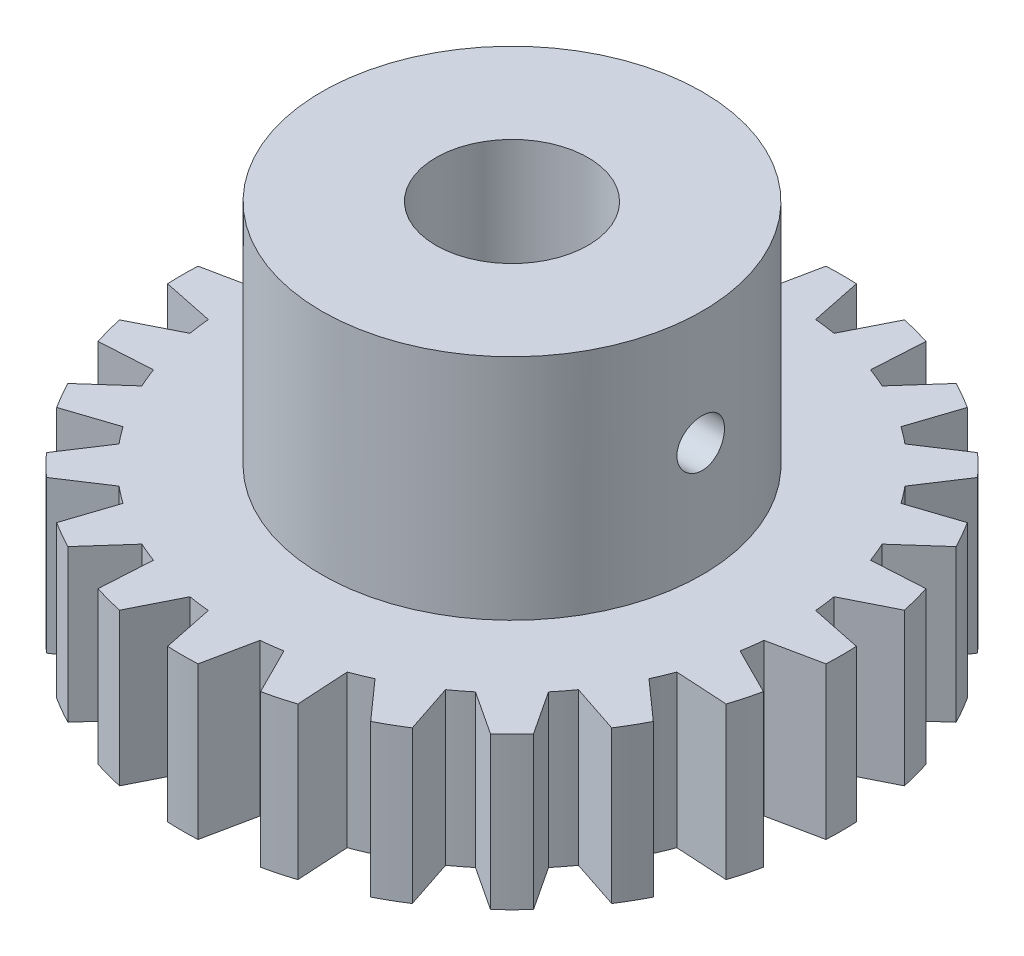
ISO-10303-21;
HEADER;
FILE_DESCRIPTION(('STEP AP214'),'2;1');
FILE_NAME('part.step','',(''),(''),'','','');
FILE_SCHEMA(('AUTOMOTIVE_DESIGN { 1 0 10303 214 1 1 1 1 }'));
ENDSEC;
DATA;
#1=APPLICATION_CONTEXT('core data for automotive mechanical design processes');
#2=APPLICATION_PROTOCOL_DEFINITION('international standard','automotive_design',2000,#1);
#3=PRODUCT_CONTEXT('',#1,'mechanical');
#4=PRODUCT('Part','Part','',(#3));
#5=PRODUCT_RELATED_PRODUCT_CATEGORY('part','',(#4));
#6=PRODUCT_DEFINITION_FORMATION('','',#4);
#7=PRODUCT_DEFINITION_CONTEXT('part definition',#1,'design');
#8=PRODUCT_DEFINITION('design','',#6,#7);
#9=PRODUCT_DEFINITION_SHAPE('','',#8);
#10=(LENGTH_UNIT() NAMED_UNIT(*) SI_UNIT(.MILLI.,.METRE.));
#11=(NAMED_UNIT(*) PLANE_ANGLE_UNIT() SI_UNIT($,.RADIAN.));
#12=(NAMED_UNIT(*) SI_UNIT($,.STERADIAN.) SOLID_ANGLE_UNIT());
#13=UNCERTAINTY_MEASURE_WITH_UNIT(LENGTH_MEASURE(1.E-05),#10,'distance_accuracy_value','');
#14=(GEOMETRIC_REPRESENTATION_CONTEXT(3) GLOBAL_UNCERTAINTY_ASSIGNED_CONTEXT((#13)) GLOBAL_UNIT_ASSIGNED_CONTEXT((#10,
#11,#12)) REPRESENTATION_CONTEXT('',''));
#15=CARTESIAN_POINT('',(0.,0.,0.));
#16=DIRECTION('',(0.,0.,1.));
#17=DIRECTION('',(1.,0.,0.));
#18=AXIS2_PLACEMENT_3D('',#15,#16,#17);
#19=CARTESIAN_POINT('',(0.,6.35,0.));
#20=DIRECTION('',(0.,-1.,0.));
#21=DIRECTION('',(0.,0.,-1.));
#22=AXIS2_PLACEMENT_3D('',#19,#20,#21);
#23=PLANE('',#22);
#24=CARTESIAN_POINT('',(0.,6.35,0.));
#25=DIRECTION('',(0.,1.,0.));
#26=DIRECTION('',(0.,0.,-1.));
#27=AXIS2_PLACEMENT_3D('',#24,#25,#26);
#28=CIRCLE('',#27,13.7541);
#29=CARTESIAN_POINT('',(0.635,6.35,-13.7394338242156));
#30=VERTEX_POINT('',#29);
#31=CARTESIAN_POINT('',(-0.635,6.35,-13.7394338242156));
#32=VERTEX_POINT('',#31);
#33=EDGE_CURVE('E856',#30,#32,#28,.T.);
#34=ORIENTED_EDGE('',*,*,#33,.T.);
#35=DIRECTION('',(-0.202446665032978,0.,0.979293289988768));
#36=VECTOR('',#35,1.);
#37=CARTESIAN_POINT('',(-0.635,6.35,-13.7394338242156));
#38=LINE('',#37,#36);
#39=CARTESIAN_POINT('',(-1.07812940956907,6.35,-11.5958882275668));
#40=VERTEX_POINT('',#39);
#41=EDGE_CURVE('E364',#32,#40,#38,.T.);
#42=ORIENTED_EDGE('',*,*,#41,.T.);
#43=CARTESIAN_POINT('',(0.,6.35,0.));
#44=DIRECTION('',(0.,1.,0.));
#45=DIRECTION('',(0.,0.,-1.));
#46=AXIS2_PLACEMENT_3D('',#43,#44,#45);
#47=CIRCLE('',#46,11.6459);
#48=CARTESIAN_POINT('',(-1.9598436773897,6.35,-11.4798083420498));
#49=VERTEX_POINT('',#48);
#50=EDGE_CURVE('E1556',#40,#49,#47,.T.);
#51=ORIENTED_EDGE('',*,*,#50,.T.);
#52=DIRECTION('',(-0.449008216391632,0.,-0.893527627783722));
#53=VECTOR('',#52,1.);
#54=CARTESIAN_POINT('',(-2.94266424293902,6.35,-13.4356240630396));
#55=LINE('',#54,#53);
#56=CARTESIAN_POINT('',(-2.94266424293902,6.35,-13.4356240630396));
#57=VERTEX_POINT('',#56);
#58=EDGE_CURVE('E1568',#49,#57,#55,.T.);
#59=ORIENTED_EDGE('',*,*,#58,.T.);
#60=CARTESIAN_POINT('',(0.,6.35,0.));
#61=DIRECTION('',(0.,1.,0.));
#62=DIRECTION('',(0.,0.,-1.));
#63=AXIS2_PLACEMENT_3D('',#60,#61,#62);
#64=CIRCLE('',#63,13.7541);
#65=CARTESIAN_POINT('',(-4.16939004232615,6.35,-13.1069238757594));
#66=VERTEX_POINT('',#65);
#67=EDGE_CURVE('E1565',#57,#66,#64,.T.);
#68=ORIENTED_EDGE('',*,*,#67,.T.);
#69=DIRECTION('',(0.0579112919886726,0.,0.998321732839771));
#70=VECTOR('',#69,1.);
#71=CARTESIAN_POINT('',(-4.16939004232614,6.35,-13.1069238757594));
#72=LINE('',#71,#70);
#73=CARTESIAN_POINT('',(-4.04262975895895,6.35,-10.9217274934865));
#74=VERTEX_POINT('',#73);
#75=EDGE_CURVE('E1567',#66,#74,#72,.T.);
#76=ORIENTED_EDGE('',*,*,#75,.T.);
#77=CARTESIAN_POINT('',(0.,6.35,0.));
#78=DIRECTION('',(0.,1.,0.));
#79=DIRECTION('',(0.,0.,-1.));
#80=AXIS2_PLACEMENT_3D('',#77,#78,#79);
#81=CIRCLE('',#80,11.6459);
#82=CARTESIAN_POINT('',(-4.86425665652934,6.35,-10.5813984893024));
#83=VERTEX_POINT('',#82);
#84=EDGE_CURVE('E1570',#74,#83,#81,.T.);
#85=ORIENTED_EDGE('',*,*,#84,.T.);
#86=DIRECTION('',(-0.664970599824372,0.,-0.746869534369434));
#87=VECTOR('',#86,1.);
#88=CARTESIAN_POINT('',(-6.31979078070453,6.35,-12.216198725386));
#89=LINE('',#88,#87);
#90=CARTESIAN_POINT('',(-6.31979078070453,6.35,-12.216198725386));
#91=VERTEX_POINT('',#90);
#92=EDGE_CURVE('E1576',#83,#91,#89,.T.);
#93=ORIENTED_EDGE('',*,*,#92,.T.);
#94=CARTESIAN_POINT('',(0.,6.35,0.));
#95=DIRECTION('',(0.,1.,0.));
#96=DIRECTION('',(0.,0.,-1.));
#97=AXIS2_PLACEMENT_3D('',#94,#95,#96);
#98=CIRCLE('',#97,13.7541);
#99=CARTESIAN_POINT('',(-7.41964304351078,6.35,-11.581198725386));
#100=VERTEX_POINT('',#99);
#101=EDGE_CURVE('E1578',#91,#100,#98,.T.);
#102=ORIENTED_EDGE('',*,*,#101,.T.);
#103=DIRECTION('',(0.314322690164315,0.,0.949316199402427));
#104=VECTOR('',#103,1.);
#105=CARTESIAN_POINT('',(-7.41964304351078,6.35,-11.581198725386));
#106=LINE('',#105,#104);
#107=CARTESIAN_POINT('',(-6.73163157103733,6.35,-9.50326907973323));
#108=VERTEX_POINT('',#107);
#109=EDGE_CURVE('E1580',#100,#108,#106,.T.);
#110=ORIENTED_EDGE('',*,*,#109,.T.);
#111=CARTESIAN_POINT('',(0.,6.35,0.));
#112=DIRECTION('',(0.,1.,0.));
#113=DIRECTION('',(0.,0.,-1.));
#114=AXIS2_PLACEMENT_3D('',#111,#112,#113);
#115=CIRCLE('',#114,11.6459);
#116=CARTESIAN_POINT('',(-7.4371785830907,6.35,-8.96188381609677));
#117=VERTEX_POINT('',#116);
#118=EDGE_CURVE('E1582',#108,#117,#115,.T.);
#119=ORIENTED_EDGE('',*,*,#118,.T.);
#120=DIRECTION('',(-0.835616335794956,0.,-0.549313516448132));
#121=VECTOR('',#120,1.);
#122=CARTESIAN_POINT('',(-9.2662340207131,6.35,-10.1642596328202));
#123=LINE('',#122,#121);
#124=CARTESIAN_POINT('',(-9.2662340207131,6.35,-10.1642596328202));
#125=VERTEX_POINT('',#124);
#126=EDGE_CURVE('E1584',#117,#125,#123,.T.);
#127=ORIENTED_EDGE('',*,*,#126,.T.);
#128=CARTESIAN_POINT('',(0.,6.35,0.));
#129=DIRECTION('',(0.,1.,0.));
#130=DIRECTION('',(0.,0.,-1.));
#131=AXIS2_PLACEMENT_3D('',#128,#129,#130);
#132=CIRCLE('',#131,13.7541);
#133=CARTESIAN_POINT('',(-10.16425963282,6.35,-9.26623402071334));
#134=VERTEX_POINT('',#133);
#135=EDGE_CURVE('E1586',#125,#134,#132,.T.);
#136=ORIENTED_EDGE('',*,*,#135,.T.);
#137=DIRECTION('',(0.54931351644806,0.,0.835616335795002));
#138=VECTOR('',#137,1.);
#139=CARTESIAN_POINT('',(-10.16425963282,6.35,-9.26623402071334));
#140=LINE('',#139,#138);
#141=CARTESIAN_POINT('',(-8.96188381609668,6.35,-7.4371785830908));
#142=VERTEX_POINT('',#141);
#143=EDGE_CURVE('E1588',#134,#142,#140,.T.);
#144=ORIENTED_EDGE('',*,*,#143,.T.);
#145=CARTESIAN_POINT('',(0.,6.35,0.));
#146=DIRECTION('',(0.,1.,0.));
#147=DIRECTION('',(0.,0.,-1.));
#148=AXIS2_PLACEMENT_3D('',#145,#146,#147);
#149=CIRCLE('',#148,11.6459);
#150=CARTESIAN_POINT('',(-9.50326907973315,6.35,-6.73163157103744));
#151=VERTEX_POINT('',#150);
#152=EDGE_CURVE('E1590',#142,#151,#149,.T.);
#153=ORIENTED_EDGE('',*,*,#152,.T.);
#154=DIRECTION('',(-0.949316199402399,0.,-0.314322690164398));
#155=VECTOR('',#154,1.);
#156=CARTESIAN_POINT('',(-11.5811987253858,6.35,-7.41964304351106));
#157=LINE('',#156,#155);
#158=CARTESIAN_POINT('',(-11.5811987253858,6.35,-7.41964304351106));
#159=VERTEX_POINT('',#158);
#160=EDGE_CURVE('E1592',#151,#159,#157,.T.);
#161=ORIENTED_EDGE('',*,*,#160,.T.);
#162=CARTESIAN_POINT('',(0.,6.35,0.));
#163=DIRECTION('',(0.,1.,0.));
#164=DIRECTION('',(0.,0.,-1.));
#165=AXIS2_PLACEMENT_3D('',#162,#163,#164);
#166=CIRCLE('',#165,13.7541);
#167=CARTESIAN_POINT('',(-12.2161987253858,6.35,-6.31979078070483));
#168=VERTEX_POINT('',#167);
#169=EDGE_CURVE('E1594',#159,#168,#166,.T.);
#170=ORIENTED_EDGE('',*,*,#169,.T.);
#171=DIRECTION('',(0.746869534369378,0.,0.664970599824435));
#172=VECTOR('',#171,1.);
#173=CARTESIAN_POINT('',(-12.2161987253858,6.35,-6.31979078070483));
#174=LINE('',#173,#172);
#175=CARTESIAN_POINT('',(-10.5813984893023,6.35,-4.86425665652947));
#176=VERTEX_POINT('',#175);
#177=EDGE_CURVE('E1596',#168,#176,#174,.T.);
#178=ORIENTED_EDGE('',*,*,#177,.T.);
#179=CARTESIAN_POINT('',(0.,6.35,0.));
#180=DIRECTION('',(0.,1.,0.));
#181=DIRECTION('',(0.,0.,-1.));
#182=AXIS2_PLACEMENT_3D('',#179,#180,#181);
#183=CIRCLE('',#182,11.6459);
#184=CARTESIAN_POINT('',(-10.9217274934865,6.35,-4.04262975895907));
#185=VERTEX_POINT('',#184);
#186=EDGE_CURVE('E1598',#176,#185,#183,.T.);
#187=ORIENTED_EDGE('',*,*,#186,.T.);
#188=DIRECTION('',(-0.998321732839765,0.,-0.0579112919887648));
#189=VECTOR('',#188,1.);
#190=CARTESIAN_POINT('',(-13.1069238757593,6.35,-4.16939004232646));
#191=LINE('',#190,#189);
#192=CARTESIAN_POINT('',(-13.1069238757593,6.35,-4.16939004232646));
#193=VERTEX_POINT('',#192);
#194=EDGE_CURVE('E1600',#185,#193,#191,.T.);
#195=ORIENTED_EDGE('',*,*,#194,.T.);
#196=CARTESIAN_POINT('',(0.,6.35,0.));
#197=DIRECTION('',(0.,1.,0.));
#198=DIRECTION('',(0.,0.,-1.));
#199=AXIS2_PLACEMENT_3D('',#196,#197,#198);
#200=CIRCLE('',#199,13.7541);
#201=CARTESIAN_POINT('',(-13.4356240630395,6.35,-2.94266424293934));
#202=VERTEX_POINT('',#201);
#203=EDGE_CURVE('E1602',#193,#202,#200,.T.);
#204=ORIENTED_EDGE('',*,*,#203,.T.);
#205=DIRECTION('',(0.893527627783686,0.,0.449008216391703));
#206=VECTOR('',#205,1.);
#207=CARTESIAN_POINT('',(-13.4356240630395,6.35,-2.94266424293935));
#208=LINE('',#207,#206);
#209=CARTESIAN_POINT('',(-11.4798083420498,6.35,-1.95984367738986));
#210=VERTEX_POINT('',#209);
#211=EDGE_CURVE('E1604',#202,#210,#208,.T.);
#212=ORIENTED_EDGE('',*,*,#211,.T.);
#213=CARTESIAN_POINT('',(0.,6.35,0.));
#214=DIRECTION('',(0.,1.,0.));
#215=DIRECTION('',(0.,0.,-1.));
#216=AXIS2_PLACEMENT_3D('',#213,#214,#215);
#217=CIRCLE('',#216,11.6459);
#218=CARTESIAN_POINT('',(-11.5958882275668,6.35,-1.07812940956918));
#219=VERTEX_POINT('',#218);
#220=EDGE_CURVE('E1606',#210,#219,#217,.T.);
#221=ORIENTED_EDGE('',*,*,#220,.T.);
#222=DIRECTION('',(-0.97929328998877,0.,0.202446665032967));
#223=VECTOR('',#222,1.);
#224=CARTESIAN_POINT('',(-13.7394338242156,6.35,-0.635000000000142));
#225=LINE('',#224,#223);
#226=CARTESIAN_POINT('',(-13.7394338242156,6.35,-0.635000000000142));
#227=VERTEX_POINT('',#226);
#228=EDGE_CURVE('E1608',#219,#227,#225,.T.);
#229=ORIENTED_EDGE('',*,*,#228,.T.);
#230=CARTESIAN_POINT('',(0.,6.35,0.));
#231=DIRECTION('',(0.,1.,0.));
#232=DIRECTION('',(0.,0.,-1.));
#233=AXIS2_PLACEMENT_3D('',#230,#231,#232);
#234=CIRCLE('',#233,13.7541);
#235=CARTESIAN_POINT('',(-13.7394338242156,6.35,0.634999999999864));
#236=VERTEX_POINT('',#235);
#237=EDGE_CURVE('E1610',#227,#236,#234,.T.);
#238=ORIENTED_EDGE('',*,*,#237,.T.);
#239=DIRECTION('',(0.979293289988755,0.,0.202446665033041));
#240=VECTOR('',#239,1.);
#241=CARTESIAN_POINT('',(-13.7394338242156,6.35,0.634999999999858));
#242=LINE('',#241,#240);
#243=CARTESIAN_POINT('',(-11.5958882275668,6.35,1.07812940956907));
#244=VERTEX_POINT('',#243);
#245=EDGE_CURVE('E1612',#236,#244,#242,.T.);
#246=ORIENTED_EDGE('',*,*,#245,.T.);
#247=CARTESIAN_POINT('',(0.,6.35,0.));
#248=DIRECTION('',(0.,1.,0.));
#249=DIRECTION('',(0.,0.,-1.));
#250=AXIS2_PLACEMENT_3D('',#247,#248,#249);
#251=CIRCLE('',#250,11.6459);
#252=CARTESIAN_POINT('',(-11.4798083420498,6.35,1.95984367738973));
#253=VERTEX_POINT('',#252);
#254=EDGE_CURVE('E1614',#244,#253,#251,.T.);
#255=ORIENTED_EDGE('',*,*,#254,.T.);
#256=DIRECTION('',(-0.89352762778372,0.,0.449008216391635));
#257=VECTOR('',#256,1.);
#258=CARTESIAN_POINT('',(-13.4356240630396,6.35,2.94266424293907));
#259=LINE('',#258,#257);
#260=CARTESIAN_POINT('',(-13.4356240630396,6.35,2.94266424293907));
#261=VERTEX_POINT('',#260);
#262=EDGE_CURVE('E1616',#253,#261,#259,.T.);
#263=ORIENTED_EDGE('',*,*,#262,.T.);
#264=CARTESIAN_POINT('',(0.,6.35,0.));
#265=DIRECTION('',(0.,1.,0.));
#266=DIRECTION('',(0.,0.,-1.));
#267=AXIS2_PLACEMENT_3D('',#264,#265,#266);
#268=CIRCLE('',#267,13.7541);
#269=CARTESIAN_POINT('',(-13.1069238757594,6.35,4.1693900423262));
#270=VERTEX_POINT('',#269);
#271=EDGE_CURVE('E1618',#261,#270,#268,.T.);
#272=ORIENTED_EDGE('',*,*,#271,.T.);
#273=DIRECTION('',(0.99832173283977,0.,-0.0579112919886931));
#274=VECTOR('',#273,1.);
#275=CARTESIAN_POINT('',(-13.1069238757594,6.35,4.16939004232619));
#276=LINE('',#275,#274);
#277=CARTESIAN_POINT('',(-10.9217274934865,6.35,4.04262975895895));
#278=VERTEX_POINT('',#277);
#279=EDGE_CURVE('E1620',#270,#278,#276,.T.);
#280=ORIENTED_EDGE('',*,*,#279,.T.);
#281=CARTESIAN_POINT('',(0.,6.35,0.));
#282=DIRECTION('',(0.,1.,0.));
#283=DIRECTION('',(0.,0.,-1.));
#284=AXIS2_PLACEMENT_3D('',#281,#282,#283);
#285=CIRCLE('',#284,11.6459);
#286=CARTESIAN_POINT('',(-10.5813984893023,6.35,4.86425665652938));
#287=VERTEX_POINT('',#286);
#288=EDGE_CURVE('E1622',#278,#287,#285,.T.);
#289=ORIENTED_EDGE('',*,*,#288,.T.);
#290=DIRECTION('',(-0.746869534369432,0.,0.664970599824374));
#291=VECTOR('',#290,1.);
#292=CARTESIAN_POINT('',(-12.216198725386,6.35,6.31979078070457));
#293=LINE('',#292,#291);
#294=CARTESIAN_POINT('',(-12.216198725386,6.35,6.31979078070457));
#295=VERTEX_POINT('',#294);
#296=EDGE_CURVE('E1624',#287,#295,#293,.T.);
#297=ORIENTED_EDGE('',*,*,#296,.T.);
#298=CARTESIAN_POINT('',(0.,6.35,0.));
#299=DIRECTION('',(0.,1.,0.));
#300=DIRECTION('',(0.,0.,-1.));
#301=AXIS2_PLACEMENT_3D('',#298,#299,#300);
#302=CIRCLE('',#301,13.7541);
#303=CARTESIAN_POINT('',(-11.581198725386,6.35,7.41964304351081));
#304=VERTEX_POINT('',#303);
#305=EDGE_CURVE('E1626',#295,#304,#302,.T.);
#306=ORIENTED_EDGE('',*,*,#305,.T.);
#307=DIRECTION('',(0.949316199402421,0.,-0.314322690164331));
#308=VECTOR('',#307,1.);
#309=CARTESIAN_POINT('',(-11.581198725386,6.35,7.41964304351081));
#310=LINE('',#309,#308);
#311=CARTESIAN_POINT('',(-9.50326907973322,6.35,6.73163157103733));
#312=VERTEX_POINT('',#311);
#313=EDGE_CURVE('E1628',#304,#312,#310,.T.);
#314=ORIENTED_EDGE('',*,*,#313,.T.);
#315=CARTESIAN_POINT('',(0.,6.35,0.));
#316=DIRECTION('',(0.,1.,0.));
#317=DIRECTION('',(0.,0.,-1.));
#318=AXIS2_PLACEMENT_3D('',#315,#316,#317);
#319=CIRCLE('',#318,11.6459);
#320=CARTESIAN_POINT('',(-8.96188381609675,6.35,7.43717858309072));
#321=VERTEX_POINT('',#320);
#322=EDGE_CURVE('E1630',#312,#321,#319,.T.);
#323=ORIENTED_EDGE('',*,*,#322,.T.);
#324=DIRECTION('',(-0.54931351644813,0.,0.835616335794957));
#325=VECTOR('',#324,1.);
#326=CARTESIAN_POINT('',(-10.1642596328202,6.35,9.26623402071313));
#327=LINE('',#326,#325);
#328=CARTESIAN_POINT('',(-10.1642596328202,6.35,9.26623402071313));
#329=VERTEX_POINT('',#328);
#330=EDGE_CURVE('E1632',#321,#329,#327,.T.);
#331=ORIENTED_EDGE('',*,*,#330,.T.);
#332=CARTESIAN_POINT('',(0.,6.35,0.));
#333=DIRECTION('',(0.,1.,0.));
#334=DIRECTION('',(0.,0.,-1.));
#335=AXIS2_PLACEMENT_3D('',#332,#333,#334);
#336=CIRCLE('',#335,13.7541);
#337=CARTESIAN_POINT('',(-9.26623402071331,6.35,10.1642596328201));
#338=VERTEX_POINT('',#337);
#339=EDGE_CURVE('E1634',#329,#338,#336,.T.);
#340=ORIENTED_EDGE('',*,*,#339,.T.);
#341=DIRECTION('',(0.835616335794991,0.,-0.549313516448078));
#342=VECTOR('',#341,1.);
#343=CARTESIAN_POINT('',(-9.26623402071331,6.35,10.1642596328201));
#344=LINE('',#343,#342);
#345=CARTESIAN_POINT('',(-7.4371785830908,6.35,8.96188381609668));
#346=VERTEX_POINT('',#345);
#347=EDGE_CURVE('E1636',#338,#346,#344,.T.);
#348=ORIENTED_EDGE('',*,*,#347,.T.);
#349=CARTESIAN_POINT('',(0.,6.35,0.));
#350=DIRECTION('',(0.,1.,0.));
#351=DIRECTION('',(0.,0.,-1.));
#352=AXIS2_PLACEMENT_3D('',#349,#350,#351);
#353=CIRCLE('',#352,11.6459);
#354=CARTESIAN_POINT('',(-6.73163157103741,6.35,9.50326907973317));
#355=VERTEX_POINT('',#354);
#356=EDGE_CURVE('E1638',#346,#355,#353,.T.);
#357=ORIENTED_EDGE('',*,*,#356,.T.);
#358=DIRECTION('',(-0.314322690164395,0.,0.9493161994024));
#359=VECTOR('',#358,1.);
#360=CARTESIAN_POINT('',(-7.41964304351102,6.35,11.5811987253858));
#361=LINE('',#360,#359);
#362=CARTESIAN_POINT('',(-7.41964304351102,6.35,11.5811987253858));
#363=VERTEX_POINT('',#362);
#364=EDGE_CURVE('E1640',#355,#363,#361,.T.);
#365=ORIENTED_EDGE('',*,*,#364,.T.);
#366=CARTESIAN_POINT('',(0.,6.35,0.));
#367=DIRECTION('',(0.,1.,0.));
#368=DIRECTION('',(0.,0.,-1.));
#369=AXIS2_PLACEMENT_3D('',#366,#367,#368);
#370=CIRCLE('',#369,13.7541);
#371=CARTESIAN_POINT('',(-6.31979078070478,6.35,12.2161987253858));
#372=VERTEX_POINT('',#371);
#373=EDGE_CURVE('E1642',#363,#372,#370,.T.);
#374=ORIENTED_EDGE('',*,*,#373,.T.);
#375=DIRECTION('',(0.664970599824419,0.,-0.746869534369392));
#376=VECTOR('',#375,1.);
#377=CARTESIAN_POINT('',(-6.31979078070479,6.35,12.2161987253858));
#378=LINE('',#377,#376);
#379=CARTESIAN_POINT('',(-4.86425665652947,6.35,10.5813984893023));
#380=VERTEX_POINT('',#379);
#381=EDGE_CURVE('E1644',#372,#380,#378,.T.);
#382=ORIENTED_EDGE('',*,*,#381,.T.);
#383=CARTESIAN_POINT('',(0.,6.35,0.));
#384=DIRECTION('',(0.,1.,0.));
#385=DIRECTION('',(0.,0.,-1.));
#386=AXIS2_PLACEMENT_3D('',#383,#384,#385);
#387=CIRCLE('',#386,11.6459);
#388=CARTESIAN_POINT('',(-4.04262975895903,6.35,10.9217274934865));
#389=VERTEX_POINT('',#388);
#390=EDGE_CURVE('E1646',#380,#389,#387,.T.);
#391=ORIENTED_EDGE('',*,*,#390,.T.);
#392=DIRECTION('',(-0.0579112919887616,0.,0.998321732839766));
#393=VECTOR('',#392,1.);
#394=CARTESIAN_POINT('',(-4.16939004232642,6.35,13.1069238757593));
#395=LINE('',#394,#393);
#396=CARTESIAN_POINT('',(-4.16939004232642,6.35,13.1069238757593));
#397=VERTEX_POINT('',#396);
#398=EDGE_CURVE('E1648',#389,#397,#395,.T.);
#399=ORIENTED_EDGE('',*,*,#398,.T.);
#400=CARTESIAN_POINT('',(0.,6.35,0.));
#401=DIRECTION('',(0.,1.,0.));
#402=DIRECTION('',(0.,0.,-1.));
#403=AXIS2_PLACEMENT_3D('',#400,#401,#402);
#404=CIRCLE('',#403,13.7541);
#405=CARTESIAN_POINT('',(-2.9426642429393,6.35,13.4356240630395));
#406=VERTEX_POINT('',#405);
#407=EDGE_CURVE('E1650',#397,#406,#404,.T.);
#408=ORIENTED_EDGE('',*,*,#407,.T.);
#409=DIRECTION('',(0.449008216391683,0.,-0.893527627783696));
#410=VECTOR('',#409,1.);
#411=CARTESIAN_POINT('',(-2.9426642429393,6.35,13.4356240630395));
#412=LINE('',#411,#410);
#413=CARTESIAN_POINT('',(-1.95984367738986,6.35,11.4798083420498));
#414=VERTEX_POINT('',#413);
#415=EDGE_CURVE('E1652',#406,#414,#412,.T.);
#416=ORIENTED_EDGE('',*,*,#415,.T.);
#417=CARTESIAN_POINT('',(0.,6.35,0.));
#418=DIRECTION('',(0.,1.,0.));
#419=DIRECTION('',(0.,0.,-1.));
#420=AXIS2_PLACEMENT_3D('',#417,#418,#419);
#421=CIRCLE('',#420,11.6459);
#422=CARTESIAN_POINT('',(-1.07812940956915,6.35,11.5958882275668));
#423=VERTEX_POINT('',#422);
#424=EDGE_CURVE('E1654',#414,#423,#421,.T.);
#425=ORIENTED_EDGE('',*,*,#424,.T.);
#426=DIRECTION('',(0.202446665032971,0.,0.97929328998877));
#427=VECTOR('',#426,1.);
#428=CARTESIAN_POINT('',(-0.635000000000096,6.35,13.7394338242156));
#429=LINE('',#428,#427);
#430=CARTESIAN_POINT('',(-0.635000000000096,6.35,13.7394338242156));
#431=VERTEX_POINT('',#430);
#432=EDGE_CURVE('E1656',#423,#431,#429,.T.);
#433=ORIENTED_EDGE('',*,*,#432,.T.);
#434=CARTESIAN_POINT('',(0.,6.35,0.));
#435=DIRECTION('',(0.,1.,0.));
#436=DIRECTION('',(0.,0.,-1.));
#437=AXIS2_PLACEMENT_3D('',#434,#435,#436);
#438=CIRCLE('',#437,13.7541);
#439=CARTESIAN_POINT('',(0.634999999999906,6.35,13.7394338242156));
#440=VERTEX_POINT('',#439);
#441=EDGE_CURVE('E1658',#431,#440,#438,.T.);
#442=ORIENTED_EDGE('',*,*,#441,.T.);
#443=DIRECTION('',(0.202446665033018,0.,-0.97929328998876));
#444=VECTOR('',#443,1.);
#445=CARTESIAN_POINT('',(0.634999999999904,6.35,13.7394338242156));
#446=LINE('',#445,#444);
#447=CARTESIAN_POINT('',(1.07812940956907,6.35,11.5958882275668));
#448=VERTEX_POINT('',#447);
#449=EDGE_CURVE('E1660',#440,#448,#446,.T.);
#450=ORIENTED_EDGE('',*,*,#449,.T.);
#451=CARTESIAN_POINT('',(0.,6.35,0.));
#452=DIRECTION('',(0.,1.,0.));
#453=DIRECTION('',(0.,0.,-1.));
#454=AXIS2_PLACEMENT_3D('',#451,#452,#453);
#455=CIRCLE('',#454,11.6459);
#456=CARTESIAN_POINT('',(1.95984367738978,6.35,11.4798083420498));
#457=VERTEX_POINT('',#456);
#458=EDGE_CURVE('E1662',#448,#457,#455,.T.);
#459=ORIENTED_EDGE('',*,*,#458,.T.);
#460=DIRECTION('',(0.449008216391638,0.,0.893527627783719));
#461=VECTOR('',#460,1.);
#462=CARTESIAN_POINT('',(2.94266424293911,6.35,13.4356240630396));
#463=LINE('',#462,#461);
#464=CARTESIAN_POINT('',(2.94266424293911,6.35,13.4356240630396));
#465=VERTEX_POINT('',#464);
#466=EDGE_CURVE('E1664',#457,#465,#463,.T.);
#467=ORIENTED_EDGE('',*,*,#466,.T.);
#468=CARTESIAN_POINT('',(0.,6.35,0.));
#469=DIRECTION('',(0.,1.,0.));
#470=DIRECTION('',(0.,0.,-1.));
#471=AXIS2_PLACEMENT_3D('',#468,#469,#470);
#472=CIRCLE('',#471,13.7541);
#473=CARTESIAN_POINT('',(4.16939004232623,6.35,13.1069238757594));
#474=VERTEX_POINT('',#473);
#475=EDGE_CURVE('E1666',#465,#474,#472,.T.);
#476=ORIENTED_EDGE('',*,*,#475,.T.);
#477=DIRECTION('',(-0.0579112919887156,0.,-0.998321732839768));
#478=VECTOR('',#477,1.);
#479=CARTESIAN_POINT('',(4.16939004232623,6.35,13.1069238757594));
#480=LINE('',#479,#478);
#481=CARTESIAN_POINT('',(4.04262975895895,6.35,10.9217274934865));
#482=VERTEX_POINT('',#481);
#483=EDGE_CURVE('E1668',#474,#482,#480,.T.);
#484=ORIENTED_EDGE('',*,*,#483,.T.);
#485=CARTESIAN_POINT('',(0.,6.35,0.));
#486=DIRECTION('',(0.,1.,0.));
#487=DIRECTION('',(0.,0.,-1.));
#488=AXIS2_PLACEMENT_3D('',#485,#486,#487);
#489=CIRCLE('',#488,11.6459);
#490=CARTESIAN_POINT('',(4.8642566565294,6.35,10.5813984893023));
#491=VERTEX_POINT('',#490);
#492=EDGE_CURVE('E1670',#482,#491,#489,.T.);
#493=ORIENTED_EDGE('',*,*,#492,.T.);
#494=DIRECTION('',(0.664970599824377,0.,0.746869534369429));
#495=VECTOR('',#494,1.);
#496=CARTESIAN_POINT('',(6.31979078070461,6.35,12.2161987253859));
#497=LINE('',#496,#495);
#498=CARTESIAN_POINT('',(6.31979078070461,6.35,12.2161987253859));
#499=VERTEX_POINT('',#498);
#500=EDGE_CURVE('E1672',#491,#499,#497,.T.);
#501=ORIENTED_EDGE('',*,*,#500,.T.);
#502=CARTESIAN_POINT('',(0.,6.35,0.));
#503=DIRECTION('',(0.,1.,0.));
#504=DIRECTION('',(0.,0.,-1.));
#505=AXIS2_PLACEMENT_3D('',#502,#503,#504);
#506=CIRCLE('',#505,13.7541);
#507=CARTESIAN_POINT('',(7.41964304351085,6.35,11.5811987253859));
#508=VERTEX_POINT('',#507);
#509=EDGE_CURVE('E1674',#499,#508,#506,.T.);
#510=ORIENTED_EDGE('',*,*,#509,.T.);
#511=DIRECTION('',(-0.314322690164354,0.,-0.949316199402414));
#512=VECTOR('',#511,1.);
#513=CARTESIAN_POINT('',(7.41964304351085,6.35,11.5811987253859));
#514=LINE('',#513,#512);
#515=CARTESIAN_POINT('',(6.73163157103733,6.35,9.50326907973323));
#516=VERTEX_POINT('',#515);
#517=EDGE_CURVE('E1676',#508,#516,#514,.T.);
#518=ORIENTED_EDGE('',*,*,#517,.T.);
#519=CARTESIAN_POINT('',(0.,6.35,0.));
#520=DIRECTION('',(0.,1.,0.));
#521=DIRECTION('',(0.,0.,-1.));
#522=AXIS2_PLACEMENT_3D('',#519,#520,#521);
#523=CIRCLE('',#522,11.6459);
#524=CARTESIAN_POINT('',(7.43717858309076,6.35,8.96188381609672));
#525=VERTEX_POINT('',#524);
#526=EDGE_CURVE('E1678',#516,#525,#523,.T.);
#527=ORIENTED_EDGE('',*,*,#526,.T.);
#528=DIRECTION('',(0.835616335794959,0.,0.549313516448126));
#529=VECTOR('',#528,1.);
#530=CARTESIAN_POINT('',(9.26623402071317,6.35,10.1642596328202));
#531=LINE('',#530,#529);
#532=CARTESIAN_POINT('',(9.26623402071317,6.35,10.1642596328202));
#533=VERTEX_POINT('',#532);
#534=EDGE_CURVE('E1680',#525,#533,#531,.T.);
#535=ORIENTED_EDGE('',*,*,#534,.T.);
#536=CARTESIAN_POINT('',(0.,6.35,0.));
#537=DIRECTION('',(0.,1.,0.));
#538=DIRECTION('',(0.,0.,-1.));
#539=AXIS2_PLACEMENT_3D('',#536,#537,#538);
#540=CIRCLE('',#539,13.7541);
#541=CARTESIAN_POINT('',(10.1642596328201,6.35,9.26623402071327));
#542=VERTEX_POINT('',#541);
#543=EDGE_CURVE('E1682',#533,#542,#540,.T.);
#544=ORIENTED_EDGE('',*,*,#543,.T.);
#545=DIRECTION('',(-0.549313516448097,0.,-0.835616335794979));
#546=VECTOR('',#545,1.);
#547=CARTESIAN_POINT('',(10.1642596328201,6.35,9.26623402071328));
#548=LINE('',#547,#546);
#549=CARTESIAN_POINT('',(8.96188381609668,6.35,7.43717858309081));
#550=VERTEX_POINT('',#549);
#551=EDGE_CURVE('E1684',#542,#550,#548,.T.);
#552=ORIENTED_EDGE('',*,*,#551,.T.);
#553=CARTESIAN_POINT('',(0.,6.35,0.));
#554=DIRECTION('',(0.,1.,0.));
#555=DIRECTION('',(0.,0.,-1.));
#556=AXIS2_PLACEMENT_3D('',#553,#554,#555);
#557=CIRCLE('',#556,11.6459);
#558=CARTESIAN_POINT('',(9.50326907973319,6.35,6.73163157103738));
#559=VERTEX_POINT('',#558);
#560=EDGE_CURVE('E1686',#550,#559,#557,.T.);
#561=ORIENTED_EDGE('',*,*,#560,.T.);
#562=DIRECTION('',(0.949316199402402,0.,0.314322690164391));
#563=VECTOR('',#562,1.);
#564=CARTESIAN_POINT('',(11.5811987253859,6.35,7.41964304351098));
#565=LINE('',#564,#563);
#566=CARTESIAN_POINT('',(11.5811987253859,6.35,7.41964304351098));
#567=VERTEX_POINT('',#566);
#568=EDGE_CURVE('E1688',#559,#567,#565,.T.);
#569=ORIENTED_EDGE('',*,*,#568,.T.);
#570=CARTESIAN_POINT('',(0.,6.35,0.));
#571=DIRECTION('',(0.,1.,0.));
#572=DIRECTION('',(0.,0.,-1.));
#573=AXIS2_PLACEMENT_3D('',#570,#571,#572);
#574=CIRCLE('',#573,13.7541);
#575=CARTESIAN_POINT('',(12.2161987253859,6.35,6.31979078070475));
#576=VERTEX_POINT('',#575);
#577=EDGE_CURVE('E1690',#567,#576,#574,.T.);
#578=ORIENTED_EDGE('',*,*,#577,.T.);
#579=DIRECTION('',(-0.746869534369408,0.,-0.664970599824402));
#580=VECTOR('',#579,1.);
#581=CARTESIAN_POINT('',(12.2161987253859,6.35,6.31979078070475));
#582=LINE('',#581,#580);
#583=CARTESIAN_POINT('',(10.5813984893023,6.35,4.86425665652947));
#584=VERTEX_POINT('',#583);
#585=EDGE_CURVE('E1692',#576,#584,#582,.T.);
#586=ORIENTED_EDGE('',*,*,#585,.T.);
#587=CARTESIAN_POINT('',(0.,6.35,0.));
#588=DIRECTION('',(0.,1.,0.));
#589=DIRECTION('',(0.,0.,-1.));
#590=AXIS2_PLACEMENT_3D('',#587,#588,#589);
#591=CIRCLE('',#590,11.6459);
#592=CARTESIAN_POINT('',(10.9217274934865,6.35,4.042629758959));
#593=VERTEX_POINT('',#592);
#594=EDGE_CURVE('E1694',#584,#593,#591,.T.);
#595=ORIENTED_EDGE('',*,*,#594,.T.);
#596=DIRECTION('',(0.998321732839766,0.,0.057911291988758));
#597=VECTOR('',#596,1.);
#598=CARTESIAN_POINT('',(13.1069238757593,6.35,4.16939004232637));
#599=LINE('',#598,#597);
#600=CARTESIAN_POINT('',(13.1069238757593,6.35,4.16939004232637));
#601=VERTEX_POINT('',#600);
#602=EDGE_CURVE('E1696',#593,#601,#599,.T.);
#603=ORIENTED_EDGE('',*,*,#602,.T.);
#604=CARTESIAN_POINT('',(0.,6.35,0.));
#605=DIRECTION('',(0.,1.,0.));
#606=DIRECTION('',(0.,0.,-1.));
#607=AXIS2_PLACEMENT_3D('',#604,#605,#606);
#608=CIRCLE('',#607,13.7541);
#609=CARTESIAN_POINT('',(13.4356240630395,6.35,2.94266424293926));
#610=VERTEX_POINT('',#609);
#611=EDGE_CURVE('E1698',#601,#610,#608,.T.);
#612=ORIENTED_EDGE('',*,*,#611,.T.);
#613=DIRECTION('',(-0.893527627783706,0.,-0.449008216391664));
#614=VECTOR('',#613,1.);
#615=CARTESIAN_POINT('',(13.4356240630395,6.35,2.94266424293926));
#616=LINE('',#615,#614);
#617=CARTESIAN_POINT('',(11.4798083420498,6.35,1.95984367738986));
#618=VERTEX_POINT('',#617);
#619=EDGE_CURVE('E1700',#610,#618,#616,.T.);
#620=ORIENTED_EDGE('',*,*,#619,.T.);
#621=CARTESIAN_POINT('',(0.,6.35,0.));
#622=DIRECTION('',(0.,1.,0.));
#623=DIRECTION('',(0.,0.,-1.));
#624=AXIS2_PLACEMENT_3D('',#621,#622,#623);
#625=CIRCLE('',#624,11.6459);
#626=CARTESIAN_POINT('',(11.5958882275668,6.35,1.07812940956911));
#627=VERTEX_POINT('',#626);
#628=EDGE_CURVE('E1702',#618,#627,#625,.T.);
#629=ORIENTED_EDGE('',*,*,#628,.T.);
#630=DIRECTION('',(0.979293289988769,0.,-0.202446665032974));
#631=VECTOR('',#630,1.);
#632=CARTESIAN_POINT('',(13.7394338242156,6.35,0.635000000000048));
#633=LINE('',#632,#631);
#634=CARTESIAN_POINT('',(13.7394338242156,6.35,0.635000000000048));
#635=VERTEX_POINT('',#634);
#636=EDGE_CURVE('E1704',#627,#635,#633,.T.);
#637=ORIENTED_EDGE('',*,*,#636,.T.);
#638=CARTESIAN_POINT('',(0.,6.35,0.));
#639=DIRECTION('',(0.,1.,0.));
#640=DIRECTION('',(0.,0.,-1.));
#641=AXIS2_PLACEMENT_3D('',#638,#639,#640);
#642=CIRCLE('',#641,13.7541);
#643=CARTESIAN_POINT('',(13.7394338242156,6.35,-0.634999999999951));
#644=VERTEX_POINT('',#643);
#645=EDGE_CURVE('E1706',#635,#644,#642,.T.);
#646=ORIENTED_EDGE('',*,*,#645,.T.);
#647=DIRECTION('',(-0.979293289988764,0.,-0.202446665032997));
#648=VECTOR('',#647,1.);
#649=CARTESIAN_POINT('',(13.7394338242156,6.35,-0.634999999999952));
#650=LINE('',#649,#648);
#651=CARTESIAN_POINT('',(11.5958882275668,6.35,-1.07812940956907));
#652=VERTEX_POINT('',#651);
#653=EDGE_CURVE('E1708',#644,#652,#650,.T.);
#654=ORIENTED_EDGE('',*,*,#653,.T.);
#655=CARTESIAN_POINT('',(0.,6.35,0.));
#656=DIRECTION('',(0.,1.,0.));
#657=DIRECTION('',(0.,0.,-1.));
#658=AXIS2_PLACEMENT_3D('',#655,#656,#657);
#659=CIRCLE('',#658,11.6459);
#660=CARTESIAN_POINT('',(11.4798083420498,6.35,-1.95984367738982));
#661=VERTEX_POINT('',#660);
#662=EDGE_CURVE('E1710',#652,#661,#659,.T.);
#663=ORIENTED_EDGE('',*,*,#662,.T.);
#664=DIRECTION('',(0.893527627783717,0.,-0.449008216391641));
#665=VECTOR('',#664,1.);
#666=CARTESIAN_POINT('',(13.4356240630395,6.35,-2.94266424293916));
#667=LINE('',#666,#665);
#668=CARTESIAN_POINT('',(13.4356240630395,6.35,-2.94266424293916));
#669=VERTEX_POINT('',#668);
#670=EDGE_CURVE('E1712',#661,#669,#667,.T.);
#671=ORIENTED_EDGE('',*,*,#670,.T.);
#672=CARTESIAN_POINT('',(0.,6.35,0.));
#673=DIRECTION('',(0.,1.,0.));
#674=DIRECTION('',(0.,0.,-1.));
#675=AXIS2_PLACEMENT_3D('',#672,#673,#674);
#676=CIRCLE('',#675,13.7541);
#677=CARTESIAN_POINT('',(13.1069238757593,6.35,-4.16939004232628));
#678=VERTEX_POINT('',#677);
#679=EDGE_CURVE('E1714',#669,#678,#676,.T.);
#680=ORIENTED_EDGE('',*,*,#679,.T.);
#681=DIRECTION('',(-0.998321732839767,0.,0.0579112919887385));
#682=VECTOR('',#681,1.);
#683=CARTESIAN_POINT('',(13.1069238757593,6.35,-4.16939004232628));
#684=LINE('',#683,#682);
#685=CARTESIAN_POINT('',(10.9217274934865,6.35,-4.04262975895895));
#686=VERTEX_POINT('',#685);
#687=EDGE_CURVE('E1716',#678,#686,#684,.T.);
#688=ORIENTED_EDGE('',*,*,#687,.T.);
#689=CARTESIAN_POINT('',(0.,6.35,0.));
#690=DIRECTION('',(0.,1.,0.));
#691=DIRECTION('',(0.,0.,-1.));
#692=AXIS2_PLACEMENT_3D('',#689,#690,#691);
#693=CIRCLE('',#692,11.6459);
#694=CARTESIAN_POINT('',(10.5813984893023,6.35,-4.86425665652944));
#695=VERTEX_POINT('',#694);
#696=EDGE_CURVE('E1718',#686,#695,#693,.T.);
#697=ORIENTED_EDGE('',*,*,#696,.T.);
#698=DIRECTION('',(0.746869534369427,0.,-0.66497059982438));
#699=VECTOR('',#698,1.);
#700=CARTESIAN_POINT('',(12.2161987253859,6.35,-6.31979078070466));
#701=LINE('',#700,#699);
#702=CARTESIAN_POINT('',(12.2161987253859,6.35,-6.31979078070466));
#703=VERTEX_POINT('',#702);
#704=EDGE_CURVE('E1720',#695,#703,#701,.T.);
#705=ORIENTED_EDGE('',*,*,#704,.T.);
#706=CARTESIAN_POINT('',(0.,6.35,0.));
#707=DIRECTION('',(0.,1.,0.));
#708=DIRECTION('',(0.,0.,-1.));
#709=AXIS2_PLACEMENT_3D('',#706,#707,#708);
#710=CIRCLE('',#709,13.7541);
#711=CARTESIAN_POINT('',(11.5811987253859,6.35,-7.41964304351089));
#712=VERTEX_POINT('',#711);
#713=EDGE_CURVE('E1722',#703,#712,#710,.T.);
#714=ORIENTED_EDGE('',*,*,#713,.T.);
#715=DIRECTION('',(-0.949316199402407,0.,0.314322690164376));
#716=VECTOR('',#715,1.);
#717=CARTESIAN_POINT('',(11.5811987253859,6.35,-7.4196430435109));
#718=LINE('',#717,#716);
#719=CARTESIAN_POINT('',(9.50326907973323,6.35,-6.73163157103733));
#720=VERTEX_POINT('',#719);
#721=EDGE_CURVE('E1724',#712,#720,#718,.T.);
#722=ORIENTED_EDGE('',*,*,#721,.T.);
#723=CARTESIAN_POINT('',(0.,6.35,0.));
#724=DIRECTION('',(0.,1.,0.));
#725=DIRECTION('',(0.,0.,-1.));
#726=AXIS2_PLACEMENT_3D('',#723,#724,#725);
#727=CIRCLE('',#726,11.6459);
#728=CARTESIAN_POINT('',(8.96188381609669,6.35,-7.43717858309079));
#729=VERTEX_POINT('',#728);
#730=EDGE_CURVE('E1726',#720,#729,#727,.T.);
#731=ORIENTED_EDGE('',*,*,#730,.T.);
#732=DIRECTION('',(0.549313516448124,0.,-0.835616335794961));
#733=VECTOR('',#732,1.);
#734=CARTESIAN_POINT('',(10.1642596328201,6.35,-9.2662340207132));
#735=LINE('',#734,#733);
#736=CARTESIAN_POINT('',(10.1642596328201,6.35,-9.2662340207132));
#737=VERTEX_POINT('',#736);
#738=EDGE_CURVE('E1728',#729,#737,#735,.T.);
#739=ORIENTED_EDGE('',*,*,#738,.T.);
#740=CARTESIAN_POINT('',(0.,6.35,0.));
#741=DIRECTION('',(0.,1.,0.));
#742=DIRECTION('',(0.,0.,-1.));
#743=AXIS2_PLACEMENT_3D('',#740,#741,#742);
#744=CIRCLE('',#743,13.7541);
#745=CARTESIAN_POINT('',(9.26623402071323,6.35,-10.1642596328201));
#746=VERTEX_POINT('',#745);
#747=EDGE_CURVE('E1730',#737,#746,#744,.T.);
#748=ORIENTED_EDGE('',*,*,#747,.T.);
#749=DIRECTION('',(-0.835616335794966,0.,0.549313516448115));
#750=VECTOR('',#749,1.);
#751=CARTESIAN_POINT('',(9.26623402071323,6.35,-10.1642596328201));
#752=LINE('',#751,#750);
#753=CARTESIAN_POINT('',(7.43717858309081,6.35,-8.96188381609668));
#754=VERTEX_POINT('',#753);
#755=EDGE_CURVE('E1732',#746,#754,#752,.T.);
#756=ORIENTED_EDGE('',*,*,#755,.T.);
#757=CARTESIAN_POINT('',(0.,6.35,0.));
#758=DIRECTION('',(0.,1.,0.));
#759=DIRECTION('',(0.,0.,-1.));
#760=AXIS2_PLACEMENT_3D('',#757,#758,#759);
#761=CIRCLE('',#760,11.6459);
#762=CARTESIAN_POINT('',(6.73163157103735,6.35,-9.50326907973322));
#763=VERTEX_POINT('',#762);
#764=EDGE_CURVE('E1734',#754,#763,#761,.T.);
#765=ORIENTED_EDGE('',*,*,#764,.T.);
#766=DIRECTION('',(0.314322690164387,0.,-0.949316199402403));
#767=VECTOR('',#766,1.);
#768=CARTESIAN_POINT('',(7.41964304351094,6.35,-11.5811987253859));
#769=LINE('',#768,#767);
#770=CARTESIAN_POINT('',(7.41964304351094,6.35,-11.5811987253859));
#771=VERTEX_POINT('',#770);
#772=EDGE_CURVE('E1736',#763,#771,#769,.T.);
#773=ORIENTED_EDGE('',*,*,#772,.T.);
#774=CARTESIAN_POINT('',(0.,6.35,0.));
#775=DIRECTION('',(0.,1.,0.));
#776=DIRECTION('',(0.,0.,-1.));
#777=AXIS2_PLACEMENT_3D('',#774,#775,#776);
#778=CIRCLE('',#777,13.7541);
#779=CARTESIAN_POINT('',(6.3197907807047,6.35,-12.2161987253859));
#780=VERTEX_POINT('',#779);
#781=EDGE_CURVE('E1738',#771,#780,#778,.T.);
#782=ORIENTED_EDGE('',*,*,#781,.T.);
#783=DIRECTION('',(-0.664970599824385,0.,0.746869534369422));
#784=VECTOR('',#783,1.);
#785=CARTESIAN_POINT('',(6.3197907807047,6.35,-12.2161987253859));
#786=LINE('',#785,#784);
#787=CARTESIAN_POINT('',(4.86425665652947,6.35,-10.5813984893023));
#788=VERTEX_POINT('',#787);
#789=EDGE_CURVE('E1740',#780,#788,#786,.T.);
#790=ORIENTED_EDGE('',*,*,#789,.T.);
#791=CARTESIAN_POINT('',(0.,6.35,0.));
#792=DIRECTION('',(0.,1.,0.));
#793=DIRECTION('',(0.,0.,-1.));
#794=AXIS2_PLACEMENT_3D('',#791,#792,#793);
#795=CIRCLE('',#794,11.6459);
#796=CARTESIAN_POINT('',(4.04262975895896,6.35,-10.9217274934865));
#797=VERTEX_POINT('',#796);
#798=EDGE_CURVE('E1742',#788,#797,#795,.T.);
#799=ORIENTED_EDGE('',*,*,#798,.T.);
#800=DIRECTION('',(0.0579112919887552,0.,-0.998321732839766));
#801=VECTOR('',#800,1.);
#802=CARTESIAN_POINT('',(4.16939004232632,6.35,-13.1069238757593));
#803=LINE('',#802,#801);
#804=CARTESIAN_POINT('',(4.16939004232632,6.35,-13.1069238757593));
#805=VERTEX_POINT('',#804);
#806=EDGE_CURVE('E1744',#797,#805,#803,.T.);
#807=ORIENTED_EDGE('',*,*,#806,.T.);
#808=CARTESIAN_POINT('',(0.,6.35,0.));
#809=DIRECTION('',(0.,1.,0.));
#810=DIRECTION('',(0.,0.,-1.));
#811=AXIS2_PLACEMENT_3D('',#808,#809,#810);
#812=CIRCLE('',#811,13.7541);
#813=CARTESIAN_POINT('',(2.94266424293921,6.35,-13.4356240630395));
#814=VERTEX_POINT('',#813);
#815=EDGE_CURVE('E647',#805,#814,#812,.T.);
#816=ORIENTED_EDGE('',*,*,#815,.T.);
#817=DIRECTION('',(-0.449008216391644,0.,0.893527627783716));
#818=VECTOR('',#817,1.);
#819=CARTESIAN_POINT('',(2.94266424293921,6.35,-13.4356240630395));
#820=LINE('',#819,#818);
#821=CARTESIAN_POINT('',(1.95984367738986,6.35,-11.4798083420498));
#822=VERTEX_POINT('',#821);
#823=EDGE_CURVE('E641',#814,#822,#820,.T.);
#824=ORIENTED_EDGE('',*,*,#823,.T.);
#825=CARTESIAN_POINT('',(0.,6.35,0.));
#826=DIRECTION('',(0.,1.,0.));
#827=DIRECTION('',(0.,0.,-1.));
#828=AXIS2_PLACEMENT_3D('',#825,#826,#827);
#829=CIRCLE('',#828,11.6459);
#830=CARTESIAN_POINT('',(1.07812940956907,6.35,-11.5958882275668));
#831=VERTEX_POINT('',#830);
#832=EDGE_CURVE('E645',#822,#831,#829,.T.);
#833=ORIENTED_EDGE('',*,*,#832,.T.);
#834=DIRECTION('',(-0.202446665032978,0.,-0.979293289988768));
#835=VECTOR('',#834,1.);
#836=CARTESIAN_POINT('',(0.635,6.35,-13.7394338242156));
#837=LINE('',#836,#835);
#838=EDGE_CURVE('E56',#831,#30,#837,.T.);
#839=ORIENTED_EDGE('',*,*,#838,.T.);
#840=EDGE_LOOP('',(#34,#42,#51,#59,#68,#76,#85,#93,#102,#110,#119,#127,#136,#144,#153,#161,#170,
#178,#187,#195,#204,#212,#221,#229,#238,#246,#255,#263,#272,#280,#289,#297,#306,#314,#323,#331,
#340,#348,#357,#365,#374,#382,#391,#399,#408,#416,#425,#433,#442,#450,#459,#467,#476,#484,#493,
#501,#510,#518,#527,#535,#544,#552,#561,#569,#578,#586,#595,#603,#612,#620,#629,#637,#646,#654,
#663,#671,#680,#688,#697,#705,#714,#722,#731,#739,#748,#756,#765,#773,#782,#790,#799,#807,#816,
#824,#833,#839));
#841=FACE_BOUND('',#840,.T.);
#842=CARTESIAN_POINT('',(0.,6.35,0.));
#843=DIRECTION('',(0.,-1.,0.));
#844=DIRECTION('',(0.,0.,-1.));
#845=AXIS2_PLACEMENT_3D('',#842,#843,#844);
#846=CIRCLE('',#845,7.9375);
#847=CARTESIAN_POINT('',(0.,6.35,-7.9375));
#848=VERTEX_POINT('',#847);
#849=EDGE_CURVE('E11',#848,#848,#846,.F.);
#850=ORIENTED_EDGE('',*,*,#849,.F.);
#851=EDGE_LOOP('',(#850));
#852=FACE_BOUND('',#851,.T.);
#853=ADVANCED_FACE('F32',(#841,#852),#23,.F.);
#854=CARTESIAN_POINT('',(0.,0.,0.));
#855=DIRECTION('',(0.,-1.,0.));
#856=DIRECTION('',(0.,0.,-1.));
#857=AXIS2_PLACEMENT_3D('',#854,#855,#856);
#858=PLANE('',#857);
#859=CARTESIAN_POINT('',(0.,0.,0.));
#860=DIRECTION('',(0.,1.,0.));
#861=DIRECTION('',(0.,0.,-1.));
#862=AXIS2_PLACEMENT_3D('',#859,#860,#861);
#863=CIRCLE('',#862,13.7541);
#864=CARTESIAN_POINT('',(0.635,0.,-13.7394338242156));
#865=VERTEX_POINT('',#864);
#866=CARTESIAN_POINT('',(-0.635,0.,-13.7394338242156));
#867=VERTEX_POINT('',#866);
#868=EDGE_CURVE('E665',#865,#867,#863,.T.);
#869=ORIENTED_EDGE('',*,*,#868,.F.);
#870=DIRECTION('',(-0.202446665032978,0.,-0.979293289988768));
#871=VECTOR('',#870,1.);
#872=CARTESIAN_POINT('',(0.635,0.,-13.7394338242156));
#873=LINE('',#872,#871);
#874=CARTESIAN_POINT('',(1.07812940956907,0.,-11.5958882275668));
#875=VERTEX_POINT('',#874);
#876=EDGE_CURVE('E355',#875,#865,#873,.T.);
#877=ORIENTED_EDGE('',*,*,#876,.F.);
#878=CARTESIAN_POINT('',(0.,0.,0.));
#879=DIRECTION('',(0.,1.,0.));
#880=DIRECTION('',(0.,0.,-1.));
#881=AXIS2_PLACEMENT_3D('',#878,#879,#880);
#882=CIRCLE('',#881,11.6459);
#883=CARTESIAN_POINT('',(1.95984367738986,0.,-11.4798083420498));
#884=VERTEX_POINT('',#883);
#885=EDGE_CURVE('E349',#884,#875,#882,.T.);
#886=ORIENTED_EDGE('',*,*,#885,.F.);
#887=DIRECTION('',(-0.449008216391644,0.,0.893527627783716));
#888=VECTOR('',#887,1.);
#889=CARTESIAN_POINT('',(2.94266424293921,0.,-13.4356240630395));
#890=LINE('',#889,#888);
#891=CARTESIAN_POINT('',(2.94266424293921,0.,-13.4356240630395));
#892=VERTEX_POINT('',#891);
#893=EDGE_CURVE('E655',#892,#884,#890,.T.);
#894=ORIENTED_EDGE('',*,*,#893,.F.);
#895=CARTESIAN_POINT('',(0.,0.,0.));
#896=DIRECTION('',(0.,1.,0.));
#897=DIRECTION('',(0.,0.,-1.));
#898=AXIS2_PLACEMENT_3D('',#895,#896,#897);
#899=CIRCLE('',#898,13.7541);
#900=CARTESIAN_POINT('',(4.16939004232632,0.,-13.1069238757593));
#901=VERTEX_POINT('',#900);
#902=EDGE_CURVE('E851',#901,#892,#899,.T.);
#903=ORIENTED_EDGE('',*,*,#902,.F.);
#904=DIRECTION('',(0.0579112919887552,0.,-0.998321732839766));
#905=VECTOR('',#904,1.);
#906=CARTESIAN_POINT('',(4.16939004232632,0.,-13.1069238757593));
#907=LINE('',#906,#905);
#908=CARTESIAN_POINT('',(4.04262975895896,0.,-10.9217274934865));
#909=VERTEX_POINT('',#908);
#910=EDGE_CURVE('E849',#909,#901,#907,.T.);
#911=ORIENTED_EDGE('',*,*,#910,.F.);
#912=CARTESIAN_POINT('',(0.,0.,0.));
#913=DIRECTION('',(0.,1.,0.));
#914=DIRECTION('',(0.,0.,-1.));
#915=AXIS2_PLACEMENT_3D('',#912,#913,#914);
#916=CIRCLE('',#915,11.6459);
#917=CARTESIAN_POINT('',(4.86425665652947,0.,-10.5813984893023));
#918=VERTEX_POINT('',#917);
#919=EDGE_CURVE('E847',#918,#909,#916,.T.);
#920=ORIENTED_EDGE('',*,*,#919,.F.);
#921=DIRECTION('',(-0.664970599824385,0.,0.746869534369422));
#922=VECTOR('',#921,1.);
#923=CARTESIAN_POINT('',(6.3197907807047,0.,-12.2161987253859));
#924=LINE('',#923,#922);
#925=CARTESIAN_POINT('',(6.3197907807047,0.,-12.2161987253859));
#926=VERTEX_POINT('',#925);
#927=EDGE_CURVE('E845',#926,#918,#924,.T.);
#928=ORIENTED_EDGE('',*,*,#927,.F.);
#929=CARTESIAN_POINT('',(0.,0.,0.));
#930=DIRECTION('',(0.,1.,0.));
#931=DIRECTION('',(0.,0.,-1.));
#932=AXIS2_PLACEMENT_3D('',#929,#930,#931);
#933=CIRCLE('',#932,13.7541);
#934=CARTESIAN_POINT('',(7.41964304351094,0.,-11.5811987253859));
#935=VERTEX_POINT('',#934);
#936=EDGE_CURVE('E843',#935,#926,#933,.T.);
#937=ORIENTED_EDGE('',*,*,#936,.F.);
#938=DIRECTION('',(0.314322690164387,0.,-0.949316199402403));
#939=VECTOR('',#938,1.);
#940=CARTESIAN_POINT('',(7.41964304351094,0.,-11.5811987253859));
#941=LINE('',#940,#939);
#942=CARTESIAN_POINT('',(6.73163157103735,0.,-9.50326907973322));
#943=VERTEX_POINT('',#942);
#944=EDGE_CURVE('E841',#943,#935,#941,.T.);
#945=ORIENTED_EDGE('',*,*,#944,.F.);
#946=CARTESIAN_POINT('',(0.,0.,0.));
#947=DIRECTION('',(0.,1.,0.));
#948=DIRECTION('',(0.,0.,-1.));
#949=AXIS2_PLACEMENT_3D('',#946,#947,#948);
#950=CIRCLE('',#949,11.6459);
#951=CARTESIAN_POINT('',(7.43717858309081,0.,-8.96188381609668));
#952=VERTEX_POINT('',#951);
#953=EDGE_CURVE('E839',#952,#943,#950,.T.);
#954=ORIENTED_EDGE('',*,*,#953,.F.);
#955=DIRECTION('',(-0.835616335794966,0.,0.549313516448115));
#956=VECTOR('',#955,1.);
#957=CARTESIAN_POINT('',(9.26623402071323,0.,-10.1642596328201));
#958=LINE('',#957,#956);
#959=CARTESIAN_POINT('',(9.26623402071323,0.,-10.1642596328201));
#960=VERTEX_POINT('',#959);
#961=EDGE_CURVE('E837',#960,#952,#958,.T.);
#962=ORIENTED_EDGE('',*,*,#961,.F.);
#963=CARTESIAN_POINT('',(0.,0.,0.));
#964=DIRECTION('',(0.,1.,0.));
#965=DIRECTION('',(0.,0.,-1.));
#966=AXIS2_PLACEMENT_3D('',#963,#964,#965);
#967=CIRCLE('',#966,13.7541);
#968=CARTESIAN_POINT('',(10.1642596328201,0.,-9.2662340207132));
#969=VERTEX_POINT('',#968);
#970=EDGE_CURVE('E835',#969,#960,#967,.T.);
#971=ORIENTED_EDGE('',*,*,#970,.F.);
#972=DIRECTION('',(0.549313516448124,0.,-0.835616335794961));
#973=VECTOR('',#972,1.);
#974=CARTESIAN_POINT('',(10.1642596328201,0.,-9.2662340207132));
#975=LINE('',#974,#973);
#976=CARTESIAN_POINT('',(8.96188381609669,0.,-7.43717858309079));
#977=VERTEX_POINT('',#976);
#978=EDGE_CURVE('E833',#977,#969,#975,.T.);
#979=ORIENTED_EDGE('',*,*,#978,.F.);
#980=CARTESIAN_POINT('',(0.,0.,0.));
#981=DIRECTION('',(0.,1.,0.));
#982=DIRECTION('',(0.,0.,-1.));
#983=AXIS2_PLACEMENT_3D('',#980,#981,#982);
#984=CIRCLE('',#983,11.6459);
#985=CARTESIAN_POINT('',(9.50326907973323,0.,-6.73163157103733));
#986=VERTEX_POINT('',#985);
#987=EDGE_CURVE('E831',#986,#977,#984,.T.);
#988=ORIENTED_EDGE('',*,*,#987,.F.);
#989=DIRECTION('',(-0.949316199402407,0.,0.314322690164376));
#990=VECTOR('',#989,1.);
#991=CARTESIAN_POINT('',(11.5811987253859,0.,-7.4196430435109));
#992=LINE('',#991,#990);
#993=CARTESIAN_POINT('',(11.5811987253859,0.,-7.41964304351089));
#994=VERTEX_POINT('',#993);
#995=EDGE_CURVE('E829',#994,#986,#992,.T.);
#996=ORIENTED_EDGE('',*,*,#995,.F.);
#997=CARTESIAN_POINT('',(0.,0.,0.));
#998=DIRECTION('',(0.,1.,0.));
#999=DIRECTION('',(0.,0.,-1.));
#1000=AXIS2_PLACEMENT_3D('',#997,#998,#999);
#1001=CIRCLE('',#1000,13.7541);
#1002=CARTESIAN_POINT('',(12.2161987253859,0.,-6.31979078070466));
#1003=VERTEX_POINT('',#1002);
#1004=EDGE_CURVE('E827',#1003,#994,#1001,.T.);
#1005=ORIENTED_EDGE('',*,*,#1004,.F.);
#1006=DIRECTION('',(0.746869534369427,0.,-0.66497059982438));
#1007=VECTOR('',#1006,1.);
#1008=CARTESIAN_POINT('',(12.2161987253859,0.,-6.31979078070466));
#1009=LINE('',#1008,#1007);
#1010=CARTESIAN_POINT('',(10.5813984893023,0.,-4.86425665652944));
#1011=VERTEX_POINT('',#1010);
#1012=EDGE_CURVE('E825',#1011,#1003,#1009,.T.);
#1013=ORIENTED_EDGE('',*,*,#1012,.F.);
#1014=CARTESIAN_POINT('',(0.,0.,0.));
#1015=DIRECTION('',(0.,1.,0.));
#1016=DIRECTION('',(0.,0.,-1.));
#1017=AXIS2_PLACEMENT_3D('',#1014,#1015,#1016);
#1018=CIRCLE('',#1017,11.6459);
#1019=CARTESIAN_POINT('',(10.9217274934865,0.,-4.04262975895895));
#1020=VERTEX_POINT('',#1019);
#1021=EDGE_CURVE('E823',#1020,#1011,#1018,.T.);
#1022=ORIENTED_EDGE('',*,*,#1021,.F.);
#1023=DIRECTION('',(-0.998321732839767,0.,0.0579112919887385));
#1024=VECTOR('',#1023,1.);
#1025=CARTESIAN_POINT('',(13.1069238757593,0.,-4.16939004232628));
#1026=LINE('',#1025,#1024);
#1027=CARTESIAN_POINT('',(13.1069238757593,0.,-4.16939004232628));
#1028=VERTEX_POINT('',#1027);
#1029=EDGE_CURVE('E821',#1028,#1020,#1026,.T.);
#1030=ORIENTED_EDGE('',*,*,#1029,.F.);
#1031=CARTESIAN_POINT('',(0.,0.,0.));
#1032=DIRECTION('',(0.,1.,0.));
#1033=DIRECTION('',(0.,0.,-1.));
#1034=AXIS2_PLACEMENT_3D('',#1031,#1032,#1033);
#1035=CIRCLE('',#1034,13.7541);
#1036=CARTESIAN_POINT('',(13.4356240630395,0.,-2.94266424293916));
#1037=VERTEX_POINT('',#1036);
#1038=EDGE_CURVE('E819',#1037,#1028,#1035,.T.);
#1039=ORIENTED_EDGE('',*,*,#1038,.F.);
#1040=DIRECTION('',(0.893527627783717,0.,-0.449008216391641));
#1041=VECTOR('',#1040,1.);
#1042=CARTESIAN_POINT('',(13.4356240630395,0.,-2.94266424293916));
#1043=LINE('',#1042,#1041);
#1044=CARTESIAN_POINT('',(11.4798083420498,0.,-1.95984367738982));
#1045=VERTEX_POINT('',#1044);
#1046=EDGE_CURVE('E817',#1045,#1037,#1043,.T.);
#1047=ORIENTED_EDGE('',*,*,#1046,.F.);
#1048=CARTESIAN_POINT('',(0.,0.,0.));
#1049=DIRECTION('',(0.,1.,0.));
#1050=DIRECTION('',(0.,0.,-1.));
#1051=AXIS2_PLACEMENT_3D('',#1048,#1049,#1050);
#1052=CIRCLE('',#1051,11.6459);
#1053=CARTESIAN_POINT('',(11.5958882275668,0.,-1.07812940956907));
#1054=VERTEX_POINT('',#1053);
#1055=EDGE_CURVE('E815',#1054,#1045,#1052,.T.);
#1056=ORIENTED_EDGE('',*,*,#1055,.F.);
#1057=DIRECTION('',(-0.979293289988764,0.,-0.202446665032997));
#1058=VECTOR('',#1057,1.);
#1059=CARTESIAN_POINT('',(13.7394338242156,0.,-0.634999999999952));
#1060=LINE('',#1059,#1058);
#1061=CARTESIAN_POINT('',(13.7394338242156,0.,-0.634999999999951));
#1062=VERTEX_POINT('',#1061);
#1063=EDGE_CURVE('E813',#1062,#1054,#1060,.T.);
#1064=ORIENTED_EDGE('',*,*,#1063,.F.);
#1065=CARTESIAN_POINT('',(0.,0.,0.));
#1066=DIRECTION('',(0.,1.,0.));
#1067=DIRECTION('',(0.,0.,-1.));
#1068=AXIS2_PLACEMENT_3D('',#1065,#1066,#1067);
#1069=CIRCLE('',#1068,13.7541);
#1070=CARTESIAN_POINT('',(13.7394338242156,0.,0.635000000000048));
#1071=VERTEX_POINT('',#1070);
#1072=EDGE_CURVE('E811',#1071,#1062,#1069,.T.);
#1073=ORIENTED_EDGE('',*,*,#1072,.F.);
#1074=DIRECTION('',(0.979293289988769,0.,-0.202446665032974));
#1075=VECTOR('',#1074,1.);
#1076=CARTESIAN_POINT('',(13.7394338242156,0.,0.635000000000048));
#1077=LINE('',#1076,#1075);
#1078=CARTESIAN_POINT('',(11.5958882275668,0.,1.07812940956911));
#1079=VERTEX_POINT('',#1078);
#1080=EDGE_CURVE('E809',#1079,#1071,#1077,.T.);
#1081=ORIENTED_EDGE('',*,*,#1080,.F.);
#1082=CARTESIAN_POINT('',(0.,0.,0.));
#1083=DIRECTION('',(0.,1.,0.));
#1084=DIRECTION('',(0.,0.,-1.));
#1085=AXIS2_PLACEMENT_3D('',#1082,#1083,#1084);
#1086=CIRCLE('',#1085,11.6459);
#1087=CARTESIAN_POINT('',(11.4798083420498,0.,1.95984367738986));
#1088=VERTEX_POINT('',#1087);
#1089=EDGE_CURVE('E807',#1088,#1079,#1086,.T.);
#1090=ORIENTED_EDGE('',*,*,#1089,.F.);
#1091=DIRECTION('',(-0.893527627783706,0.,-0.449008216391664));
#1092=VECTOR('',#1091,1.);
#1093=CARTESIAN_POINT('',(13.4356240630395,0.,2.94266424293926));
#1094=LINE('',#1093,#1092);
#1095=CARTESIAN_POINT('',(13.4356240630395,0.,2.94266424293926));
#1096=VERTEX_POINT('',#1095);
#1097=EDGE_CURVE('E805',#1096,#1088,#1094,.T.);
#1098=ORIENTED_EDGE('',*,*,#1097,.F.);
#1099=CARTESIAN_POINT('',(0.,0.,0.));
#1100=DIRECTION('',(0.,1.,0.));
#1101=DIRECTION('',(0.,0.,-1.));
#1102=AXIS2_PLACEMENT_3D('',#1099,#1100,#1101);
#1103=CIRCLE('',#1102,13.7541);
#1104=CARTESIAN_POINT('',(13.1069238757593,0.,4.16939004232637));
#1105=VERTEX_POINT('',#1104);
#1106=EDGE_CURVE('E803',#1105,#1096,#1103,.T.);
#1107=ORIENTED_EDGE('',*,*,#1106,.F.);
#1108=DIRECTION('',(0.998321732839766,0.,0.057911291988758));
#1109=VECTOR('',#1108,1.);
#1110=CARTESIAN_POINT('',(13.1069238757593,0.,4.16939004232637));
#1111=LINE('',#1110,#1109);
#1112=CARTESIAN_POINT('',(10.9217274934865,0.,4.042629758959));
#1113=VERTEX_POINT('',#1112);
#1114=EDGE_CURVE('E801',#1113,#1105,#1111,.T.);
#1115=ORIENTED_EDGE('',*,*,#1114,.F.);
#1116=CARTESIAN_POINT('',(0.,0.,0.));
#1117=DIRECTION('',(0.,1.,0.));
#1118=DIRECTION('',(0.,0.,-1.));
#1119=AXIS2_PLACEMENT_3D('',#1116,#1117,#1118);
#1120=CIRCLE('',#1119,11.6459);
#1121=CARTESIAN_POINT('',(10.5813984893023,0.,4.86425665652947));
#1122=VERTEX_POINT('',#1121);
#1123=EDGE_CURVE('E799',#1122,#1113,#1120,.T.);
#1124=ORIENTED_EDGE('',*,*,#1123,.F.);
#1125=DIRECTION('',(-0.746869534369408,0.,-0.664970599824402));
#1126=VECTOR('',#1125,1.);
#1127=CARTESIAN_POINT('',(12.2161987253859,0.,6.31979078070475));
#1128=LINE('',#1127,#1126);
#1129=CARTESIAN_POINT('',(12.2161987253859,0.,6.31979078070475));
#1130=VERTEX_POINT('',#1129);
#1131=EDGE_CURVE('E797',#1130,#1122,#1128,.T.);
#1132=ORIENTED_EDGE('',*,*,#1131,.F.);
#1133=CARTESIAN_POINT('',(0.,0.,0.));
#1134=DIRECTION('',(0.,1.,0.));
#1135=DIRECTION('',(0.,0.,-1.));
#1136=AXIS2_PLACEMENT_3D('',#1133,#1134,#1135);
#1137=CIRCLE('',#1136,13.7541);
#1138=CARTESIAN_POINT('',(11.5811987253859,0.,7.41964304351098));
#1139=VERTEX_POINT('',#1138);
#1140=EDGE_CURVE('E795',#1139,#1130,#1137,.T.);
#1141=ORIENTED_EDGE('',*,*,#1140,.F.);
#1142=DIRECTION('',(0.949316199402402,0.,0.314322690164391));
#1143=VECTOR('',#1142,1.);
#1144=CARTESIAN_POINT('',(11.5811987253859,0.,7.41964304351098));
#1145=LINE('',#1144,#1143);
#1146=CARTESIAN_POINT('',(9.50326907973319,0.,6.73163157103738));
#1147=VERTEX_POINT('',#1146);
#1148=EDGE_CURVE('E793',#1147,#1139,#1145,.T.);
#1149=ORIENTED_EDGE('',*,*,#1148,.F.);
#1150=CARTESIAN_POINT('',(0.,0.,0.));
#1151=DIRECTION('',(0.,1.,0.));
#1152=DIRECTION('',(0.,0.,-1.));
#1153=AXIS2_PLACEMENT_3D('',#1150,#1151,#1152);
#1154=CIRCLE('',#1153,11.6459);
#1155=CARTESIAN_POINT('',(8.96188381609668,0.,7.43717858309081));
#1156=VERTEX_POINT('',#1155);
#1157=EDGE_CURVE('E791',#1156,#1147,#1154,.T.);
#1158=ORIENTED_EDGE('',*,*,#1157,.F.);
#1159=DIRECTION('',(-0.549313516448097,0.,-0.835616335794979));
#1160=VECTOR('',#1159,1.);
#1161=CARTESIAN_POINT('',(10.1642596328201,0.,9.26623402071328));
#1162=LINE('',#1161,#1160);
#1163=CARTESIAN_POINT('',(10.1642596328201,0.,9.26623402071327));
#1164=VERTEX_POINT('',#1163);
#1165=EDGE_CURVE('E789',#1164,#1156,#1162,.T.);
#1166=ORIENTED_EDGE('',*,*,#1165,.F.);
#1167=CARTESIAN_POINT('',(0.,0.,0.));
#1168=DIRECTION('',(0.,1.,0.));
#1169=DIRECTION('',(0.,0.,-1.));
#1170=AXIS2_PLACEMENT_3D('',#1167,#1168,#1169);
#1171=CIRCLE('',#1170,13.7541);
#1172=CARTESIAN_POINT('',(9.26623402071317,0.,10.1642596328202));
#1173=VERTEX_POINT('',#1172);
#1174=EDGE_CURVE('E787',#1173,#1164,#1171,.T.);
#1175=ORIENTED_EDGE('',*,*,#1174,.F.);
#1176=DIRECTION('',(0.835616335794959,0.,0.549313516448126));
#1177=VECTOR('',#1176,1.);
#1178=CARTESIAN_POINT('',(9.26623402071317,0.,10.1642596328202));
#1179=LINE('',#1178,#1177);
#1180=CARTESIAN_POINT('',(7.43717858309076,0.,8.96188381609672));
#1181=VERTEX_POINT('',#1180);
#1182=EDGE_CURVE('E785',#1181,#1173,#1179,.T.);
#1183=ORIENTED_EDGE('',*,*,#1182,.F.);
#1184=CARTESIAN_POINT('',(0.,0.,0.));
#1185=DIRECTION('',(0.,1.,0.));
#1186=DIRECTION('',(0.,0.,-1.));
#1187=AXIS2_PLACEMENT_3D('',#1184,#1185,#1186);
#1188=CIRCLE('',#1187,11.6459);
#1189=CARTESIAN_POINT('',(6.73163157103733,0.,9.50326907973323));
#1190=VERTEX_POINT('',#1189);
#1191=EDGE_CURVE('E783',#1190,#1181,#1188,.T.);
#1192=ORIENTED_EDGE('',*,*,#1191,.F.);
#1193=DIRECTION('',(-0.314322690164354,0.,-0.949316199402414));
#1194=VECTOR('',#1193,1.);
#1195=CARTESIAN_POINT('',(7.41964304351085,0.,11.5811987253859));
#1196=LINE('',#1195,#1194);
#1197=CARTESIAN_POINT('',(7.41964304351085,0.,11.5811987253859));
#1198=VERTEX_POINT('',#1197);
#1199=EDGE_CURVE('E781',#1198,#1190,#1196,.T.);
#1200=ORIENTED_EDGE('',*,*,#1199,.F.);
#1201=CARTESIAN_POINT('',(0.,0.,0.));
#1202=DIRECTION('',(0.,1.,0.));
#1203=DIRECTION('',(0.,0.,-1.));
#1204=AXIS2_PLACEMENT_3D('',#1201,#1202,#1203);
#1205=CIRCLE('',#1204,13.7541);
#1206=CARTESIAN_POINT('',(6.31979078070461,0.,12.2161987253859));
#1207=VERTEX_POINT('',#1206);
#1208=EDGE_CURVE('E779',#1207,#1198,#1205,.T.);
#1209=ORIENTED_EDGE('',*,*,#1208,.F.);
#1210=DIRECTION('',(0.664970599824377,0.,0.746869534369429));
#1211=VECTOR('',#1210,1.);
#1212=CARTESIAN_POINT('',(6.31979078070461,0.,12.2161987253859));
#1213=LINE('',#1212,#1211);
#1214=CARTESIAN_POINT('',(4.8642566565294,0.,10.5813984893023));
#1215=VERTEX_POINT('',#1214);
#1216=EDGE_CURVE('E777',#1215,#1207,#1213,.T.);
#1217=ORIENTED_EDGE('',*,*,#1216,.F.);
#1218=CARTESIAN_POINT('',(0.,0.,0.));
#1219=DIRECTION('',(0.,1.,0.));
#1220=DIRECTION('',(0.,0.,-1.));
#1221=AXIS2_PLACEMENT_3D('',#1218,#1219,#1220);
#1222=CIRCLE('',#1221,11.6459);
#1223=CARTESIAN_POINT('',(4.04262975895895,0.,10.9217274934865));
#1224=VERTEX_POINT('',#1223);
#1225=EDGE_CURVE('E775',#1224,#1215,#1222,.T.);
#1226=ORIENTED_EDGE('',*,*,#1225,.F.);
#1227=DIRECTION('',(-0.0579112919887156,0.,-0.998321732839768));
#1228=VECTOR('',#1227,1.);
#1229=CARTESIAN_POINT('',(4.16939004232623,0.,13.1069238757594));
#1230=LINE('',#1229,#1228);
#1231=CARTESIAN_POINT('',(4.16939004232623,0.,13.1069238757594));
#1232=VERTEX_POINT('',#1231);
#1233=EDGE_CURVE('E773',#1232,#1224,#1230,.T.);
#1234=ORIENTED_EDGE('',*,*,#1233,.F.);
#1235=CARTESIAN_POINT('',(0.,0.,0.));
#1236=DIRECTION('',(0.,1.,0.));
#1237=DIRECTION('',(0.,0.,-1.));
#1238=AXIS2_PLACEMENT_3D('',#1235,#1236,#1237);
#1239=CIRCLE('',#1238,13.7541);
#1240=CARTESIAN_POINT('',(2.94266424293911,0.,13.4356240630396));
#1241=VERTEX_POINT('',#1240);
#1242=EDGE_CURVE('E771',#1241,#1232,#1239,.T.);
#1243=ORIENTED_EDGE('',*,*,#1242,.F.);
#1244=DIRECTION('',(0.449008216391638,0.,0.893527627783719));
#1245=VECTOR('',#1244,1.);
#1246=CARTESIAN_POINT('',(2.94266424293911,0.,13.4356240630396));
#1247=LINE('',#1246,#1245);
#1248=CARTESIAN_POINT('',(1.95984367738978,0.,11.4798083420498));
#1249=VERTEX_POINT('',#1248);
#1250=EDGE_CURVE('E769',#1249,#1241,#1247,.T.);
#1251=ORIENTED_EDGE('',*,*,#1250,.F.);
#1252=CARTESIAN_POINT('',(0.,0.,0.));
#1253=DIRECTION('',(0.,1.,0.));
#1254=DIRECTION('',(0.,0.,-1.));
#1255=AXIS2_PLACEMENT_3D('',#1252,#1253,#1254);
#1256=CIRCLE('',#1255,11.6459);
#1257=CARTESIAN_POINT('',(1.07812940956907,0.,11.5958882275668));
#1258=VERTEX_POINT('',#1257);
#1259=EDGE_CURVE('E767',#1258,#1249,#1256,.T.);
#1260=ORIENTED_EDGE('',*,*,#1259,.F.);
#1261=DIRECTION('',(0.202446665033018,0.,-0.97929328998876));
#1262=VECTOR('',#1261,1.);
#1263=CARTESIAN_POINT('',(0.634999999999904,0.,13.7394338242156));
#1264=LINE('',#1263,#1262);
#1265=CARTESIAN_POINT('',(0.634999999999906,0.,13.7394338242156));
#1266=VERTEX_POINT('',#1265);
#1267=EDGE_CURVE('E765',#1266,#1258,#1264,.T.);
#1268=ORIENTED_EDGE('',*,*,#1267,.F.);
#1269=CARTESIAN_POINT('',(0.,0.,0.));
#1270=DIRECTION('',(0.,1.,0.));
#1271=DIRECTION('',(0.,0.,-1.));
#1272=AXIS2_PLACEMENT_3D('',#1269,#1270,#1271);
#1273=CIRCLE('',#1272,13.7541);
#1274=CARTESIAN_POINT('',(-0.635000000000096,0.,13.7394338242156));
#1275=VERTEX_POINT('',#1274);
#1276=EDGE_CURVE('E763',#1275,#1266,#1273,.T.);
#1277=ORIENTED_EDGE('',*,*,#1276,.F.);
#1278=DIRECTION('',(0.202446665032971,0.,0.97929328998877));
#1279=VECTOR('',#1278,1.);
#1280=CARTESIAN_POINT('',(-0.635000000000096,0.,13.7394338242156));
#1281=LINE('',#1280,#1279);
#1282=CARTESIAN_POINT('',(-1.07812940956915,0.,11.5958882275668));
#1283=VERTEX_POINT('',#1282);
#1284=EDGE_CURVE('E761',#1283,#1275,#1281,.T.);
#1285=ORIENTED_EDGE('',*,*,#1284,.F.);
#1286=CARTESIAN_POINT('',(0.,0.,0.));
#1287=DIRECTION('',(0.,1.,0.));
#1288=DIRECTION('',(0.,0.,-1.));
#1289=AXIS2_PLACEMENT_3D('',#1286,#1287,#1288);
#1290=CIRCLE('',#1289,11.6459);
#1291=CARTESIAN_POINT('',(-1.95984367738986,0.,11.4798083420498));
#1292=VERTEX_POINT('',#1291);
#1293=EDGE_CURVE('E759',#1292,#1283,#1290,.T.);
#1294=ORIENTED_EDGE('',*,*,#1293,.F.);
#1295=DIRECTION('',(0.449008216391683,0.,-0.893527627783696));
#1296=VECTOR('',#1295,1.);
#1297=CARTESIAN_POINT('',(-2.9426642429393,0.,13.4356240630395));
#1298=LINE('',#1297,#1296);
#1299=CARTESIAN_POINT('',(-2.9426642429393,0.,13.4356240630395));
#1300=VERTEX_POINT('',#1299);
#1301=EDGE_CURVE('E757',#1300,#1292,#1298,.T.);
#1302=ORIENTED_EDGE('',*,*,#1301,.F.);
#1303=CARTESIAN_POINT('',(0.,0.,0.));
#1304=DIRECTION('',(0.,1.,0.));
#1305=DIRECTION('',(0.,0.,-1.));
#1306=AXIS2_PLACEMENT_3D('',#1303,#1304,#1305);
#1307=CIRCLE('',#1306,13.7541);
#1308=CARTESIAN_POINT('',(-4.16939004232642,0.,13.1069238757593));
#1309=VERTEX_POINT('',#1308);
#1310=EDGE_CURVE('E755',#1309,#1300,#1307,.T.);
#1311=ORIENTED_EDGE('',*,*,#1310,.F.);
#1312=DIRECTION('',(-0.0579112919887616,0.,0.998321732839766));
#1313=VECTOR('',#1312,1.);
#1314=CARTESIAN_POINT('',(-4.16939004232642,0.,13.1069238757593));
#1315=LINE('',#1314,#1313);
#1316=CARTESIAN_POINT('',(-4.04262975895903,0.,10.9217274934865));
#1317=VERTEX_POINT('',#1316);
#1318=EDGE_CURVE('E753',#1317,#1309,#1315,.T.);
#1319=ORIENTED_EDGE('',*,*,#1318,.F.);
#1320=CARTESIAN_POINT('',(0.,0.,0.));
#1321=DIRECTION('',(0.,1.,0.));
#1322=DIRECTION('',(0.,0.,-1.));
#1323=AXIS2_PLACEMENT_3D('',#1320,#1321,#1322);
#1324=CIRCLE('',#1323,11.6459);
#1325=CARTESIAN_POINT('',(-4.86425665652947,0.,10.5813984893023));
#1326=VERTEX_POINT('',#1325);
#1327=EDGE_CURVE('E751',#1326,#1317,#1324,.T.);
#1328=ORIENTED_EDGE('',*,*,#1327,.F.);
#1329=DIRECTION('',(0.664970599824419,0.,-0.746869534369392));
#1330=VECTOR('',#1329,1.);
#1331=CARTESIAN_POINT('',(-6.31979078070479,0.,12.2161987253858));
#1332=LINE('',#1331,#1330);
#1333=CARTESIAN_POINT('',(-6.31979078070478,0.,12.2161987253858));
#1334=VERTEX_POINT('',#1333);
#1335=EDGE_CURVE('E749',#1334,#1326,#1332,.T.);
#1336=ORIENTED_EDGE('',*,*,#1335,.F.);
#1337=CARTESIAN_POINT('',(0.,0.,0.));
#1338=DIRECTION('',(0.,1.,0.));
#1339=DIRECTION('',(0.,0.,-1.));
#1340=AXIS2_PLACEMENT_3D('',#1337,#1338,#1339);
#1341=CIRCLE('',#1340,13.7541);
#1342=CARTESIAN_POINT('',(-7.41964304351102,0.,11.5811987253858));
#1343=VERTEX_POINT('',#1342);
#1344=EDGE_CURVE('E747',#1343,#1334,#1341,.T.);
#1345=ORIENTED_EDGE('',*,*,#1344,.F.);
#1346=DIRECTION('',(-0.314322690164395,0.,0.9493161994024));
#1347=VECTOR('',#1346,1.);
#1348=CARTESIAN_POINT('',(-7.41964304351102,0.,11.5811987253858));
#1349=LINE('',#1348,#1347);
#1350=CARTESIAN_POINT('',(-6.73163157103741,0.,9.50326907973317));
#1351=VERTEX_POINT('',#1350);
#1352=EDGE_CURVE('E745',#1351,#1343,#1349,.T.);
#1353=ORIENTED_EDGE('',*,*,#1352,.F.);
#1354=CARTESIAN_POINT('',(0.,0.,0.));
#1355=DIRECTION('',(0.,1.,0.));
#1356=DIRECTION('',(0.,0.,-1.));
#1357=AXIS2_PLACEMENT_3D('',#1354,#1355,#1356);
#1358=CIRCLE('',#1357,11.6459);
#1359=CARTESIAN_POINT('',(-7.4371785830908,0.,8.96188381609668));
#1360=VERTEX_POINT('',#1359);
#1361=EDGE_CURVE('E743',#1360,#1351,#1358,.T.);
#1362=ORIENTED_EDGE('',*,*,#1361,.F.);
#1363=DIRECTION('',(0.835616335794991,0.,-0.549313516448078));
#1364=VECTOR('',#1363,1.);
#1365=CARTESIAN_POINT('',(-9.26623402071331,0.,10.1642596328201));
#1366=LINE('',#1365,#1364);
#1367=CARTESIAN_POINT('',(-9.26623402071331,0.,10.1642596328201));
#1368=VERTEX_POINT('',#1367);
#1369=EDGE_CURVE('E741',#1368,#1360,#1366,.T.);
#1370=ORIENTED_EDGE('',*,*,#1369,.F.);
#1371=CARTESIAN_POINT('',(0.,0.,0.));
#1372=DIRECTION('',(0.,1.,0.));
#1373=DIRECTION('',(0.,0.,-1.));
#1374=AXIS2_PLACEMENT_3D('',#1371,#1372,#1373);
#1375=CIRCLE('',#1374,13.7541);
#1376=CARTESIAN_POINT('',(-10.1642596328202,0.,9.26623402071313));
#1377=VERTEX_POINT('',#1376);
#1378=EDGE_CURVE('E739',#1377,#1368,#1375,.T.);
#1379=ORIENTED_EDGE('',*,*,#1378,.F.);
#1380=DIRECTION('',(-0.54931351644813,0.,0.835616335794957));
#1381=VECTOR('',#1380,1.);
#1382=CARTESIAN_POINT('',(-10.1642596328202,0.,9.26623402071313));
#1383=LINE('',#1382,#1381);
#1384=CARTESIAN_POINT('',(-8.96188381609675,0.,7.43717858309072));
#1385=VERTEX_POINT('',#1384);
#1386=EDGE_CURVE('E737',#1385,#1377,#1383,.T.);
#1387=ORIENTED_EDGE('',*,*,#1386,.F.);
#1388=CARTESIAN_POINT('',(0.,0.,0.));
#1389=DIRECTION('',(0.,1.,0.));
#1390=DIRECTION('',(0.,0.,-1.));
#1391=AXIS2_PLACEMENT_3D('',#1388,#1389,#1390);
#1392=CIRCLE('',#1391,11.6459);
#1393=CARTESIAN_POINT('',(-9.50326907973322,0.,6.73163157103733));
#1394=VERTEX_POINT('',#1393);
#1395=EDGE_CURVE('E735',#1394,#1385,#1392,.T.);
#1396=ORIENTED_EDGE('',*,*,#1395,.F.);
#1397=DIRECTION('',(0.949316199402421,0.,-0.314322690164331));
#1398=VECTOR('',#1397,1.);
#1399=CARTESIAN_POINT('',(-11.581198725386,0.,7.41964304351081));
#1400=LINE('',#1399,#1398);
#1401=CARTESIAN_POINT('',(-11.581198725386,0.,7.41964304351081));
#1402=VERTEX_POINT('',#1401);
#1403=EDGE_CURVE('E733',#1402,#1394,#1400,.T.);
#1404=ORIENTED_EDGE('',*,*,#1403,.F.);
#1405=CARTESIAN_POINT('',(0.,0.,0.));
#1406=DIRECTION('',(0.,1.,0.));
#1407=DIRECTION('',(0.,0.,-1.));
#1408=AXIS2_PLACEMENT_3D('',#1405,#1406,#1407);
#1409=CIRCLE('',#1408,13.7541);
#1410=CARTESIAN_POINT('',(-12.216198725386,0.,6.31979078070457));
#1411=VERTEX_POINT('',#1410);
#1412=EDGE_CURVE('E731',#1411,#1402,#1409,.T.);
#1413=ORIENTED_EDGE('',*,*,#1412,.F.);
#1414=DIRECTION('',(-0.746869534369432,0.,0.664970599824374));
#1415=VECTOR('',#1414,1.);
#1416=CARTESIAN_POINT('',(-12.216198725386,0.,6.31979078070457));
#1417=LINE('',#1416,#1415);
#1418=CARTESIAN_POINT('',(-10.5813984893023,0.,4.86425665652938));
#1419=VERTEX_POINT('',#1418);
#1420=EDGE_CURVE('E729',#1419,#1411,#1417,.T.);
#1421=ORIENTED_EDGE('',*,*,#1420,.F.);
#1422=CARTESIAN_POINT('',(0.,0.,0.));
#1423=DIRECTION('',(0.,1.,0.));
#1424=DIRECTION('',(0.,0.,-1.));
#1425=AXIS2_PLACEMENT_3D('',#1422,#1423,#1424);
#1426=CIRCLE('',#1425,11.6459);
#1427=CARTESIAN_POINT('',(-10.9217274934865,0.,4.04262975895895));
#1428=VERTEX_POINT('',#1427);
#1429=EDGE_CURVE('E727',#1428,#1419,#1426,.T.);
#1430=ORIENTED_EDGE('',*,*,#1429,.F.);
#1431=DIRECTION('',(0.99832173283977,0.,-0.0579112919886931));
#1432=VECTOR('',#1431,1.);
#1433=CARTESIAN_POINT('',(-13.1069238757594,0.,4.16939004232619));
#1434=LINE('',#1433,#1432);
#1435=CARTESIAN_POINT('',(-13.1069238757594,0.,4.1693900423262));
#1436=VERTEX_POINT('',#1435);
#1437=EDGE_CURVE('E725',#1436,#1428,#1434,.T.);
#1438=ORIENTED_EDGE('',*,*,#1437,.F.);
#1439=CARTESIAN_POINT('',(0.,0.,0.));
#1440=DIRECTION('',(0.,1.,0.));
#1441=DIRECTION('',(0.,0.,-1.));
#1442=AXIS2_PLACEMENT_3D('',#1439,#1440,#1441);
#1443=CIRCLE('',#1442,13.7541);
#1444=CARTESIAN_POINT('',(-13.4356240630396,0.,2.94266424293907));
#1445=VERTEX_POINT('',#1444);
#1446=EDGE_CURVE('E723',#1445,#1436,#1443,.T.);
#1447=ORIENTED_EDGE('',*,*,#1446,.F.);
#1448=DIRECTION('',(-0.89352762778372,0.,0.449008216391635));
#1449=VECTOR('',#1448,1.);
#1450=CARTESIAN_POINT('',(-13.4356240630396,0.,2.94266424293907));
#1451=LINE('',#1450,#1449);
#1452=CARTESIAN_POINT('',(-11.4798083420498,0.,1.95984367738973));
#1453=VERTEX_POINT('',#1452);
#1454=EDGE_CURVE('E721',#1453,#1445,#1451,.T.);
#1455=ORIENTED_EDGE('',*,*,#1454,.F.);
#1456=CARTESIAN_POINT('',(0.,0.,0.));
#1457=DIRECTION('',(0.,1.,0.));
#1458=DIRECTION('',(0.,0.,-1.));
#1459=AXIS2_PLACEMENT_3D('',#1456,#1457,#1458);
#1460=CIRCLE('',#1459,11.6459);
#1461=CARTESIAN_POINT('',(-11.5958882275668,0.,1.07812940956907));
#1462=VERTEX_POINT('',#1461);
#1463=EDGE_CURVE('E719',#1462,#1453,#1460,.T.);
#1464=ORIENTED_EDGE('',*,*,#1463,.F.);
#1465=DIRECTION('',(0.979293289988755,0.,0.202446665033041));
#1466=VECTOR('',#1465,1.);
#1467=CARTESIAN_POINT('',(-13.7394338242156,0.,0.634999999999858));
#1468=LINE('',#1467,#1466);
#1469=CARTESIAN_POINT('',(-13.7394338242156,0.,0.634999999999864));
#1470=VERTEX_POINT('',#1469);
#1471=EDGE_CURVE('E717',#1470,#1462,#1468,.T.);
#1472=ORIENTED_EDGE('',*,*,#1471,.F.);
#1473=CARTESIAN_POINT('',(0.,0.,0.));
#1474=DIRECTION('',(0.,1.,0.));
#1475=DIRECTION('',(0.,0.,-1.));
#1476=AXIS2_PLACEMENT_3D('',#1473,#1474,#1475);
#1477=CIRCLE('',#1476,13.7541);
#1478=CARTESIAN_POINT('',(-13.7394338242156,0.,-0.635000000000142));
#1479=VERTEX_POINT('',#1478);
#1480=EDGE_CURVE('E715',#1479,#1470,#1477,.T.);
#1481=ORIENTED_EDGE('',*,*,#1480,.F.);
#1482=DIRECTION('',(-0.97929328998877,0.,0.202446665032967));
#1483=VECTOR('',#1482,1.);
#1484=CARTESIAN_POINT('',(-13.7394338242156,0.,-0.635000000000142));
#1485=LINE('',#1484,#1483);
#1486=CARTESIAN_POINT('',(-11.5958882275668,0.,-1.07812940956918));
#1487=VERTEX_POINT('',#1486);
#1488=EDGE_CURVE('E713',#1487,#1479,#1485,.T.);
#1489=ORIENTED_EDGE('',*,*,#1488,.F.);
#1490=CARTESIAN_POINT('',(0.,0.,0.));
#1491=DIRECTION('',(0.,1.,0.));
#1492=DIRECTION('',(0.,0.,-1.));
#1493=AXIS2_PLACEMENT_3D('',#1490,#1491,#1492);
#1494=CIRCLE('',#1493,11.6459);
#1495=CARTESIAN_POINT('',(-11.4798083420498,0.,-1.95984367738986));
#1496=VERTEX_POINT('',#1495);
#1497=EDGE_CURVE('E711',#1496,#1487,#1494,.T.);
#1498=ORIENTED_EDGE('',*,*,#1497,.F.);
#1499=DIRECTION('',(0.893527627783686,0.,0.449008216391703));
#1500=VECTOR('',#1499,1.);
#1501=CARTESIAN_POINT('',(-13.4356240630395,0.,-2.94266424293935));
#1502=LINE('',#1501,#1500);
#1503=CARTESIAN_POINT('',(-13.4356240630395,0.,-2.94266424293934));
#1504=VERTEX_POINT('',#1503);
#1505=EDGE_CURVE('E709',#1504,#1496,#1502,.T.);
#1506=ORIENTED_EDGE('',*,*,#1505,.F.);
#1507=CARTESIAN_POINT('',(0.,0.,0.));
#1508=DIRECTION('',(0.,1.,0.));
#1509=DIRECTION('',(0.,0.,-1.));
#1510=AXIS2_PLACEMENT_3D('',#1507,#1508,#1509);
#1511=CIRCLE('',#1510,13.7541);
#1512=CARTESIAN_POINT('',(-13.1069238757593,0.,-4.16939004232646));
#1513=VERTEX_POINT('',#1512);
#1514=EDGE_CURVE('E707',#1513,#1504,#1511,.T.);
#1515=ORIENTED_EDGE('',*,*,#1514,.F.);
#1516=DIRECTION('',(-0.998321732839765,0.,-0.0579112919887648));
#1517=VECTOR('',#1516,1.);
#1518=CARTESIAN_POINT('',(-13.1069238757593,0.,-4.16939004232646));
#1519=LINE('',#1518,#1517);
#1520=CARTESIAN_POINT('',(-10.9217274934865,0.,-4.04262975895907));
#1521=VERTEX_POINT('',#1520);
#1522=EDGE_CURVE('E705',#1521,#1513,#1519,.T.);
#1523=ORIENTED_EDGE('',*,*,#1522,.F.);
#1524=CARTESIAN_POINT('',(0.,0.,0.));
#1525=DIRECTION('',(0.,1.,0.));
#1526=DIRECTION('',(0.,0.,-1.));
#1527=AXIS2_PLACEMENT_3D('',#1524,#1525,#1526);
#1528=CIRCLE('',#1527,11.6459);
#1529=CARTESIAN_POINT('',(-10.5813984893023,0.,-4.86425665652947));
#1530=VERTEX_POINT('',#1529);
#1531=EDGE_CURVE('E703',#1530,#1521,#1528,.T.);
#1532=ORIENTED_EDGE('',*,*,#1531,.F.);
#1533=DIRECTION('',(0.746869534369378,0.,0.664970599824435));
#1534=VECTOR('',#1533,1.);
#1535=CARTESIAN_POINT('',(-12.2161987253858,0.,-6.31979078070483));
#1536=LINE('',#1535,#1534);
#1537=CARTESIAN_POINT('',(-12.2161987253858,0.,-6.31979078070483));
#1538=VERTEX_POINT('',#1537);
#1539=EDGE_CURVE('E701',#1538,#1530,#1536,.T.);
#1540=ORIENTED_EDGE('',*,*,#1539,.F.);
#1541=CARTESIAN_POINT('',(0.,0.,0.));
#1542=DIRECTION('',(0.,1.,0.));
#1543=DIRECTION('',(0.,0.,-1.));
#1544=AXIS2_PLACEMENT_3D('',#1541,#1542,#1543);
#1545=CIRCLE('',#1544,13.7541);
#1546=CARTESIAN_POINT('',(-11.5811987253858,0.,-7.41964304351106));
#1547=VERTEX_POINT('',#1546);
#1548=EDGE_CURVE('E699',#1547,#1538,#1545,.T.);
#1549=ORIENTED_EDGE('',*,*,#1548,.F.);
#1550=DIRECTION('',(-0.949316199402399,0.,-0.314322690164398));
#1551=VECTOR('',#1550,1.);
#1552=CARTESIAN_POINT('',(-11.5811987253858,0.,-7.41964304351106));
#1553=LINE('',#1552,#1551);
#1554=CARTESIAN_POINT('',(-9.50326907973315,0.,-6.73163157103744));
#1555=VERTEX_POINT('',#1554);
#1556=EDGE_CURVE('E697',#1555,#1547,#1553,.T.);
#1557=ORIENTED_EDGE('',*,*,#1556,.F.);
#1558=CARTESIAN_POINT('',(0.,0.,0.));
#1559=DIRECTION('',(0.,1.,0.));
#1560=DIRECTION('',(0.,0.,-1.));
#1561=AXIS2_PLACEMENT_3D('',#1558,#1559,#1560);
#1562=CIRCLE('',#1561,11.6459);
#1563=CARTESIAN_POINT('',(-8.96188381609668,0.,-7.4371785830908));
#1564=VERTEX_POINT('',#1563);
#1565=EDGE_CURVE('E695',#1564,#1555,#1562,.T.);
#1566=ORIENTED_EDGE('',*,*,#1565,.F.);
#1567=DIRECTION('',(0.54931351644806,0.,0.835616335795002));
#1568=VECTOR('',#1567,1.);
#1569=CARTESIAN_POINT('',(-10.16425963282,0.,-9.26623402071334));
#1570=LINE('',#1569,#1568);
#1571=CARTESIAN_POINT('',(-10.16425963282,0.,-9.26623402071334));
#1572=VERTEX_POINT('',#1571);
#1573=EDGE_CURVE('E693',#1572,#1564,#1570,.T.);
#1574=ORIENTED_EDGE('',*,*,#1573,.F.);
#1575=CARTESIAN_POINT('',(0.,0.,0.));
#1576=DIRECTION('',(0.,1.,0.));
#1577=DIRECTION('',(0.,0.,-1.));
#1578=AXIS2_PLACEMENT_3D('',#1575,#1576,#1577);
#1579=CIRCLE('',#1578,13.7541);
#1580=CARTESIAN_POINT('',(-9.2662340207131,0.,-10.1642596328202));
#1581=VERTEX_POINT('',#1580);
#1582=EDGE_CURVE('E691',#1581,#1572,#1579,.T.);
#1583=ORIENTED_EDGE('',*,*,#1582,.F.);
#1584=DIRECTION('',(-0.835616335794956,0.,-0.549313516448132));
#1585=VECTOR('',#1584,1.);
#1586=CARTESIAN_POINT('',(-9.2662340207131,0.,-10.1642596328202));
#1587=LINE('',#1586,#1585);
#1588=CARTESIAN_POINT('',(-7.4371785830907,0.,-8.96188381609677));
#1589=VERTEX_POINT('',#1588);
#1590=EDGE_CURVE('E689',#1589,#1581,#1587,.T.);
#1591=ORIENTED_EDGE('',*,*,#1590,.F.);
#1592=CARTESIAN_POINT('',(0.,0.,0.));
#1593=DIRECTION('',(0.,1.,0.));
#1594=DIRECTION('',(0.,0.,-1.));
#1595=AXIS2_PLACEMENT_3D('',#1592,#1593,#1594);
#1596=CIRCLE('',#1595,11.6459);
#1597=CARTESIAN_POINT('',(-6.73163157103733,0.,-9.50326907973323));
#1598=VERTEX_POINT('',#1597);
#1599=EDGE_CURVE('E687',#1598,#1589,#1596,.T.);
#1600=ORIENTED_EDGE('',*,*,#1599,.F.);
#1601=DIRECTION('',(0.314322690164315,0.,0.949316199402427));
#1602=VECTOR('',#1601,1.);
#1603=CARTESIAN_POINT('',(-7.41964304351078,0.,-11.581198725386));
#1604=LINE('',#1603,#1602);
#1605=CARTESIAN_POINT('',(-7.41964304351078,0.,-11.581198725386));
#1606=VERTEX_POINT('',#1605);
#1607=EDGE_CURVE('E685',#1606,#1598,#1604,.T.);
#1608=ORIENTED_EDGE('',*,*,#1607,.F.);
#1609=CARTESIAN_POINT('',(0.,0.,0.));
#1610=DIRECTION('',(0.,1.,0.));
#1611=DIRECTION('',(0.,0.,-1.));
#1612=AXIS2_PLACEMENT_3D('',#1609,#1610,#1611);
#1613=CIRCLE('',#1612,13.7541);
#1614=CARTESIAN_POINT('',(-6.31979078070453,0.,-12.216198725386));
#1615=VERTEX_POINT('',#1614);
#1616=EDGE_CURVE('E683',#1615,#1606,#1613,.T.);
#1617=ORIENTED_EDGE('',*,*,#1616,.F.);
#1618=DIRECTION('',(-0.664970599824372,0.,-0.746869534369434));
#1619=VECTOR('',#1618,1.);
#1620=CARTESIAN_POINT('',(-6.31979078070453,0.,-12.216198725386));
#1621=LINE('',#1620,#1619);
#1622=CARTESIAN_POINT('',(-4.86425665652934,0.,-10.5813984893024));
#1623=VERTEX_POINT('',#1622);
#1624=EDGE_CURVE('E681',#1623,#1615,#1621,.T.);
#1625=ORIENTED_EDGE('',*,*,#1624,.F.);
#1626=CARTESIAN_POINT('',(0.,0.,0.));
#1627=DIRECTION('',(0.,1.,0.));
#1628=DIRECTION('',(0.,0.,-1.));
#1629=AXIS2_PLACEMENT_3D('',#1626,#1627,#1628);
#1630=CIRCLE('',#1629,11.6459);
#1631=CARTESIAN_POINT('',(-4.04262975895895,0.,-10.9217274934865));
#1632=VERTEX_POINT('',#1631);
#1633=EDGE_CURVE('E679',#1632,#1623,#1630,.T.);
#1634=ORIENTED_EDGE('',*,*,#1633,.F.);
#1635=DIRECTION('',(0.0579112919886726,0.,0.998321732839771));
#1636=VECTOR('',#1635,1.);
#1637=CARTESIAN_POINT('',(-4.16939004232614,0.,-13.1069238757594));
#1638=LINE('',#1637,#1636);
#1639=CARTESIAN_POINT('',(-4.16939004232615,0.,-13.1069238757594));
#1640=VERTEX_POINT('',#1639);
#1641=EDGE_CURVE('E677',#1640,#1632,#1638,.T.);
#1642=ORIENTED_EDGE('',*,*,#1641,.F.);
#1643=CARTESIAN_POINT('',(0.,0.,0.));
#1644=DIRECTION('',(0.,1.,0.));
#1645=DIRECTION('',(0.,0.,-1.));
#1646=AXIS2_PLACEMENT_3D('',#1643,#1644,#1645);
#1647=CIRCLE('',#1646,13.7541);
#1648=CARTESIAN_POINT('',(-2.94266424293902,0.,-13.4356240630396));
#1649=VERTEX_POINT('',#1648);
#1650=EDGE_CURVE('E675',#1649,#1640,#1647,.T.);
#1651=ORIENTED_EDGE('',*,*,#1650,.F.);
#1652=DIRECTION('',(-0.449008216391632,0.,-0.893527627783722));
#1653=VECTOR('',#1652,1.);
#1654=CARTESIAN_POINT('',(-2.94266424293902,0.,-13.4356240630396));
#1655=LINE('',#1654,#1653);
#1656=CARTESIAN_POINT('',(-1.9598436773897,0.,-11.4798083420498));
#1657=VERTEX_POINT('',#1656);
#1658=EDGE_CURVE('E673',#1657,#1649,#1655,.T.);
#1659=ORIENTED_EDGE('',*,*,#1658,.F.);
#1660=CARTESIAN_POINT('',(0.,0.,0.));
#1661=DIRECTION('',(0.,1.,0.));
#1662=DIRECTION('',(0.,0.,-1.));
#1663=AXIS2_PLACEMENT_3D('',#1660,#1661,#1662);
#1664=CIRCLE('',#1663,11.6459);
#1665=CARTESIAN_POINT('',(-1.07812940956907,0.,-11.5958882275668));
#1666=VERTEX_POINT('',#1665);
#1667=EDGE_CURVE('E671',#1666,#1657,#1664,.T.);
#1668=ORIENTED_EDGE('',*,*,#1667,.F.);
#1669=DIRECTION('',(-0.202446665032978,0.,0.979293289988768));
#1670=VECTOR('',#1669,1.);
#1671=CARTESIAN_POINT('',(-0.635,0.,-13.7394338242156));
#1672=LINE('',#1671,#1670);
#1673=EDGE_CURVE('E668',#867,#1666,#1672,.T.);
#1674=ORIENTED_EDGE('',*,*,#1673,.F.);
#1675=EDGE_LOOP('',(#869,#877,#886,#894,#903,#911,#920,#928,#937,#945,#954,#962,#971,#979,#988,
#996,#1005,#1013,#1022,#1030,#1039,#1047,#1056,#1064,#1073,#1081,#1090,#1098,#1107,#1115,#1124,
#1132,#1141,#1149,#1158,#1166,#1175,#1183,#1192,#1200,#1209,#1217,#1226,#1234,#1243,#1251,#1260,
#1268,#1277,#1285,#1294,#1302,#1311,#1319,#1328,#1336,#1345,#1353,#1362,#1370,#1379,#1387,#1396,
#1404,#1413,#1421,#1430,#1438,#1447,#1455,#1464,#1472,#1481,#1489,#1498,#1506,#1515,#1523,#1532,
#1540,#1549,#1557,#1566,#1574,#1583,#1591,#1600,#1608,#1617,#1625,#1634,#1642,#1651,#1659,#1668,#1674));
#1676=FACE_BOUND('',#1675,.T.);
#1677=CARTESIAN_POINT('',(0.,0.,0.));
#1678=DIRECTION('',(0.,1.,0.));
#1679=DIRECTION('',(0.,0.,1.));
#1680=AXIS2_PLACEMENT_3D('',#1677,#1678,#1679);
#1681=CIRCLE('',#1680,3.175);
#1682=CARTESIAN_POINT('',(0.,0.,3.175));
#1683=VERTEX_POINT('',#1682);
#1684=EDGE_CURVE('E669',#1683,#1683,#1681,.T.);
#1685=ORIENTED_EDGE('',*,*,#1684,.T.);
#1686=EDGE_LOOP('',(#1685));
#1687=FACE_BOUND('',#1686,.T.);
#1688=ADVANCED_FACE('F1172',(#1676,#1687),#858,.T.);
#1689=CARTESIAN_POINT('',(0.,6.35,0.));
#1690=DIRECTION('',(0.,-1.,0.));
#1691=DIRECTION('',(0.,0.,-1.));
#1692=AXIS2_PLACEMENT_3D('',#1689,#1690,#1691);
#1693=CYLINDRICAL_SURFACE('',#1692,13.7541);
#1694=ORIENTED_EDGE('',*,*,#868,.T.);
#1695=DIRECTION('',(0.,-1.,0.));
#1696=VECTOR('',#1695,1.);
#1697=CARTESIAN_POINT('',(-0.635,6.35,-13.7394338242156));
#1698=LINE('',#1697,#1696);
#1699=EDGE_CURVE('E47',#32,#867,#1698,.T.);
#1700=ORIENTED_EDGE('',*,*,#1699,.F.);
#1701=ORIENTED_EDGE('',*,*,#33,.F.);
#1702=DIRECTION('',(0.,-1.,0.));
#1703=VECTOR('',#1702,1.);
#1704=CARTESIAN_POINT('',(0.635,6.35,-13.7394338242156));
#1705=LINE('',#1704,#1703);
#1706=EDGE_CURVE('E661',#30,#865,#1705,.T.);
#1707=ORIENTED_EDGE('',*,*,#1706,.T.);
#1708=EDGE_LOOP('',(#1694,#1700,#1701,#1707));
#1709=FACE_BOUND('',#1708,.T.);
#1710=ADVANCED_FACE('F34',(#1709),#1693,.T.);
#1711=CARTESIAN_POINT('',(-0.635,6.35,-13.7394338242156));
#1712=DIRECTION('',(0.979293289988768,0.,0.202446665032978));
#1713=DIRECTION('',(0.202446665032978,0.,-0.979293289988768));
#1714=AXIS2_PLACEMENT_3D('',#1711,#1712,#1713);
#1715=PLANE('',#1714);
#1716=ORIENTED_EDGE('',*,*,#1673,.T.);
#1717=DIRECTION('',(0.,-1.,0.));
#1718=VECTOR('',#1717,1.);
#1719=CARTESIAN_POINT('',(-1.07812940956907,6.35,-11.5958882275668));
#1720=LINE('',#1719,#1718);
#1721=EDGE_CURVE('E1130',#40,#1666,#1720,.T.);
#1722=ORIENTED_EDGE('',*,*,#1721,.F.);
#1723=ORIENTED_EDGE('',*,*,#41,.F.);
#1724=ORIENTED_EDGE('',*,*,#1699,.T.);
#1725=EDGE_LOOP('',(#1716,#1722,#1723,#1724));
#1726=FACE_BOUND('',#1725,.T.);
#1727=ADVANCED_FACE('F1544',(#1726),#1715,.F.);
#1728=CARTESIAN_POINT('',(0.,6.35,0.));
#1729=DIRECTION('',(0.,-1.,0.));
#1730=DIRECTION('',(0.,0.,-1.));
#1731=AXIS2_PLACEMENT_3D('',#1728,#1729,#1730);
#1732=CYLINDRICAL_SURFACE('',#1731,11.6459);
#1733=ORIENTED_EDGE('',*,*,#1667,.T.);
#1734=DIRECTION('',(0.,-1.,0.));
#1735=VECTOR('',#1734,1.);
#1736=CARTESIAN_POINT('',(-1.9598436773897,6.35,-11.4798083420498));
#1737=LINE('',#1736,#1735);
#1738=EDGE_CURVE('E1127',#49,#1657,#1737,.T.);
#1739=ORIENTED_EDGE('',*,*,#1738,.F.);
#1740=ORIENTED_EDGE('',*,*,#50,.F.);
#1741=ORIENTED_EDGE('',*,*,#1721,.T.);
#1742=EDGE_LOOP('',(#1733,#1739,#1740,#1741));
#1743=FACE_BOUND('',#1742,.T.);
#1744=ADVANCED_FACE('F1541',(#1743),#1732,.T.);
#1745=CARTESIAN_POINT('',(-2.94266424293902,6.35,-13.4356240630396));
#1746=DIRECTION('',(-0.893527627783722,0.,0.449008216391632));
#1747=DIRECTION('',(0.449008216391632,0.,0.893527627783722));
#1748=AXIS2_PLACEMENT_3D('',#1745,#1746,#1747);
#1749=PLANE('',#1748);
#1750=ORIENTED_EDGE('',*,*,#1658,.T.);
#1751=DIRECTION('',(0.,-1.,0.));
#1752=VECTOR('',#1751,1.);
#1753=CARTESIAN_POINT('',(-2.94266424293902,6.35,-13.4356240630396));
#1754=LINE('',#1753,#1752);
#1755=EDGE_CURVE('E1124',#57,#1649,#1754,.T.);
#1756=ORIENTED_EDGE('',*,*,#1755,.F.);
#1757=ORIENTED_EDGE('',*,*,#58,.F.);
#1758=ORIENTED_EDGE('',*,*,#1738,.T.);
#1759=EDGE_LOOP('',(#1750,#1756,#1757,#1758));
#1760=FACE_BOUND('',#1759,.T.);
#1761=ADVANCED_FACE('F1537',(#1760),#1749,.F.);
#1762=CARTESIAN_POINT('',(0.,6.35,0.));
#1763=DIRECTION('',(0.,-1.,0.));
#1764=DIRECTION('',(0.,0.,-1.));
#1765=AXIS2_PLACEMENT_3D('',#1762,#1763,#1764);
#1766=CYLINDRICAL_SURFACE('',#1765,13.7541);
#1767=ORIENTED_EDGE('',*,*,#1650,.T.);
#1768=DIRECTION('',(0.,-1.,0.));
#1769=VECTOR('',#1768,1.);
#1770=CARTESIAN_POINT('',(-4.16939004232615,6.35,-13.1069238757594));
#1771=LINE('',#1770,#1769);
#1772=EDGE_CURVE('E1121',#66,#1640,#1771,.T.);
#1773=ORIENTED_EDGE('',*,*,#1772,.F.);
#1774=ORIENTED_EDGE('',*,*,#67,.F.);
#1775=ORIENTED_EDGE('',*,*,#1755,.T.);
#1776=EDGE_LOOP('',(#1767,#1773,#1774,#1775));
#1777=FACE_BOUND('',#1776,.T.);
#1778=ADVANCED_FACE('F1533',(#1777),#1766,.T.);
#1779=CARTESIAN_POINT('',(-4.16939004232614,6.35,-13.1069238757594));
#1780=DIRECTION('',(0.998321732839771,0.,-0.0579112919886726));
#1781=DIRECTION('',(-0.0579112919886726,0.,-0.998321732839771));
#1782=AXIS2_PLACEMENT_3D('',#1779,#1780,#1781);
#1783=PLANE('',#1782);
#1784=ORIENTED_EDGE('',*,*,#1641,.T.);
#1785=DIRECTION('',(0.,-1.,0.));
#1786=VECTOR('',#1785,1.);
#1787=CARTESIAN_POINT('',(-4.04262975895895,6.35,-10.9217274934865));
#1788=LINE('',#1787,#1786);
#1789=EDGE_CURVE('E1118',#74,#1632,#1788,.T.);
#1790=ORIENTED_EDGE('',*,*,#1789,.F.);
#1791=ORIENTED_EDGE('',*,*,#75,.F.);
#1792=ORIENTED_EDGE('',*,*,#1772,.T.);
#1793=EDGE_LOOP('',(#1784,#1790,#1791,#1792));
#1794=FACE_BOUND('',#1793,.T.);
#1795=ADVANCED_FACE('F1529',(#1794),#1783,.F.);
#1796=CARTESIAN_POINT('',(0.,6.35,0.));
#1797=DIRECTION('',(0.,-1.,0.));
#1798=DIRECTION('',(0.,0.,-1.));
#1799=AXIS2_PLACEMENT_3D('',#1796,#1797,#1798);
#1800=CYLINDRICAL_SURFACE('',#1799,11.6459);
#1801=ORIENTED_EDGE('',*,*,#1633,.T.);
#1802=DIRECTION('',(0.,-1.,0.));
#1803=VECTOR('',#1802,1.);
#1804=CARTESIAN_POINT('',(-4.86425665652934,6.35,-10.5813984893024));
#1805=LINE('',#1804,#1803);
#1806=EDGE_CURVE('E1115',#83,#1623,#1805,.T.);
#1807=ORIENTED_EDGE('',*,*,#1806,.F.);
#1808=ORIENTED_EDGE('',*,*,#84,.F.);
#1809=ORIENTED_EDGE('',*,*,#1789,.T.);
#1810=EDGE_LOOP('',(#1801,#1807,#1808,#1809));
#1811=FACE_BOUND('',#1810,.T.);
#1812=ADVANCED_FACE('F1525',(#1811),#1800,.T.);
#1813=CARTESIAN_POINT('',(-6.31979078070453,6.35,-12.216198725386));
#1814=DIRECTION('',(-0.746869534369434,0.,0.664970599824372));
#1815=DIRECTION('',(0.664970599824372,0.,0.746869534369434));
#1816=AXIS2_PLACEMENT_3D('',#1813,#1814,#1815);
#1817=PLANE('',#1816);
#1818=ORIENTED_EDGE('',*,*,#1624,.T.);
#1819=DIRECTION('',(0.,-1.,0.));
#1820=VECTOR('',#1819,1.);
#1821=CARTESIAN_POINT('',(-6.31979078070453,6.35,-12.216198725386));
#1822=LINE('',#1821,#1820);
#1823=EDGE_CURVE('E1112',#91,#1615,#1822,.T.);
#1824=ORIENTED_EDGE('',*,*,#1823,.F.);
#1825=ORIENTED_EDGE('',*,*,#92,.F.);
#1826=ORIENTED_EDGE('',*,*,#1806,.T.);
#1827=EDGE_LOOP('',(#1818,#1824,#1825,#1826));
#1828=FACE_BOUND('',#1827,.T.);
#1829=ADVANCED_FACE('F1521',(#1828),#1817,.F.);
#1830=CARTESIAN_POINT('',(0.,6.35,0.));
#1831=DIRECTION('',(0.,-1.,0.));
#1832=DIRECTION('',(0.,0.,-1.));
#1833=AXIS2_PLACEMENT_3D('',#1830,#1831,#1832);
#1834=CYLINDRICAL_SURFACE('',#1833,13.7541);
#1835=ORIENTED_EDGE('',*,*,#1616,.T.);
#1836=DIRECTION('',(0.,-1.,0.));
#1837=VECTOR('',#1836,1.);
#1838=CARTESIAN_POINT('',(-7.41964304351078,6.35,-11.581198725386));
#1839=LINE('',#1838,#1837);
#1840=EDGE_CURVE('E1109',#100,#1606,#1839,.T.);
#1841=ORIENTED_EDGE('',*,*,#1840,.F.);
#1842=ORIENTED_EDGE('',*,*,#101,.F.);
#1843=ORIENTED_EDGE('',*,*,#1823,.T.);
#1844=EDGE_LOOP('',(#1835,#1841,#1842,#1843));
#1845=FACE_BOUND('',#1844,.T.);
#1846=ADVANCED_FACE('F1517',(#1845),#1834,.T.);
#1847=CARTESIAN_POINT('',(-7.41964304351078,6.35,-11.581198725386));
#1848=DIRECTION('',(0.949316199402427,0.,-0.314322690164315));
#1849=DIRECTION('',(-0.314322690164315,0.,-0.949316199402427));
#1850=AXIS2_PLACEMENT_3D('',#1847,#1848,#1849);
#1851=PLANE('',#1850);
#1852=ORIENTED_EDGE('',*,*,#1607,.T.);
#1853=DIRECTION('',(0.,-1.,0.));
#1854=VECTOR('',#1853,1.);
#1855=CARTESIAN_POINT('',(-6.73163157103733,6.35,-9.50326907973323));
#1856=LINE('',#1855,#1854);
#1857=EDGE_CURVE('E1106',#108,#1598,#1856,.T.);
#1858=ORIENTED_EDGE('',*,*,#1857,.F.);
#1859=ORIENTED_EDGE('',*,*,#109,.F.);
#1860=ORIENTED_EDGE('',*,*,#1840,.T.);
#1861=EDGE_LOOP('',(#1852,#1858,#1859,#1860));
#1862=FACE_BOUND('',#1861,.T.);
#1863=ADVANCED_FACE('F1513',(#1862),#1851,.F.);
#1864=CARTESIAN_POINT('',(0.,6.35,0.));
#1865=DIRECTION('',(0.,-1.,0.));
#1866=DIRECTION('',(0.,0.,-1.));
#1867=AXIS2_PLACEMENT_3D('',#1864,#1865,#1866);
#1868=CYLINDRICAL_SURFACE('',#1867,11.6459);
#1869=ORIENTED_EDGE('',*,*,#1599,.T.);
#1870=DIRECTION('',(0.,-1.,0.));
#1871=VECTOR('',#1870,1.);
#1872=CARTESIAN_POINT('',(-7.4371785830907,6.35,-8.96188381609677));
#1873=LINE('',#1872,#1871);
#1874=EDGE_CURVE('E1103',#117,#1589,#1873,.T.);
#1875=ORIENTED_EDGE('',*,*,#1874,.F.);
#1876=ORIENTED_EDGE('',*,*,#118,.F.);
#1877=ORIENTED_EDGE('',*,*,#1857,.T.);
#1878=EDGE_LOOP('',(#1869,#1875,#1876,#1877));
#1879=FACE_BOUND('',#1878,.T.);
#1880=ADVANCED_FACE('F1509',(#1879),#1868,.T.);
#1881=CARTESIAN_POINT('',(-9.2662340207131,6.35,-10.1642596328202));
#1882=DIRECTION('',(-0.549313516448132,0.,0.835616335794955));
#1883=DIRECTION('',(0.835616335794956,0.,0.549313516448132));
#1884=AXIS2_PLACEMENT_3D('',#1881,#1882,#1883);
#1885=PLANE('',#1884);
#1886=ORIENTED_EDGE('',*,*,#1590,.T.);
#1887=DIRECTION('',(0.,-1.,0.));
#1888=VECTOR('',#1887,1.);
#1889=CARTESIAN_POINT('',(-9.2662340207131,6.35,-10.1642596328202));
#1890=LINE('',#1889,#1888);
#1891=EDGE_CURVE('E1100',#125,#1581,#1890,.T.);
#1892=ORIENTED_EDGE('',*,*,#1891,.F.);
#1893=ORIENTED_EDGE('',*,*,#126,.F.);
#1894=ORIENTED_EDGE('',*,*,#1874,.T.);
#1895=EDGE_LOOP('',(#1886,#1892,#1893,#1894));
#1896=FACE_BOUND('',#1895,.T.);
#1897=ADVANCED_FACE('F1505',(#1896),#1885,.F.);
#1898=CARTESIAN_POINT('',(0.,6.35,0.));
#1899=DIRECTION('',(0.,-1.,0.));
#1900=DIRECTION('',(0.,0.,-1.));
#1901=AXIS2_PLACEMENT_3D('',#1898,#1899,#1900);
#1902=CYLINDRICAL_SURFACE('',#1901,13.7541);
#1903=ORIENTED_EDGE('',*,*,#1582,.T.);
#1904=DIRECTION('',(0.,-1.,0.));
#1905=VECTOR('',#1904,1.);
#1906=CARTESIAN_POINT('',(-10.16425963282,6.35,-9.26623402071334));
#1907=LINE('',#1906,#1905);
#1908=EDGE_CURVE('E1097',#134,#1572,#1907,.T.);
#1909=ORIENTED_EDGE('',*,*,#1908,.F.);
#1910=ORIENTED_EDGE('',*,*,#135,.F.);
#1911=ORIENTED_EDGE('',*,*,#1891,.T.);
#1912=EDGE_LOOP('',(#1903,#1909,#1910,#1911));
#1913=FACE_BOUND('',#1912,.T.);
#1914=ADVANCED_FACE('F1501',(#1913),#1902,.T.);
#1915=CARTESIAN_POINT('',(-10.16425963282,6.35,-9.26623402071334));
#1916=DIRECTION('',(0.835616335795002,0.,-0.54931351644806));
#1917=DIRECTION('',(-0.54931351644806,0.,-0.835616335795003));
#1918=AXIS2_PLACEMENT_3D('',#1915,#1916,#1917);
#1919=PLANE('',#1918);
#1920=ORIENTED_EDGE('',*,*,#1573,.T.);
#1921=DIRECTION('',(0.,-1.,0.));
#1922=VECTOR('',#1921,1.);
#1923=CARTESIAN_POINT('',(-8.96188381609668,6.35,-7.4371785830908));
#1924=LINE('',#1923,#1922);
#1925=EDGE_CURVE('E1094',#142,#1564,#1924,.T.);
#1926=ORIENTED_EDGE('',*,*,#1925,.F.);
#1927=ORIENTED_EDGE('',*,*,#143,.F.);
#1928=ORIENTED_EDGE('',*,*,#1908,.T.);
#1929=EDGE_LOOP('',(#1920,#1926,#1927,#1928));
#1930=FACE_BOUND('',#1929,.T.);
#1931=ADVANCED_FACE('F1497',(#1930),#1919,.F.);
#1932=CARTESIAN_POINT('',(0.,6.35,0.));
#1933=DIRECTION('',(0.,-1.,0.));
#1934=DIRECTION('',(0.,0.,-1.));
#1935=AXIS2_PLACEMENT_3D('',#1932,#1933,#1934);
#1936=CYLINDRICAL_SURFACE('',#1935,11.6459);
#1937=ORIENTED_EDGE('',*,*,#1565,.T.);
#1938=DIRECTION('',(0.,-1.,0.));
#1939=VECTOR('',#1938,1.);
#1940=CARTESIAN_POINT('',(-9.50326907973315,6.35,-6.73163157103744));
#1941=LINE('',#1940,#1939);
#1942=EDGE_CURVE('E1091',#151,#1555,#1941,.T.);
#1943=ORIENTED_EDGE('',*,*,#1942,.F.);
#1944=ORIENTED_EDGE('',*,*,#152,.F.);
#1945=ORIENTED_EDGE('',*,*,#1925,.T.);
#1946=EDGE_LOOP('',(#1937,#1943,#1944,#1945));
#1947=FACE_BOUND('',#1946,.T.);
#1948=ADVANCED_FACE('F1493',(#1947),#1936,.T.);
#1949=CARTESIAN_POINT('',(-11.5811987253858,6.35,-7.41964304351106));
#1950=DIRECTION('',(-0.314322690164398,0.,0.949316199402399));
#1951=DIRECTION('',(0.949316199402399,0.,0.314322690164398));
#1952=AXIS2_PLACEMENT_3D('',#1949,#1950,#1951);
#1953=PLANE('',#1952);
#1954=ORIENTED_EDGE('',*,*,#1556,.T.);
#1955=DIRECTION('',(0.,-1.,0.));
#1956=VECTOR('',#1955,1.);
#1957=CARTESIAN_POINT('',(-11.5811987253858,6.35,-7.41964304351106));
#1958=LINE('',#1957,#1956);
#1959=EDGE_CURVE('E1088',#159,#1547,#1958,.T.);
#1960=ORIENTED_EDGE('',*,*,#1959,.F.);
#1961=ORIENTED_EDGE('',*,*,#160,.F.);
#1962=ORIENTED_EDGE('',*,*,#1942,.T.);
#1963=EDGE_LOOP('',(#1954,#1960,#1961,#1962));
#1964=FACE_BOUND('',#1963,.T.);
#1965=ADVANCED_FACE('F1489',(#1964),#1953,.F.);
#1966=CARTESIAN_POINT('',(0.,6.35,0.));
#1967=DIRECTION('',(0.,-1.,0.));
#1968=DIRECTION('',(0.,0.,-1.));
#1969=AXIS2_PLACEMENT_3D('',#1966,#1967,#1968);
#1970=CYLINDRICAL_SURFACE('',#1969,13.7541);
#1971=ORIENTED_EDGE('',*,*,#1548,.T.);
#1972=DIRECTION('',(0.,-1.,0.));
#1973=VECTOR('',#1972,1.);
#1974=CARTESIAN_POINT('',(-12.2161987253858,6.35,-6.31979078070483));
#1975=LINE('',#1974,#1973);
#1976=EDGE_CURVE('E1085',#168,#1538,#1975,.T.);
#1977=ORIENTED_EDGE('',*,*,#1976,.F.);
#1978=ORIENTED_EDGE('',*,*,#169,.F.);
#1979=ORIENTED_EDGE('',*,*,#1959,.T.);
#1980=EDGE_LOOP('',(#1971,#1977,#1978,#1979));
#1981=FACE_BOUND('',#1980,.T.);
#1982=ADVANCED_FACE('F1485',(#1981),#1970,.T.);
#1983=CARTESIAN_POINT('',(-12.2161987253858,6.35,-6.31979078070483));
#1984=DIRECTION('',(0.664970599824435,0.,-0.746869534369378));
#1985=DIRECTION('',(-0.746869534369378,0.,-0.664970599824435));
#1986=AXIS2_PLACEMENT_3D('',#1983,#1984,#1985);
#1987=PLANE('',#1986);
#1988=ORIENTED_EDGE('',*,*,#1539,.T.);
#1989=DIRECTION('',(0.,-1.,0.));
#1990=VECTOR('',#1989,1.);
#1991=CARTESIAN_POINT('',(-10.5813984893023,6.35,-4.86425665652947));
#1992=LINE('',#1991,#1990);
#1993=EDGE_CURVE('E1082',#176,#1530,#1992,.T.);
#1994=ORIENTED_EDGE('',*,*,#1993,.F.);
#1995=ORIENTED_EDGE('',*,*,#177,.F.);
#1996=ORIENTED_EDGE('',*,*,#1976,.T.);
#1997=EDGE_LOOP('',(#1988,#1994,#1995,#1996));
#1998=FACE_BOUND('',#1997,.T.);
#1999=ADVANCED_FACE('F1481',(#1998),#1987,.F.);
#2000=CARTESIAN_POINT('',(0.,6.35,0.));
#2001=DIRECTION('',(0.,-1.,0.));
#2002=DIRECTION('',(0.,0.,-1.));
#2003=AXIS2_PLACEMENT_3D('',#2000,#2001,#2002);
#2004=CYLINDRICAL_SURFACE('',#2003,11.6459);
#2005=ORIENTED_EDGE('',*,*,#1531,.T.);
#2006=DIRECTION('',(0.,-1.,0.));
#2007=VECTOR('',#2006,1.);
#2008=CARTESIAN_POINT('',(-10.9217274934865,6.35,-4.04262975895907));
#2009=LINE('',#2008,#2007);
#2010=EDGE_CURVE('E1079',#185,#1521,#2009,.T.);
#2011=ORIENTED_EDGE('',*,*,#2010,.F.);
#2012=ORIENTED_EDGE('',*,*,#186,.F.);
#2013=ORIENTED_EDGE('',*,*,#1993,.T.);
#2014=EDGE_LOOP('',(#2005,#2011,#2012,#2013));
#2015=FACE_BOUND('',#2014,.T.);
#2016=ADVANCED_FACE('F1477',(#2015),#2004,.T.);
#2017=CARTESIAN_POINT('',(-13.1069238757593,6.35,-4.16939004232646));
#2018=DIRECTION('',(-0.0579112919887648,0.,0.998321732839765));
#2019=DIRECTION('',(0.998321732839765,0.,0.0579112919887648));
#2020=AXIS2_PLACEMENT_3D('',#2017,#2018,#2019);
#2021=PLANE('',#2020);
#2022=ORIENTED_EDGE('',*,*,#1522,.T.);
#2023=DIRECTION('',(0.,-1.,0.));
#2024=VECTOR('',#2023,1.);
#2025=CARTESIAN_POINT('',(-13.1069238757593,6.35,-4.16939004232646));
#2026=LINE('',#2025,#2024);
#2027=EDGE_CURVE('E1076',#193,#1513,#2026,.T.);
#2028=ORIENTED_EDGE('',*,*,#2027,.F.);
#2029=ORIENTED_EDGE('',*,*,#194,.F.);
#2030=ORIENTED_EDGE('',*,*,#2010,.T.);
#2031=EDGE_LOOP('',(#2022,#2028,#2029,#2030));
#2032=FACE_BOUND('',#2031,.T.);
#2033=ADVANCED_FACE('F1473',(#2032),#2021,.F.);
#2034=CARTESIAN_POINT('',(0.,6.35,0.));
#2035=DIRECTION('',(0.,-1.,0.));
#2036=DIRECTION('',(0.,0.,-1.));
#2037=AXIS2_PLACEMENT_3D('',#2034,#2035,#2036);
#2038=CYLINDRICAL_SURFACE('',#2037,13.7541);
#2039=ORIENTED_EDGE('',*,*,#1514,.T.);
#2040=DIRECTION('',(0.,-1.,0.));
#2041=VECTOR('',#2040,1.);
#2042=CARTESIAN_POINT('',(-13.4356240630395,6.35,-2.94266424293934));
#2043=LINE('',#2042,#2041);
#2044=EDGE_CURVE('E1073',#202,#1504,#2043,.T.);
#2045=ORIENTED_EDGE('',*,*,#2044,.F.);
#2046=ORIENTED_EDGE('',*,*,#203,.F.);
#2047=ORIENTED_EDGE('',*,*,#2027,.T.);
#2048=EDGE_LOOP('',(#2039,#2045,#2046,#2047));
#2049=FACE_BOUND('',#2048,.T.);
#2050=ADVANCED_FACE('F1469',(#2049),#2038,.T.);
#2051=CARTESIAN_POINT('',(-13.4356240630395,6.35,-2.94266424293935));
#2052=DIRECTION('',(0.449008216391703,0.,-0.893527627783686));
#2053=DIRECTION('',(-0.893527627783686,0.,-0.449008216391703));
#2054=AXIS2_PLACEMENT_3D('',#2051,#2052,#2053);
#2055=PLANE('',#2054);
#2056=ORIENTED_EDGE('',*,*,#1505,.T.);
#2057=DIRECTION('',(0.,-1.,0.));
#2058=VECTOR('',#2057,1.);
#2059=CARTESIAN_POINT('',(-11.4798083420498,6.35,-1.95984367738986));
#2060=LINE('',#2059,#2058);
#2061=EDGE_CURVE('E1070',#210,#1496,#2060,.T.);
#2062=ORIENTED_EDGE('',*,*,#2061,.F.);
#2063=ORIENTED_EDGE('',*,*,#211,.F.);
#2064=ORIENTED_EDGE('',*,*,#2044,.T.);
#2065=EDGE_LOOP('',(#2056,#2062,#2063,#2064));
#2066=FACE_BOUND('',#2065,.T.);
#2067=ADVANCED_FACE('F1465',(#2066),#2055,.F.);
#2068=CARTESIAN_POINT('',(0.,6.35,0.));
#2069=DIRECTION('',(0.,-1.,0.));
#2070=DIRECTION('',(0.,0.,-1.));
#2071=AXIS2_PLACEMENT_3D('',#2068,#2069,#2070);
#2072=CYLINDRICAL_SURFACE('',#2071,11.6459);
#2073=ORIENTED_EDGE('',*,*,#1497,.T.);
#2074=DIRECTION('',(0.,-1.,0.));
#2075=VECTOR('',#2074,1.);
#2076=CARTESIAN_POINT('',(-11.5958882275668,6.35,-1.07812940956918));
#2077=LINE('',#2076,#2075);
#2078=EDGE_CURVE('E1067',#219,#1487,#2077,.T.);
#2079=ORIENTED_EDGE('',*,*,#2078,.F.);
#2080=ORIENTED_EDGE('',*,*,#220,.F.);
#2081=ORIENTED_EDGE('',*,*,#2061,.T.);
#2082=EDGE_LOOP('',(#2073,#2079,#2080,#2081));
#2083=FACE_BOUND('',#2082,.T.);
#2084=ADVANCED_FACE('F1461',(#2083),#2072,.T.);
#2085=CARTESIAN_POINT('',(-13.7394338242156,6.35,-0.635000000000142));
#2086=DIRECTION('',(0.202446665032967,0.,0.97929328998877));
#2087=DIRECTION('',(0.97929328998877,0.,-0.202446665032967));
#2088=AXIS2_PLACEMENT_3D('',#2085,#2086,#2087);
#2089=PLANE('',#2088);
#2090=ORIENTED_EDGE('',*,*,#1488,.T.);
#2091=DIRECTION('',(0.,-1.,0.));
#2092=VECTOR('',#2091,1.);
#2093=CARTESIAN_POINT('',(-13.7394338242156,6.35,-0.635000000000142));
#2094=LINE('',#2093,#2092);
#2095=EDGE_CURVE('E1064',#227,#1479,#2094,.T.);
#2096=ORIENTED_EDGE('',*,*,#2095,.F.);
#2097=ORIENTED_EDGE('',*,*,#228,.F.);
#2098=ORIENTED_EDGE('',*,*,#2078,.T.);
#2099=EDGE_LOOP('',(#2090,#2096,#2097,#2098));
#2100=FACE_BOUND('',#2099,.T.);
#2101=ADVANCED_FACE('F1457',(#2100),#2089,.F.);
#2102=CARTESIAN_POINT('',(0.,6.35,0.));
#2103=DIRECTION('',(0.,-1.,0.));
#2104=DIRECTION('',(0.,0.,-1.));
#2105=AXIS2_PLACEMENT_3D('',#2102,#2103,#2104);
#2106=CYLINDRICAL_SURFACE('',#2105,13.7541);
#2107=ORIENTED_EDGE('',*,*,#1480,.T.);
#2108=DIRECTION('',(0.,-1.,0.));
#2109=VECTOR('',#2108,1.);
#2110=CARTESIAN_POINT('',(-13.7394338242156,6.35,0.634999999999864));
#2111=LINE('',#2110,#2109);
#2112=EDGE_CURVE('E1061',#236,#1470,#2111,.T.);
#2113=ORIENTED_EDGE('',*,*,#2112,.F.);
#2114=ORIENTED_EDGE('',*,*,#237,.F.);
#2115=ORIENTED_EDGE('',*,*,#2095,.T.);
#2116=EDGE_LOOP('',(#2107,#2113,#2114,#2115));
#2117=FACE_BOUND('',#2116,.T.);
#2118=ADVANCED_FACE('F1453',(#2117),#2106,.T.);
#2119=CARTESIAN_POINT('',(-13.7394338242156,6.35,0.634999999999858));
#2120=DIRECTION('',(0.202446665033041,0.,-0.979293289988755));
#2121=DIRECTION('',(-0.979293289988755,0.,-0.202446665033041));
#2122=AXIS2_PLACEMENT_3D('',#2119,#2120,#2121);
#2123=PLANE('',#2122);
#2124=ORIENTED_EDGE('',*,*,#1471,.T.);
#2125=DIRECTION('',(0.,-1.,0.));
#2126=VECTOR('',#2125,1.);
#2127=CARTESIAN_POINT('',(-11.5958882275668,6.35,1.07812940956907));
#2128=LINE('',#2127,#2126);
#2129=EDGE_CURVE('E1058',#244,#1462,#2128,.T.);
#2130=ORIENTED_EDGE('',*,*,#2129,.F.);
#2131=ORIENTED_EDGE('',*,*,#245,.F.);
#2132=ORIENTED_EDGE('',*,*,#2112,.T.);
#2133=EDGE_LOOP('',(#2124,#2130,#2131,#2132));
#2134=FACE_BOUND('',#2133,.T.);
#2135=ADVANCED_FACE('F1449',(#2134),#2123,.F.);
#2136=CARTESIAN_POINT('',(0.,6.35,0.));
#2137=DIRECTION('',(0.,-1.,0.));
#2138=DIRECTION('',(0.,0.,-1.));
#2139=AXIS2_PLACEMENT_3D('',#2136,#2137,#2138);
#2140=CYLINDRICAL_SURFACE('',#2139,11.6459);
#2141=ORIENTED_EDGE('',*,*,#1463,.T.);
#2142=DIRECTION('',(0.,-1.,0.));
#2143=VECTOR('',#2142,1.);
#2144=CARTESIAN_POINT('',(-11.4798083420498,6.35,1.95984367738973));
#2145=LINE('',#2144,#2143);
#2146=EDGE_CURVE('E1055',#253,#1453,#2145,.T.);
#2147=ORIENTED_EDGE('',*,*,#2146,.F.);
#2148=ORIENTED_EDGE('',*,*,#254,.F.);
#2149=ORIENTED_EDGE('',*,*,#2129,.T.);
#2150=EDGE_LOOP('',(#2141,#2147,#2148,#2149));
#2151=FACE_BOUND('',#2150,.T.);
#2152=ADVANCED_FACE('F1445',(#2151),#2140,.T.);
#2153=CARTESIAN_POINT('',(-13.4356240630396,6.35,2.94266424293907));
#2154=DIRECTION('',(0.449008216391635,0.,0.893527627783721));
#2155=DIRECTION('',(0.893527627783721,0.,-0.449008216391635));
#2156=AXIS2_PLACEMENT_3D('',#2153,#2154,#2155);
#2157=PLANE('',#2156);
#2158=ORIENTED_EDGE('',*,*,#1454,.T.);
#2159=DIRECTION('',(0.,-1.,0.));
#2160=VECTOR('',#2159,1.);
#2161=CARTESIAN_POINT('',(-13.4356240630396,6.35,2.94266424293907));
#2162=LINE('',#2161,#2160);
#2163=EDGE_CURVE('E1052',#261,#1445,#2162,.T.);
#2164=ORIENTED_EDGE('',*,*,#2163,.F.);
#2165=ORIENTED_EDGE('',*,*,#262,.F.);
#2166=ORIENTED_EDGE('',*,*,#2146,.T.);
#2167=EDGE_LOOP('',(#2158,#2164,#2165,#2166));
#2168=FACE_BOUND('',#2167,.T.);
#2169=ADVANCED_FACE('F1441',(#2168),#2157,.F.);
#2170=CARTESIAN_POINT('',(0.,6.35,0.));
#2171=DIRECTION('',(0.,-1.,0.));
#2172=DIRECTION('',(0.,0.,-1.));
#2173=AXIS2_PLACEMENT_3D('',#2170,#2171,#2172);
#2174=CYLINDRICAL_SURFACE('',#2173,13.7541);
#2175=ORIENTED_EDGE('',*,*,#1446,.T.);
#2176=DIRECTION('',(0.,-1.,0.));
#2177=VECTOR('',#2176,1.);
#2178=CARTESIAN_POINT('',(-13.1069238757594,6.35,4.1693900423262));
#2179=LINE('',#2178,#2177);
#2180=EDGE_CURVE('E1049',#270,#1436,#2179,.T.);
#2181=ORIENTED_EDGE('',*,*,#2180,.F.);
#2182=ORIENTED_EDGE('',*,*,#271,.F.);
#2183=ORIENTED_EDGE('',*,*,#2163,.T.);
#2184=EDGE_LOOP('',(#2175,#2181,#2182,#2183));
#2185=FACE_BOUND('',#2184,.T.);
#2186=ADVANCED_FACE('F1437',(#2185),#2174,.T.);
#2187=CARTESIAN_POINT('',(-13.1069238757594,6.35,4.16939004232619));
#2188=DIRECTION('',(-0.0579112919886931,0.,-0.99832173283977));
#2189=DIRECTION('',(-0.99832173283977,0.,0.0579112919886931));
#2190=AXIS2_PLACEMENT_3D('',#2187,#2188,#2189);
#2191=PLANE('',#2190);
#2192=ORIENTED_EDGE('',*,*,#1437,.T.);
#2193=DIRECTION('',(0.,-1.,0.));
#2194=VECTOR('',#2193,1.);
#2195=CARTESIAN_POINT('',(-10.9217274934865,6.35,4.04262975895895));
#2196=LINE('',#2195,#2194);
#2197=EDGE_CURVE('E1046',#278,#1428,#2196,.T.);
#2198=ORIENTED_EDGE('',*,*,#2197,.F.);
#2199=ORIENTED_EDGE('',*,*,#279,.F.);
#2200=ORIENTED_EDGE('',*,*,#2180,.T.);
#2201=EDGE_LOOP('',(#2192,#2198,#2199,#2200));
#2202=FACE_BOUND('',#2201,.T.);
#2203=ADVANCED_FACE('F1433',(#2202),#2191,.F.);
#2204=CARTESIAN_POINT('',(0.,6.35,0.));
#2205=DIRECTION('',(0.,-1.,0.));
#2206=DIRECTION('',(0.,0.,-1.));
#2207=AXIS2_PLACEMENT_3D('',#2204,#2205,#2206);
#2208=CYLINDRICAL_SURFACE('',#2207,11.6459);
#2209=ORIENTED_EDGE('',*,*,#1429,.T.);
#2210=DIRECTION('',(0.,-1.,0.));
#2211=VECTOR('',#2210,1.);
#2212=CARTESIAN_POINT('',(-10.5813984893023,6.35,4.86425665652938));
#2213=LINE('',#2212,#2211);
#2214=EDGE_CURVE('E1043',#287,#1419,#2213,.T.);
#2215=ORIENTED_EDGE('',*,*,#2214,.F.);
#2216=ORIENTED_EDGE('',*,*,#288,.F.);
#2217=ORIENTED_EDGE('',*,*,#2197,.T.);
#2218=EDGE_LOOP('',(#2209,#2215,#2216,#2217));
#2219=FACE_BOUND('',#2218,.T.);
#2220=ADVANCED_FACE('F1429',(#2219),#2208,.T.);
#2221=CARTESIAN_POINT('',(-12.216198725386,6.35,6.31979078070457));
#2222=DIRECTION('',(0.664970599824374,0.,0.746869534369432));
#2223=DIRECTION('',(0.746869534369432,0.,-0.664970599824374));
#2224=AXIS2_PLACEMENT_3D('',#2221,#2222,#2223);
#2225=PLANE('',#2224);
#2226=ORIENTED_EDGE('',*,*,#1420,.T.);
#2227=DIRECTION('',(0.,-1.,0.));
#2228=VECTOR('',#2227,1.);
#2229=CARTESIAN_POINT('',(-12.216198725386,6.35,6.31979078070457));
#2230=LINE('',#2229,#2228);
#2231=EDGE_CURVE('E1040',#295,#1411,#2230,.T.);
#2232=ORIENTED_EDGE('',*,*,#2231,.F.);
#2233=ORIENTED_EDGE('',*,*,#296,.F.);
#2234=ORIENTED_EDGE('',*,*,#2214,.T.);
#2235=EDGE_LOOP('',(#2226,#2232,#2233,#2234));
#2236=FACE_BOUND('',#2235,.T.);
#2237=ADVANCED_FACE('F1425',(#2236),#2225,.F.);
#2238=CARTESIAN_POINT('',(0.,6.35,0.));
#2239=DIRECTION('',(0.,-1.,0.));
#2240=DIRECTION('',(0.,0.,-1.));
#2241=AXIS2_PLACEMENT_3D('',#2238,#2239,#2240);
#2242=CYLINDRICAL_SURFACE('',#2241,13.7541);
#2243=ORIENTED_EDGE('',*,*,#1412,.T.);
#2244=DIRECTION('',(0.,-1.,0.));
#2245=VECTOR('',#2244,1.);
#2246=CARTESIAN_POINT('',(-11.581198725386,6.35,7.41964304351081));
#2247=LINE('',#2246,#2245);
#2248=EDGE_CURVE('E1037',#304,#1402,#2247,.T.);
#2249=ORIENTED_EDGE('',*,*,#2248,.F.);
#2250=ORIENTED_EDGE('',*,*,#305,.F.);
#2251=ORIENTED_EDGE('',*,*,#2231,.T.);
#2252=EDGE_LOOP('',(#2243,#2249,#2250,#2251));
#2253=FACE_BOUND('',#2252,.T.);
#2254=ADVANCED_FACE('F1421',(#2253),#2242,.T.);
#2255=CARTESIAN_POINT('',(-11.581198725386,6.35,7.41964304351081));
#2256=DIRECTION('',(-0.314322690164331,0.,-0.949316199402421));
#2257=DIRECTION('',(-0.949316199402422,0.,0.314322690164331));
#2258=AXIS2_PLACEMENT_3D('',#2255,#2256,#2257);
#2259=PLANE('',#2258);
#2260=ORIENTED_EDGE('',*,*,#1403,.T.);
#2261=DIRECTION('',(0.,-1.,0.));
#2262=VECTOR('',#2261,1.);
#2263=CARTESIAN_POINT('',(-9.50326907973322,6.35,6.73163157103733));
#2264=LINE('',#2263,#2262);
#2265=EDGE_CURVE('E1034',#312,#1394,#2264,.T.);
#2266=ORIENTED_EDGE('',*,*,#2265,.F.);
#2267=ORIENTED_EDGE('',*,*,#313,.F.);
#2268=ORIENTED_EDGE('',*,*,#2248,.T.);
#2269=EDGE_LOOP('',(#2260,#2266,#2267,#2268));
#2270=FACE_BOUND('',#2269,.T.);
#2271=ADVANCED_FACE('F1417',(#2270),#2259,.F.);
#2272=CARTESIAN_POINT('',(0.,6.35,0.));
#2273=DIRECTION('',(0.,-1.,0.));
#2274=DIRECTION('',(0.,0.,-1.));
#2275=AXIS2_PLACEMENT_3D('',#2272,#2273,#2274);
#2276=CYLINDRICAL_SURFACE('',#2275,11.6459);
#2277=ORIENTED_EDGE('',*,*,#1395,.T.);
#2278=DIRECTION('',(0.,-1.,0.));
#2279=VECTOR('',#2278,1.);
#2280=CARTESIAN_POINT('',(-8.96188381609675,6.35,7.43717858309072));
#2281=LINE('',#2280,#2279);
#2282=EDGE_CURVE('E1031',#321,#1385,#2281,.T.);
#2283=ORIENTED_EDGE('',*,*,#2282,.F.);
#2284=ORIENTED_EDGE('',*,*,#322,.F.);
#2285=ORIENTED_EDGE('',*,*,#2265,.T.);
#2286=EDGE_LOOP('',(#2277,#2283,#2284,#2285));
#2287=FACE_BOUND('',#2286,.T.);
#2288=ADVANCED_FACE('F1413',(#2287),#2276,.T.);
#2289=CARTESIAN_POINT('',(-10.1642596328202,6.35,9.26623402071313));
#2290=DIRECTION('',(0.835616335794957,0.,0.54931351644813));
#2291=DIRECTION('',(0.54931351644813,0.,-0.835616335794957));
#2292=AXIS2_PLACEMENT_3D('',#2289,#2290,#2291);
#2293=PLANE('',#2292);
#2294=ORIENTED_EDGE('',*,*,#1386,.T.);
#2295=DIRECTION('',(0.,-1.,0.));
#2296=VECTOR('',#2295,1.);
#2297=CARTESIAN_POINT('',(-10.1642596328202,6.35,9.26623402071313));
#2298=LINE('',#2297,#2296);
#2299=EDGE_CURVE('E1028',#329,#1377,#2298,.T.);
#2300=ORIENTED_EDGE('',*,*,#2299,.F.);
#2301=ORIENTED_EDGE('',*,*,#330,.F.);
#2302=ORIENTED_EDGE('',*,*,#2282,.T.);
#2303=EDGE_LOOP('',(#2294,#2300,#2301,#2302));
#2304=FACE_BOUND('',#2303,.T.);
#2305=ADVANCED_FACE('F1409',(#2304),#2293,.F.);
#2306=CARTESIAN_POINT('',(0.,6.35,0.));
#2307=DIRECTION('',(0.,-1.,0.));
#2308=DIRECTION('',(0.,0.,-1.));
#2309=AXIS2_PLACEMENT_3D('',#2306,#2307,#2308);
#2310=CYLINDRICAL_SURFACE('',#2309,13.7541);
#2311=ORIENTED_EDGE('',*,*,#1378,.T.);
#2312=DIRECTION('',(0.,-1.,0.));
#2313=VECTOR('',#2312,1.);
#2314=CARTESIAN_POINT('',(-9.26623402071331,6.35,10.1642596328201));
#2315=LINE('',#2314,#2313);
#2316=EDGE_CURVE('E1025',#338,#1368,#2315,.T.);
#2317=ORIENTED_EDGE('',*,*,#2316,.F.);
#2318=ORIENTED_EDGE('',*,*,#339,.F.);
#2319=ORIENTED_EDGE('',*,*,#2299,.T.);
#2320=EDGE_LOOP('',(#2311,#2317,#2318,#2319));
#2321=FACE_BOUND('',#2320,.T.);
#2322=ADVANCED_FACE('F1405',(#2321),#2310,.T.);
#2323=CARTESIAN_POINT('',(-9.26623402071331,6.35,10.1642596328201));
#2324=DIRECTION('',(-0.549313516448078,0.,-0.835616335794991));
#2325=DIRECTION('',(-0.835616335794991,0.,0.549313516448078));
#2326=AXIS2_PLACEMENT_3D('',#2323,#2324,#2325);
#2327=PLANE('',#2326);
#2328=ORIENTED_EDGE('',*,*,#1369,.T.);
#2329=DIRECTION('',(0.,-1.,0.));
#2330=VECTOR('',#2329,1.);
#2331=CARTESIAN_POINT('',(-7.4371785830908,6.35,8.96188381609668));
#2332=LINE('',#2331,#2330);
#2333=EDGE_CURVE('E1022',#346,#1360,#2332,.T.);
#2334=ORIENTED_EDGE('',*,*,#2333,.F.);
#2335=ORIENTED_EDGE('',*,*,#347,.F.);
#2336=ORIENTED_EDGE('',*,*,#2316,.T.);
#2337=EDGE_LOOP('',(#2328,#2334,#2335,#2336));
#2338=FACE_BOUND('',#2337,.T.);
#2339=ADVANCED_FACE('F1401',(#2338),#2327,.F.);
#2340=CARTESIAN_POINT('',(0.,6.35,0.));
#2341=DIRECTION('',(0.,-1.,0.));
#2342=DIRECTION('',(0.,0.,-1.));
#2343=AXIS2_PLACEMENT_3D('',#2340,#2341,#2342);
#2344=CYLINDRICAL_SURFACE('',#2343,11.6459);
#2345=ORIENTED_EDGE('',*,*,#1361,.T.);
#2346=DIRECTION('',(0.,-1.,0.));
#2347=VECTOR('',#2346,1.);
#2348=CARTESIAN_POINT('',(-6.73163157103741,6.35,9.50326907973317));
#2349=LINE('',#2348,#2347);
#2350=EDGE_CURVE('E1019',#355,#1351,#2349,.T.);
#2351=ORIENTED_EDGE('',*,*,#2350,.F.);
#2352=ORIENTED_EDGE('',*,*,#356,.F.);
#2353=ORIENTED_EDGE('',*,*,#2333,.T.);
#2354=EDGE_LOOP('',(#2345,#2351,#2352,#2353));
#2355=FACE_BOUND('',#2354,.T.);
#2356=ADVANCED_FACE('F1397',(#2355),#2344,.T.);
#2357=CARTESIAN_POINT('',(-7.41964304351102,6.35,11.5811987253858));
#2358=DIRECTION('',(0.9493161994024,0.,0.314322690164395));
#2359=DIRECTION('',(0.314322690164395,0.,-0.9493161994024));
#2360=AXIS2_PLACEMENT_3D('',#2357,#2358,#2359);
#2361=PLANE('',#2360);
#2362=ORIENTED_EDGE('',*,*,#1352,.T.);
#2363=DIRECTION('',(0.,-1.,0.));
#2364=VECTOR('',#2363,1.);
#2365=CARTESIAN_POINT('',(-7.41964304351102,6.35,11.5811987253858));
#2366=LINE('',#2365,#2364);
#2367=EDGE_CURVE('E1016',#363,#1343,#2366,.T.);
#2368=ORIENTED_EDGE('',*,*,#2367,.F.);
#2369=ORIENTED_EDGE('',*,*,#364,.F.);
#2370=ORIENTED_EDGE('',*,*,#2350,.T.);
#2371=EDGE_LOOP('',(#2362,#2368,#2369,#2370));
#2372=FACE_BOUND('',#2371,.T.);
#2373=ADVANCED_FACE('F1393',(#2372),#2361,.F.);
#2374=CARTESIAN_POINT('',(0.,6.35,0.));
#2375=DIRECTION('',(0.,-1.,0.));
#2376=DIRECTION('',(0.,0.,-1.));
#2377=AXIS2_PLACEMENT_3D('',#2374,#2375,#2376);
#2378=CYLINDRICAL_SURFACE('',#2377,13.7541);
#2379=ORIENTED_EDGE('',*,*,#1344,.T.);
#2380=DIRECTION('',(0.,-1.,0.));
#2381=VECTOR('',#2380,1.);
#2382=CARTESIAN_POINT('',(-6.31979078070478,6.35,12.2161987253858));
#2383=LINE('',#2382,#2381);
#2384=EDGE_CURVE('E1013',#372,#1334,#2383,.T.);
#2385=ORIENTED_EDGE('',*,*,#2384,.F.);
#2386=ORIENTED_EDGE('',*,*,#373,.F.);
#2387=ORIENTED_EDGE('',*,*,#2367,.T.);
#2388=EDGE_LOOP('',(#2379,#2385,#2386,#2387));
#2389=FACE_BOUND('',#2388,.T.);
#2390=ADVANCED_FACE('F1389',(#2389),#2378,.T.);
#2391=CARTESIAN_POINT('',(-6.31979078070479,6.35,12.2161987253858));
#2392=DIRECTION('',(-0.746869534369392,0.,-0.664970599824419));
#2393=DIRECTION('',(-0.664970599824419,0.,0.746869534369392));
#2394=AXIS2_PLACEMENT_3D('',#2391,#2392,#2393);
#2395=PLANE('',#2394);
#2396=ORIENTED_EDGE('',*,*,#1335,.T.);
#2397=DIRECTION('',(0.,-1.,0.));
#2398=VECTOR('',#2397,1.);
#2399=CARTESIAN_POINT('',(-4.86425665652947,6.35,10.5813984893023));
#2400=LINE('',#2399,#2398);
#2401=EDGE_CURVE('E1010',#380,#1326,#2400,.T.);
#2402=ORIENTED_EDGE('',*,*,#2401,.F.);
#2403=ORIENTED_EDGE('',*,*,#381,.F.);
#2404=ORIENTED_EDGE('',*,*,#2384,.T.);
#2405=EDGE_LOOP('',(#2396,#2402,#2403,#2404));
#2406=FACE_BOUND('',#2405,.T.);
#2407=ADVANCED_FACE('F1385',(#2406),#2395,.F.);
#2408=CARTESIAN_POINT('',(0.,6.35,0.));
#2409=DIRECTION('',(0.,-1.,0.));
#2410=DIRECTION('',(0.,0.,-1.));
#2411=AXIS2_PLACEMENT_3D('',#2408,#2409,#2410);
#2412=CYLINDRICAL_SURFACE('',#2411,11.6459);
#2413=ORIENTED_EDGE('',*,*,#1327,.T.);
#2414=DIRECTION('',(0.,-1.,0.));
#2415=VECTOR('',#2414,1.);
#2416=CARTESIAN_POINT('',(-4.04262975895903,6.35,10.9217274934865));
#2417=LINE('',#2416,#2415);
#2418=EDGE_CURVE('E1007',#389,#1317,#2417,.T.);
#2419=ORIENTED_EDGE('',*,*,#2418,.F.);
#2420=ORIENTED_EDGE('',*,*,#390,.F.);
#2421=ORIENTED_EDGE('',*,*,#2401,.T.);
#2422=EDGE_LOOP('',(#2413,#2419,#2420,#2421));
#2423=FACE_BOUND('',#2422,.T.);
#2424=ADVANCED_FACE('F1381',(#2423),#2412,.T.);
#2425=CARTESIAN_POINT('',(-4.16939004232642,6.35,13.1069238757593));
#2426=DIRECTION('',(0.998321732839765,0.,0.0579112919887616));
#2427=DIRECTION('',(0.0579112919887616,0.,-0.998321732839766));
#2428=AXIS2_PLACEMENT_3D('',#2425,#2426,#2427);
#2429=PLANE('',#2428);
#2430=ORIENTED_EDGE('',*,*,#1318,.T.);
#2431=DIRECTION('',(0.,-1.,0.));
#2432=VECTOR('',#2431,1.);
#2433=CARTESIAN_POINT('',(-4.16939004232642,6.35,13.1069238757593));
#2434=LINE('',#2433,#2432);
#2435=EDGE_CURVE('E1004',#397,#1309,#2434,.T.);
#2436=ORIENTED_EDGE('',*,*,#2435,.F.);
#2437=ORIENTED_EDGE('',*,*,#398,.F.);
#2438=ORIENTED_EDGE('',*,*,#2418,.T.);
#2439=EDGE_LOOP('',(#2430,#2436,#2437,#2438));
#2440=FACE_BOUND('',#2439,.T.);
#2441=ADVANCED_FACE('F1377',(#2440),#2429,.F.);
#2442=CARTESIAN_POINT('',(0.,6.35,0.));
#2443=DIRECTION('',(0.,-1.,0.));
#2444=DIRECTION('',(0.,0.,-1.));
#2445=AXIS2_PLACEMENT_3D('',#2442,#2443,#2444);
#2446=CYLINDRICAL_SURFACE('',#2445,13.7541);
#2447=ORIENTED_EDGE('',*,*,#1310,.T.);
#2448=DIRECTION('',(0.,-1.,0.));
#2449=VECTOR('',#2448,1.);
#2450=CARTESIAN_POINT('',(-2.9426642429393,6.35,13.4356240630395));
#2451=LINE('',#2450,#2449);
#2452=EDGE_CURVE('E1001',#406,#1300,#2451,.T.);
#2453=ORIENTED_EDGE('',*,*,#2452,.F.);
#2454=ORIENTED_EDGE('',*,*,#407,.F.);
#2455=ORIENTED_EDGE('',*,*,#2435,.T.);
#2456=EDGE_LOOP('',(#2447,#2453,#2454,#2455));
#2457=FACE_BOUND('',#2456,.T.);
#2458=ADVANCED_FACE('F1373',(#2457),#2446,.T.);
#2459=CARTESIAN_POINT('',(-2.9426642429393,6.35,13.4356240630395));
#2460=DIRECTION('',(-0.893527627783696,0.,-0.449008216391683));
#2461=DIRECTION('',(-0.449008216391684,0.,0.893527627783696));
#2462=AXIS2_PLACEMENT_3D('',#2459,#2460,#2461);
#2463=PLANE('',#2462);
#2464=ORIENTED_EDGE('',*,*,#1301,.T.);
#2465=DIRECTION('',(0.,-1.,0.));
#2466=VECTOR('',#2465,1.);
#2467=CARTESIAN_POINT('',(-1.95984367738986,6.35,11.4798083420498));
#2468=LINE('',#2467,#2466);
#2469=EDGE_CURVE('E998',#414,#1292,#2468,.T.);
#2470=ORIENTED_EDGE('',*,*,#2469,.F.);
#2471=ORIENTED_EDGE('',*,*,#415,.F.);
#2472=ORIENTED_EDGE('',*,*,#2452,.T.);
#2473=EDGE_LOOP('',(#2464,#2470,#2471,#2472));
#2474=FACE_BOUND('',#2473,.T.);
#2475=ADVANCED_FACE('F1369',(#2474),#2463,.F.);
#2476=CARTESIAN_POINT('',(0.,6.35,0.));
#2477=DIRECTION('',(0.,-1.,0.));
#2478=DIRECTION('',(0.,0.,-1.));
#2479=AXIS2_PLACEMENT_3D('',#2476,#2477,#2478);
#2480=CYLINDRICAL_SURFACE('',#2479,11.6459);
#2481=ORIENTED_EDGE('',*,*,#1293,.T.);
#2482=DIRECTION('',(0.,-1.,0.));
#2483=VECTOR('',#2482,1.);
#2484=CARTESIAN_POINT('',(-1.07812940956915,6.35,11.5958882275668));
#2485=LINE('',#2484,#2483);
#2486=EDGE_CURVE('E995',#423,#1283,#2485,.T.);
#2487=ORIENTED_EDGE('',*,*,#2486,.F.);
#2488=ORIENTED_EDGE('',*,*,#424,.F.);
#2489=ORIENTED_EDGE('',*,*,#2469,.T.);
#2490=EDGE_LOOP('',(#2481,#2487,#2488,#2489));
#2491=FACE_BOUND('',#2490,.T.);
#2492=ADVANCED_FACE('F1365',(#2491),#2480,.T.);
#2493=CARTESIAN_POINT('',(-0.635000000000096,6.35,13.7394338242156));
#2494=DIRECTION('',(0.979293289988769,0.,-0.202446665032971));
#2495=DIRECTION('',(-0.202446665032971,0.,-0.97929328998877));
#2496=AXIS2_PLACEMENT_3D('',#2493,#2494,#2495);
#2497=PLANE('',#2496);
#2498=ORIENTED_EDGE('',*,*,#1284,.T.);
#2499=DIRECTION('',(0.,-1.,0.));
#2500=VECTOR('',#2499,1.);
#2501=CARTESIAN_POINT('',(-0.635000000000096,6.35,13.7394338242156));
#2502=LINE('',#2501,#2500);
#2503=EDGE_CURVE('E992',#431,#1275,#2502,.T.);
#2504=ORIENTED_EDGE('',*,*,#2503,.F.);
#2505=ORIENTED_EDGE('',*,*,#432,.F.);
#2506=ORIENTED_EDGE('',*,*,#2486,.T.);
#2507=EDGE_LOOP('',(#2498,#2504,#2505,#2506));
#2508=FACE_BOUND('',#2507,.T.);
#2509=ADVANCED_FACE('F1361',(#2508),#2497,.F.);
#2510=CARTESIAN_POINT('',(0.,6.35,0.));
#2511=DIRECTION('',(0.,-1.,0.));
#2512=DIRECTION('',(0.,0.,-1.));
#2513=AXIS2_PLACEMENT_3D('',#2510,#2511,#2512);
#2514=CYLINDRICAL_SURFACE('',#2513,13.7541);
#2515=ORIENTED_EDGE('',*,*,#1276,.T.);
#2516=DIRECTION('',(0.,-1.,0.));
#2517=VECTOR('',#2516,1.);
#2518=CARTESIAN_POINT('',(0.634999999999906,6.35,13.7394338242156));
#2519=LINE('',#2518,#2517);
#2520=EDGE_CURVE('E989',#440,#1266,#2519,.T.);
#2521=ORIENTED_EDGE('',*,*,#2520,.F.);
#2522=ORIENTED_EDGE('',*,*,#441,.F.);
#2523=ORIENTED_EDGE('',*,*,#2503,.T.);
#2524=EDGE_LOOP('',(#2515,#2521,#2522,#2523));
#2525=FACE_BOUND('',#2524,.T.);
#2526=ADVANCED_FACE('F1357',(#2525),#2514,.T.);
#2527=CARTESIAN_POINT('',(0.634999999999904,6.35,13.7394338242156));
#2528=DIRECTION('',(-0.97929328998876,0.,-0.202446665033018));
#2529=DIRECTION('',(-0.202446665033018,0.,0.97929328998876));
#2530=AXIS2_PLACEMENT_3D('',#2527,#2528,#2529);
#2531=PLANE('',#2530);
#2532=ORIENTED_EDGE('',*,*,#1267,.T.);
#2533=DIRECTION('',(0.,-1.,0.));
#2534=VECTOR('',#2533,1.);
#2535=CARTESIAN_POINT('',(1.07812940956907,6.35,11.5958882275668));
#2536=LINE('',#2535,#2534);
#2537=EDGE_CURVE('E986',#448,#1258,#2536,.T.);
#2538=ORIENTED_EDGE('',*,*,#2537,.F.);
#2539=ORIENTED_EDGE('',*,*,#449,.F.);
#2540=ORIENTED_EDGE('',*,*,#2520,.T.);
#2541=EDGE_LOOP('',(#2532,#2538,#2539,#2540));
#2542=FACE_BOUND('',#2541,.T.);
#2543=ADVANCED_FACE('F1353',(#2542),#2531,.F.);
#2544=CARTESIAN_POINT('',(0.,6.35,0.));
#2545=DIRECTION('',(0.,-1.,0.));
#2546=DIRECTION('',(0.,0.,-1.));
#2547=AXIS2_PLACEMENT_3D('',#2544,#2545,#2546);
#2548=CYLINDRICAL_SURFACE('',#2547,11.6459);
#2549=ORIENTED_EDGE('',*,*,#1259,.T.);
#2550=DIRECTION('',(0.,-1.,0.));
#2551=VECTOR('',#2550,1.);
#2552=CARTESIAN_POINT('',(1.95984367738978,6.35,11.4798083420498));
#2553=LINE('',#2552,#2551);
#2554=EDGE_CURVE('E983',#457,#1249,#2553,.T.);
#2555=ORIENTED_EDGE('',*,*,#2554,.F.);
#2556=ORIENTED_EDGE('',*,*,#458,.F.);
#2557=ORIENTED_EDGE('',*,*,#2537,.T.);
#2558=EDGE_LOOP('',(#2549,#2555,#2556,#2557));
#2559=FACE_BOUND('',#2558,.T.);
#2560=ADVANCED_FACE('F1349',(#2559),#2548,.T.);
#2561=CARTESIAN_POINT('',(2.94266424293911,6.35,13.4356240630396));
#2562=DIRECTION('',(0.893527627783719,0.,-0.449008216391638));
#2563=DIRECTION('',(-0.449008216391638,0.,-0.893527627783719));
#2564=AXIS2_PLACEMENT_3D('',#2561,#2562,#2563);
#2565=PLANE('',#2564);
#2566=ORIENTED_EDGE('',*,*,#1250,.T.);
#2567=DIRECTION('',(0.,-1.,0.));
#2568=VECTOR('',#2567,1.);
#2569=CARTESIAN_POINT('',(2.94266424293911,6.35,13.4356240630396));
#2570=LINE('',#2569,#2568);
#2571=EDGE_CURVE('E980',#465,#1241,#2570,.T.);
#2572=ORIENTED_EDGE('',*,*,#2571,.F.);
#2573=ORIENTED_EDGE('',*,*,#466,.F.);
#2574=ORIENTED_EDGE('',*,*,#2554,.T.);
#2575=EDGE_LOOP('',(#2566,#2572,#2573,#2574));
#2576=FACE_BOUND('',#2575,.T.);
#2577=ADVANCED_FACE('F1345',(#2576),#2565,.F.);
#2578=CARTESIAN_POINT('',(0.,6.35,0.));
#2579=DIRECTION('',(0.,-1.,0.));
#2580=DIRECTION('',(0.,0.,-1.));
#2581=AXIS2_PLACEMENT_3D('',#2578,#2579,#2580);
#2582=CYLINDRICAL_SURFACE('',#2581,13.7541);
#2583=ORIENTED_EDGE('',*,*,#1242,.T.);
#2584=DIRECTION('',(0.,-1.,0.));
#2585=VECTOR('',#2584,1.);
#2586=CARTESIAN_POINT('',(4.16939004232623,6.35,13.1069238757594));
#2587=LINE('',#2586,#2585);
#2588=EDGE_CURVE('E977',#474,#1232,#2587,.T.);
#2589=ORIENTED_EDGE('',*,*,#2588,.F.);
#2590=ORIENTED_EDGE('',*,*,#475,.F.);
#2591=ORIENTED_EDGE('',*,*,#2571,.T.);
#2592=EDGE_LOOP('',(#2583,#2589,#2590,#2591));
#2593=FACE_BOUND('',#2592,.T.);
#2594=ADVANCED_FACE('F1341',(#2593),#2582,.T.);
#2595=CARTESIAN_POINT('',(4.16939004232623,6.35,13.1069238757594));
#2596=DIRECTION('',(-0.998321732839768,0.,0.0579112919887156));
#2597=DIRECTION('',(0.0579112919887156,0.,0.998321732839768));
#2598=AXIS2_PLACEMENT_3D('',#2595,#2596,#2597);
#2599=PLANE('',#2598);
#2600=ORIENTED_EDGE('',*,*,#1233,.T.);
#2601=DIRECTION('',(0.,-1.,0.));
#2602=VECTOR('',#2601,1.);
#2603=CARTESIAN_POINT('',(4.04262975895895,6.35,10.9217274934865));
#2604=LINE('',#2603,#2602);
#2605=EDGE_CURVE('E974',#482,#1224,#2604,.T.);
#2606=ORIENTED_EDGE('',*,*,#2605,.F.);
#2607=ORIENTED_EDGE('',*,*,#483,.F.);
#2608=ORIENTED_EDGE('',*,*,#2588,.T.);
#2609=EDGE_LOOP('',(#2600,#2606,#2607,#2608));
#2610=FACE_BOUND('',#2609,.T.);
#2611=ADVANCED_FACE('F1337',(#2610),#2599,.F.);
#2612=CARTESIAN_POINT('',(0.,6.35,0.));
#2613=DIRECTION('',(0.,-1.,0.));
#2614=DIRECTION('',(0.,0.,-1.));
#2615=AXIS2_PLACEMENT_3D('',#2612,#2613,#2614);
#2616=CYLINDRICAL_SURFACE('',#2615,11.6459);
#2617=ORIENTED_EDGE('',*,*,#1225,.T.);
#2618=DIRECTION('',(0.,-1.,0.));
#2619=VECTOR('',#2618,1.);
#2620=CARTESIAN_POINT('',(4.8642566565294,6.35,10.5813984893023));
#2621=LINE('',#2620,#2619);
#2622=EDGE_CURVE('E971',#491,#1215,#2621,.T.);
#2623=ORIENTED_EDGE('',*,*,#2622,.F.);
#2624=ORIENTED_EDGE('',*,*,#492,.F.);
#2625=ORIENTED_EDGE('',*,*,#2605,.T.);
#2626=EDGE_LOOP('',(#2617,#2623,#2624,#2625));
#2627=FACE_BOUND('',#2626,.T.);
#2628=ADVANCED_FACE('F1333',(#2627),#2616,.T.);
#2629=CARTESIAN_POINT('',(6.31979078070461,6.35,12.2161987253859));
#2630=DIRECTION('',(0.746869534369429,0.,-0.664970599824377));
#2631=DIRECTION('',(-0.664970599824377,0.,-0.746869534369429));
#2632=AXIS2_PLACEMENT_3D('',#2629,#2630,#2631);
#2633=PLANE('',#2632);
#2634=ORIENTED_EDGE('',*,*,#1216,.T.);
#2635=DIRECTION('',(0.,-1.,0.));
#2636=VECTOR('',#2635,1.);
#2637=CARTESIAN_POINT('',(6.31979078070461,6.35,12.2161987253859));
#2638=LINE('',#2637,#2636);
#2639=EDGE_CURVE('E968',#499,#1207,#2638,.T.);
#2640=ORIENTED_EDGE('',*,*,#2639,.F.);
#2641=ORIENTED_EDGE('',*,*,#500,.F.);
#2642=ORIENTED_EDGE('',*,*,#2622,.T.);
#2643=EDGE_LOOP('',(#2634,#2640,#2641,#2642));
#2644=FACE_BOUND('',#2643,.T.);
#2645=ADVANCED_FACE('F1329',(#2644),#2633,.F.);
#2646=CARTESIAN_POINT('',(0.,6.35,0.));
#2647=DIRECTION('',(0.,-1.,0.));
#2648=DIRECTION('',(0.,0.,-1.));
#2649=AXIS2_PLACEMENT_3D('',#2646,#2647,#2648);
#2650=CYLINDRICAL_SURFACE('',#2649,13.7541);
#2651=ORIENTED_EDGE('',*,*,#1208,.T.);
#2652=DIRECTION('',(0.,-1.,0.));
#2653=VECTOR('',#2652,1.);
#2654=CARTESIAN_POINT('',(7.41964304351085,6.35,11.5811987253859));
#2655=LINE('',#2654,#2653);
#2656=EDGE_CURVE('E965',#508,#1198,#2655,.T.);
#2657=ORIENTED_EDGE('',*,*,#2656,.F.);
#2658=ORIENTED_EDGE('',*,*,#509,.F.);
#2659=ORIENTED_EDGE('',*,*,#2639,.T.);
#2660=EDGE_LOOP('',(#2651,#2657,#2658,#2659));
#2661=FACE_BOUND('',#2660,.T.);
#2662=ADVANCED_FACE('F1325',(#2661),#2650,.T.);
#2663=CARTESIAN_POINT('',(7.41964304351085,6.35,11.5811987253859));
#2664=DIRECTION('',(-0.949316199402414,0.,0.314322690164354));
#2665=DIRECTION('',(0.314322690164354,0.,0.949316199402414));
#2666=AXIS2_PLACEMENT_3D('',#2663,#2664,#2665);
#2667=PLANE('',#2666);
#2668=ORIENTED_EDGE('',*,*,#1199,.T.);
#2669=DIRECTION('',(0.,-1.,0.));
#2670=VECTOR('',#2669,1.);
#2671=CARTESIAN_POINT('',(6.73163157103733,6.35,9.50326907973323));
#2672=LINE('',#2671,#2670);
#2673=EDGE_CURVE('E962',#516,#1190,#2672,.T.);
#2674=ORIENTED_EDGE('',*,*,#2673,.F.);
#2675=ORIENTED_EDGE('',*,*,#517,.F.);
#2676=ORIENTED_EDGE('',*,*,#2656,.T.);
#2677=EDGE_LOOP('',(#2668,#2674,#2675,#2676));
#2678=FACE_BOUND('',#2677,.T.);
#2679=ADVANCED_FACE('F1321',(#2678),#2667,.F.);
#2680=CARTESIAN_POINT('',(0.,6.35,0.));
#2681=DIRECTION('',(0.,-1.,0.));
#2682=DIRECTION('',(0.,0.,-1.));
#2683=AXIS2_PLACEMENT_3D('',#2680,#2681,#2682);
#2684=CYLINDRICAL_SURFACE('',#2683,11.6459);
#2685=ORIENTED_EDGE('',*,*,#1191,.T.);
#2686=DIRECTION('',(0.,-1.,0.));
#2687=VECTOR('',#2686,1.);
#2688=CARTESIAN_POINT('',(7.43717858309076,6.35,8.96188381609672));
#2689=LINE('',#2688,#2687);
#2690=EDGE_CURVE('E959',#525,#1181,#2689,.T.);
#2691=ORIENTED_EDGE('',*,*,#2690,.F.);
#2692=ORIENTED_EDGE('',*,*,#526,.F.);
#2693=ORIENTED_EDGE('',*,*,#2673,.T.);
#2694=EDGE_LOOP('',(#2685,#2691,#2692,#2693));
#2695=FACE_BOUND('',#2694,.T.);
#2696=ADVANCED_FACE('F1317',(#2695),#2684,.T.);
#2697=CARTESIAN_POINT('',(9.26623402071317,6.35,10.1642596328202));
#2698=DIRECTION('',(0.549313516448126,0.,-0.835616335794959));
#2699=DIRECTION('',(-0.835616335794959,0.,-0.549313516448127));
#2700=AXIS2_PLACEMENT_3D('',#2697,#2698,#2699);
#2701=PLANE('',#2700);
#2702=ORIENTED_EDGE('',*,*,#1182,.T.);
#2703=DIRECTION('',(0.,-1.,0.));
#2704=VECTOR('',#2703,1.);
#2705=CARTESIAN_POINT('',(9.26623402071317,6.35,10.1642596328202));
#2706=LINE('',#2705,#2704);
#2707=EDGE_CURVE('E956',#533,#1173,#2706,.T.);
#2708=ORIENTED_EDGE('',*,*,#2707,.F.);
#2709=ORIENTED_EDGE('',*,*,#534,.F.);
#2710=ORIENTED_EDGE('',*,*,#2690,.T.);
#2711=EDGE_LOOP('',(#2702,#2708,#2709,#2710));
#2712=FACE_BOUND('',#2711,.T.);
#2713=ADVANCED_FACE('F1313',(#2712),#2701,.F.);
#2714=CARTESIAN_POINT('',(0.,6.35,0.));
#2715=DIRECTION('',(0.,-1.,0.));
#2716=DIRECTION('',(0.,0.,-1.));
#2717=AXIS2_PLACEMENT_3D('',#2714,#2715,#2716);
#2718=CYLINDRICAL_SURFACE('',#2717,13.7541);
#2719=ORIENTED_EDGE('',*,*,#1174,.T.);
#2720=DIRECTION('',(0.,-1.,0.));
#2721=VECTOR('',#2720,1.);
#2722=CARTESIAN_POINT('',(10.1642596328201,6.35,9.26623402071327));
#2723=LINE('',#2722,#2721);
#2724=EDGE_CURVE('E953',#542,#1164,#2723,.T.);
#2725=ORIENTED_EDGE('',*,*,#2724,.F.);
#2726=ORIENTED_EDGE('',*,*,#543,.F.);
#2727=ORIENTED_EDGE('',*,*,#2707,.T.);
#2728=EDGE_LOOP('',(#2719,#2725,#2726,#2727));
#2729=FACE_BOUND('',#2728,.T.);
#2730=ADVANCED_FACE('F1309',(#2729),#2718,.T.);
#2731=CARTESIAN_POINT('',(10.1642596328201,6.35,9.26623402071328));
#2732=DIRECTION('',(-0.835616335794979,0.,0.549313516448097));
#2733=DIRECTION('',(0.549313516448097,0.,0.835616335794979));
#2734=AXIS2_PLACEMENT_3D('',#2731,#2732,#2733);
#2735=PLANE('',#2734);
#2736=ORIENTED_EDGE('',*,*,#1165,.T.);
#2737=DIRECTION('',(0.,-1.,0.));
#2738=VECTOR('',#2737,1.);
#2739=CARTESIAN_POINT('',(8.96188381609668,6.35,7.43717858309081));
#2740=LINE('',#2739,#2738);
#2741=EDGE_CURVE('E950',#550,#1156,#2740,.T.);
#2742=ORIENTED_EDGE('',*,*,#2741,.F.);
#2743=ORIENTED_EDGE('',*,*,#551,.F.);
#2744=ORIENTED_EDGE('',*,*,#2724,.T.);
#2745=EDGE_LOOP('',(#2736,#2742,#2743,#2744));
#2746=FACE_BOUND('',#2745,.T.);
#2747=ADVANCED_FACE('F1305',(#2746),#2735,.F.);
#2748=CARTESIAN_POINT('',(0.,6.35,0.));
#2749=DIRECTION('',(0.,-1.,0.));
#2750=DIRECTION('',(0.,0.,-1.));
#2751=AXIS2_PLACEMENT_3D('',#2748,#2749,#2750);
#2752=CYLINDRICAL_SURFACE('',#2751,11.6459);
#2753=ORIENTED_EDGE('',*,*,#1157,.T.);
#2754=DIRECTION('',(0.,-1.,0.));
#2755=VECTOR('',#2754,1.);
#2756=CARTESIAN_POINT('',(9.50326907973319,6.35,6.73163157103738));
#2757=LINE('',#2756,#2755);
#2758=EDGE_CURVE('E947',#559,#1147,#2757,.T.);
#2759=ORIENTED_EDGE('',*,*,#2758,.F.);
#2760=ORIENTED_EDGE('',*,*,#560,.F.);
#2761=ORIENTED_EDGE('',*,*,#2741,.T.);
#2762=EDGE_LOOP('',(#2753,#2759,#2760,#2761));
#2763=FACE_BOUND('',#2762,.T.);
#2764=ADVANCED_FACE('F1301',(#2763),#2752,.T.);
#2765=CARTESIAN_POINT('',(11.5811987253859,6.35,7.41964304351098));
#2766=DIRECTION('',(0.314322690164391,0.,-0.949316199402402));
#2767=DIRECTION('',(-0.949316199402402,0.,-0.314322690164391));
#2768=AXIS2_PLACEMENT_3D('',#2765,#2766,#2767);
#2769=PLANE('',#2768);
#2770=ORIENTED_EDGE('',*,*,#1148,.T.);
#2771=DIRECTION('',(0.,-1.,0.));
#2772=VECTOR('',#2771,1.);
#2773=CARTESIAN_POINT('',(11.5811987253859,6.35,7.41964304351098));
#2774=LINE('',#2773,#2772);
#2775=EDGE_CURVE('E944',#567,#1139,#2774,.T.);
#2776=ORIENTED_EDGE('',*,*,#2775,.F.);
#2777=ORIENTED_EDGE('',*,*,#568,.F.);
#2778=ORIENTED_EDGE('',*,*,#2758,.T.);
#2779=EDGE_LOOP('',(#2770,#2776,#2777,#2778));
#2780=FACE_BOUND('',#2779,.T.);
#2781=ADVANCED_FACE('F1297',(#2780),#2769,.F.);
#2782=CARTESIAN_POINT('',(0.,6.35,0.));
#2783=DIRECTION('',(0.,-1.,0.));
#2784=DIRECTION('',(0.,0.,-1.));
#2785=AXIS2_PLACEMENT_3D('',#2782,#2783,#2784);
#2786=CYLINDRICAL_SURFACE('',#2785,13.7541);
#2787=ORIENTED_EDGE('',*,*,#1140,.T.);
#2788=DIRECTION('',(0.,-1.,0.));
#2789=VECTOR('',#2788,1.);
#2790=CARTESIAN_POINT('',(12.2161987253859,6.35,6.31979078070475));
#2791=LINE('',#2790,#2789);
#2792=EDGE_CURVE('E941',#576,#1130,#2791,.T.);
#2793=ORIENTED_EDGE('',*,*,#2792,.F.);
#2794=ORIENTED_EDGE('',*,*,#577,.F.);
#2795=ORIENTED_EDGE('',*,*,#2775,.T.);
#2796=EDGE_LOOP('',(#2787,#2793,#2794,#2795));
#2797=FACE_BOUND('',#2796,.T.);
#2798=ADVANCED_FACE('F1293',(#2797),#2786,.T.);
#2799=CARTESIAN_POINT('',(12.2161987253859,6.35,6.31979078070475));
#2800=DIRECTION('',(-0.664970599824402,0.,0.746869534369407));
#2801=DIRECTION('',(0.746869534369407,0.,0.664970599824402));
#2802=AXIS2_PLACEMENT_3D('',#2799,#2800,#2801);
#2803=PLANE('',#2802);
#2804=ORIENTED_EDGE('',*,*,#1131,.T.);
#2805=DIRECTION('',(0.,-1.,0.));
#2806=VECTOR('',#2805,1.);
#2807=CARTESIAN_POINT('',(10.5813984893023,6.35,4.86425665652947));
#2808=LINE('',#2807,#2806);
#2809=EDGE_CURVE('E938',#584,#1122,#2808,.T.);
#2810=ORIENTED_EDGE('',*,*,#2809,.F.);
#2811=ORIENTED_EDGE('',*,*,#585,.F.);
#2812=ORIENTED_EDGE('',*,*,#2792,.T.);
#2813=EDGE_LOOP('',(#2804,#2810,#2811,#2812));
#2814=FACE_BOUND('',#2813,.T.);
#2815=ADVANCED_FACE('F1289',(#2814),#2803,.F.);
#2816=CARTESIAN_POINT('',(0.,6.35,0.));
#2817=DIRECTION('',(0.,-1.,0.));
#2818=DIRECTION('',(0.,0.,-1.));
#2819=AXIS2_PLACEMENT_3D('',#2816,#2817,#2818);
#2820=CYLINDRICAL_SURFACE('',#2819,11.6459);
#2821=ORIENTED_EDGE('',*,*,#1123,.T.);
#2822=DIRECTION('',(0.,-1.,0.));
#2823=VECTOR('',#2822,1.);
#2824=CARTESIAN_POINT('',(10.9217274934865,6.35,4.042629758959));
#2825=LINE('',#2824,#2823);
#2826=EDGE_CURVE('E935',#593,#1113,#2825,.T.);
#2827=ORIENTED_EDGE('',*,*,#2826,.F.);
#2828=ORIENTED_EDGE('',*,*,#594,.F.);
#2829=ORIENTED_EDGE('',*,*,#2809,.T.);
#2830=EDGE_LOOP('',(#2821,#2827,#2828,#2829));
#2831=FACE_BOUND('',#2830,.T.);
#2832=ADVANCED_FACE('F1285',(#2831),#2820,.T.);
#2833=CARTESIAN_POINT('',(13.1069238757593,6.35,4.16939004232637));
#2834=DIRECTION('',(0.057911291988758,0.,-0.998321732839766));
#2835=DIRECTION('',(-0.998321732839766,0.,-0.0579112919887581));
#2836=AXIS2_PLACEMENT_3D('',#2833,#2834,#2835);
#2837=PLANE('',#2836);
#2838=ORIENTED_EDGE('',*,*,#1114,.T.);
#2839=DIRECTION('',(0.,-1.,0.));
#2840=VECTOR('',#2839,1.);
#2841=CARTESIAN_POINT('',(13.1069238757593,6.35,4.16939004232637));
#2842=LINE('',#2841,#2840);
#2843=EDGE_CURVE('E932',#601,#1105,#2842,.T.);
#2844=ORIENTED_EDGE('',*,*,#2843,.F.);
#2845=ORIENTED_EDGE('',*,*,#602,.F.);
#2846=ORIENTED_EDGE('',*,*,#2826,.T.);
#2847=EDGE_LOOP('',(#2838,#2844,#2845,#2846));
#2848=FACE_BOUND('',#2847,.T.);
#2849=ADVANCED_FACE('F1281',(#2848),#2837,.F.);
#2850=CARTESIAN_POINT('',(0.,6.35,0.));
#2851=DIRECTION('',(0.,-1.,0.));
#2852=DIRECTION('',(0.,0.,-1.));
#2853=AXIS2_PLACEMENT_3D('',#2850,#2851,#2852);
#2854=CYLINDRICAL_SURFACE('',#2853,13.7541);
#2855=ORIENTED_EDGE('',*,*,#1106,.T.);
#2856=DIRECTION('',(0.,-1.,0.));
#2857=VECTOR('',#2856,1.);
#2858=CARTESIAN_POINT('',(13.4356240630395,6.35,2.94266424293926));
#2859=LINE('',#2858,#2857);
#2860=EDGE_CURVE('E929',#610,#1096,#2859,.T.);
#2861=ORIENTED_EDGE('',*,*,#2860,.F.);
#2862=ORIENTED_EDGE('',*,*,#611,.F.);
#2863=ORIENTED_EDGE('',*,*,#2843,.T.);
#2864=EDGE_LOOP('',(#2855,#2861,#2862,#2863));
#2865=FACE_BOUND('',#2864,.T.);
#2866=ADVANCED_FACE('F1277',(#2865),#2854,.T.);
#2867=CARTESIAN_POINT('',(13.4356240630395,6.35,2.94266424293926));
#2868=DIRECTION('',(-0.449008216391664,0.,0.893527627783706));
#2869=DIRECTION('',(0.893527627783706,0.,0.449008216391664));
#2870=AXIS2_PLACEMENT_3D('',#2867,#2868,#2869);
#2871=PLANE('',#2870);
#2872=ORIENTED_EDGE('',*,*,#1097,.T.);
#2873=DIRECTION('',(0.,-1.,0.));
#2874=VECTOR('',#2873,1.);
#2875=CARTESIAN_POINT('',(11.4798083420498,6.35,1.95984367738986));
#2876=LINE('',#2875,#2874);
#2877=EDGE_CURVE('E926',#618,#1088,#2876,.T.);
#2878=ORIENTED_EDGE('',*,*,#2877,.F.);
#2879=ORIENTED_EDGE('',*,*,#619,.F.);
#2880=ORIENTED_EDGE('',*,*,#2860,.T.);
#2881=EDGE_LOOP('',(#2872,#2878,#2879,#2880));
#2882=FACE_BOUND('',#2881,.T.);
#2883=ADVANCED_FACE('F1273',(#2882),#2871,.F.);
#2884=CARTESIAN_POINT('',(0.,6.35,0.));
#2885=DIRECTION('',(0.,-1.,0.));
#2886=DIRECTION('',(0.,0.,-1.));
#2887=AXIS2_PLACEMENT_3D('',#2884,#2885,#2886);
#2888=CYLINDRICAL_SURFACE('',#2887,11.6459);
#2889=ORIENTED_EDGE('',*,*,#1089,.T.);
#2890=DIRECTION('',(0.,-1.,0.));
#2891=VECTOR('',#2890,1.);
#2892=CARTESIAN_POINT('',(11.5958882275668,6.35,1.07812940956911));
#2893=LINE('',#2892,#2891);
#2894=EDGE_CURVE('E923',#627,#1079,#2893,.T.);
#2895=ORIENTED_EDGE('',*,*,#2894,.F.);
#2896=ORIENTED_EDGE('',*,*,#628,.F.);
#2897=ORIENTED_EDGE('',*,*,#2877,.T.);
#2898=EDGE_LOOP('',(#2889,#2895,#2896,#2897));
#2899=FACE_BOUND('',#2898,.T.);
#2900=ADVANCED_FACE('F1269',(#2899),#2888,.T.);
#2901=CARTESIAN_POINT('',(13.7394338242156,6.35,0.635000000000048));
#2902=DIRECTION('',(-0.202446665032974,0.,-0.979293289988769));
#2903=DIRECTION('',(-0.979293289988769,0.,0.202446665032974));
#2904=AXIS2_PLACEMENT_3D('',#2901,#2902,#2903);
#2905=PLANE('',#2904);
#2906=ORIENTED_EDGE('',*,*,#1080,.T.);
#2907=DIRECTION('',(0.,-1.,0.));
#2908=VECTOR('',#2907,1.);
#2909=CARTESIAN_POINT('',(13.7394338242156,6.35,0.635000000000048));
#2910=LINE('',#2909,#2908);
#2911=EDGE_CURVE('E920',#635,#1071,#2910,.T.);
#2912=ORIENTED_EDGE('',*,*,#2911,.F.);
#2913=ORIENTED_EDGE('',*,*,#636,.F.);
#2914=ORIENTED_EDGE('',*,*,#2894,.T.);
#2915=EDGE_LOOP('',(#2906,#2912,#2913,#2914));
#2916=FACE_BOUND('',#2915,.T.);
#2917=ADVANCED_FACE('F1265',(#2916),#2905,.F.);
#2918=CARTESIAN_POINT('',(0.,6.35,0.));
#2919=DIRECTION('',(0.,-1.,0.));
#2920=DIRECTION('',(0.,0.,-1.));
#2921=AXIS2_PLACEMENT_3D('',#2918,#2919,#2920);
#2922=CYLINDRICAL_SURFACE('',#2921,13.7541);
#2923=ORIENTED_EDGE('',*,*,#1072,.T.);
#2924=DIRECTION('',(0.,-1.,0.));
#2925=VECTOR('',#2924,1.);
#2926=CARTESIAN_POINT('',(13.7394338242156,6.35,-0.634999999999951));
#2927=LINE('',#2926,#2925);
#2928=EDGE_CURVE('E917',#644,#1062,#2927,.T.);
#2929=ORIENTED_EDGE('',*,*,#2928,.F.);
#2930=ORIENTED_EDGE('',*,*,#645,.F.);
#2931=ORIENTED_EDGE('',*,*,#2911,.T.);
#2932=EDGE_LOOP('',(#2923,#2929,#2930,#2931));
#2933=FACE_BOUND('',#2932,.T.);
#2934=ADVANCED_FACE('F1261',(#2933),#2922,.T.);
#2935=CARTESIAN_POINT('',(13.7394338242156,6.35,-0.634999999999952));
#2936=DIRECTION('',(-0.202446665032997,0.,0.979293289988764));
#2937=DIRECTION('',(0.979293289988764,0.,0.202446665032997));
#2938=AXIS2_PLACEMENT_3D('',#2935,#2936,#2937);
#2939=PLANE('',#2938);
#2940=ORIENTED_EDGE('',*,*,#1063,.T.);
#2941=DIRECTION('',(0.,-1.,0.));
#2942=VECTOR('',#2941,1.);
#2943=CARTESIAN_POINT('',(11.5958882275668,6.35,-1.07812940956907));
#2944=LINE('',#2943,#2942);
#2945=EDGE_CURVE('E914',#652,#1054,#2944,.T.);
#2946=ORIENTED_EDGE('',*,*,#2945,.F.);
#2947=ORIENTED_EDGE('',*,*,#653,.F.);
#2948=ORIENTED_EDGE('',*,*,#2928,.T.);
#2949=EDGE_LOOP('',(#2940,#2946,#2947,#2948));
#2950=FACE_BOUND('',#2949,.T.);
#2951=ADVANCED_FACE('F1257',(#2950),#2939,.F.);
#2952=CARTESIAN_POINT('',(0.,6.35,0.));
#2953=DIRECTION('',(0.,-1.,0.));
#2954=DIRECTION('',(0.,0.,-1.));
#2955=AXIS2_PLACEMENT_3D('',#2952,#2953,#2954);
#2956=CYLINDRICAL_SURFACE('',#2955,11.6459);
#2957=ORIENTED_EDGE('',*,*,#1055,.T.);
#2958=DIRECTION('',(0.,-1.,0.));
#2959=VECTOR('',#2958,1.);
#2960=CARTESIAN_POINT('',(11.4798083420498,6.35,-1.95984367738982));
#2961=LINE('',#2960,#2959);
#2962=EDGE_CURVE('E911',#661,#1045,#2961,.T.);
#2963=ORIENTED_EDGE('',*,*,#2962,.F.);
#2964=ORIENTED_EDGE('',*,*,#662,.F.);
#2965=ORIENTED_EDGE('',*,*,#2945,.T.);
#2966=EDGE_LOOP('',(#2957,#2963,#2964,#2965));
#2967=FACE_BOUND('',#2966,.T.);
#2968=ADVANCED_FACE('F1253',(#2967),#2956,.T.);
#2969=CARTESIAN_POINT('',(13.4356240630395,6.35,-2.94266424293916));
#2970=DIRECTION('',(-0.449008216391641,0.,-0.893527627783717));
#2971=DIRECTION('',(-0.893527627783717,0.,0.449008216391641));
#2972=AXIS2_PLACEMENT_3D('',#2969,#2970,#2971);
#2973=PLANE('',#2972);
#2974=ORIENTED_EDGE('',*,*,#1046,.T.);
#2975=DIRECTION('',(0.,-1.,0.));
#2976=VECTOR('',#2975,1.);
#2977=CARTESIAN_POINT('',(13.4356240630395,6.35,-2.94266424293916));
#2978=LINE('',#2977,#2976);
#2979=EDGE_CURVE('E908',#669,#1037,#2978,.T.);
#2980=ORIENTED_EDGE('',*,*,#2979,.F.);
#2981=ORIENTED_EDGE('',*,*,#670,.F.);
#2982=ORIENTED_EDGE('',*,*,#2962,.T.);
#2983=EDGE_LOOP('',(#2974,#2980,#2981,#2982));
#2984=FACE_BOUND('',#2983,.T.);
#2985=ADVANCED_FACE('F1249',(#2984),#2973,.F.);
#2986=CARTESIAN_POINT('',(0.,6.35,0.));
#2987=DIRECTION('',(0.,-1.,0.));
#2988=DIRECTION('',(0.,0.,-1.));
#2989=AXIS2_PLACEMENT_3D('',#2986,#2987,#2988);
#2990=CYLINDRICAL_SURFACE('',#2989,13.7541);
#2991=ORIENTED_EDGE('',*,*,#1038,.T.);
#2992=DIRECTION('',(0.,-1.,0.));
#2993=VECTOR('',#2992,1.);
#2994=CARTESIAN_POINT('',(13.1069238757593,6.35,-4.16939004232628));
#2995=LINE('',#2994,#2993);
#2996=EDGE_CURVE('E905',#678,#1028,#2995,.T.);
#2997=ORIENTED_EDGE('',*,*,#2996,.F.);
#2998=ORIENTED_EDGE('',*,*,#679,.F.);
#2999=ORIENTED_EDGE('',*,*,#2979,.T.);
#3000=EDGE_LOOP('',(#2991,#2997,#2998,#2999));
#3001=FACE_BOUND('',#3000,.T.);
#3002=ADVANCED_FACE('F1245',(#3001),#2990,.T.);
#3003=CARTESIAN_POINT('',(13.1069238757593,6.35,-4.16939004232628));
#3004=DIRECTION('',(0.0579112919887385,0.,0.998321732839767));
#3005=DIRECTION('',(0.998321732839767,0.,-0.0579112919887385));
#3006=AXIS2_PLACEMENT_3D('',#3003,#3004,#3005);
#3007=PLANE('',#3006);
#3008=ORIENTED_EDGE('',*,*,#1029,.T.);
#3009=DIRECTION('',(0.,-1.,0.));
#3010=VECTOR('',#3009,1.);
#3011=CARTESIAN_POINT('',(10.9217274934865,6.35,-4.04262975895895));
#3012=LINE('',#3011,#3010);
#3013=EDGE_CURVE('E902',#686,#1020,#3012,.T.);
#3014=ORIENTED_EDGE('',*,*,#3013,.F.);
#3015=ORIENTED_EDGE('',*,*,#687,.F.);
#3016=ORIENTED_EDGE('',*,*,#2996,.T.);
#3017=EDGE_LOOP('',(#3008,#3014,#3015,#3016));
#3018=FACE_BOUND('',#3017,.T.);
#3019=ADVANCED_FACE('F1241',(#3018),#3007,.F.);
#3020=CARTESIAN_POINT('',(0.,6.35,0.));
#3021=DIRECTION('',(0.,-1.,0.));
#3022=DIRECTION('',(0.,0.,-1.));
#3023=AXIS2_PLACEMENT_3D('',#3020,#3021,#3022);
#3024=CYLINDRICAL_SURFACE('',#3023,11.6459);
#3025=ORIENTED_EDGE('',*,*,#1021,.T.);
#3026=DIRECTION('',(0.,-1.,0.));
#3027=VECTOR('',#3026,1.);
#3028=CARTESIAN_POINT('',(10.5813984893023,6.35,-4.86425665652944));
#3029=LINE('',#3028,#3027);
#3030=EDGE_CURVE('E899',#695,#1011,#3029,.T.);
#3031=ORIENTED_EDGE('',*,*,#3030,.F.);
#3032=ORIENTED_EDGE('',*,*,#696,.F.);
#3033=ORIENTED_EDGE('',*,*,#3013,.T.);
#3034=EDGE_LOOP('',(#3025,#3031,#3032,#3033));
#3035=FACE_BOUND('',#3034,.T.);
#3036=ADVANCED_FACE('F1237',(#3035),#3024,.T.);
#3037=CARTESIAN_POINT('',(12.2161987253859,6.35,-6.31979078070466));
#3038=DIRECTION('',(-0.66497059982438,0.,-0.746869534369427));
#3039=DIRECTION('',(-0.746869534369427,0.,0.66497059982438));
#3040=AXIS2_PLACEMENT_3D('',#3037,#3038,#3039);
#3041=PLANE('',#3040);
#3042=ORIENTED_EDGE('',*,*,#1012,.T.);
#3043=DIRECTION('',(0.,-1.,0.));
#3044=VECTOR('',#3043,1.);
#3045=CARTESIAN_POINT('',(12.2161987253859,6.35,-6.31979078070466));
#3046=LINE('',#3045,#3044);
#3047=EDGE_CURVE('E896',#703,#1003,#3046,.T.);
#3048=ORIENTED_EDGE('',*,*,#3047,.F.);
#3049=ORIENTED_EDGE('',*,*,#704,.F.);
#3050=ORIENTED_EDGE('',*,*,#3030,.T.);
#3051=EDGE_LOOP('',(#3042,#3048,#3049,#3050));
#3052=FACE_BOUND('',#3051,.T.);
#3053=ADVANCED_FACE('F1233',(#3052),#3041,.F.);
#3054=CARTESIAN_POINT('',(0.,6.35,0.));
#3055=DIRECTION('',(0.,-1.,0.));
#3056=DIRECTION('',(0.,0.,-1.));
#3057=AXIS2_PLACEMENT_3D('',#3054,#3055,#3056);
#3058=CYLINDRICAL_SURFACE('',#3057,13.7541);
#3059=ORIENTED_EDGE('',*,*,#1004,.T.);
#3060=DIRECTION('',(0.,-1.,0.));
#3061=VECTOR('',#3060,1.);
#3062=CARTESIAN_POINT('',(11.5811987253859,6.35,-7.41964304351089));
#3063=LINE('',#3062,#3061);
#3064=EDGE_CURVE('E893',#712,#994,#3063,.T.);
#3065=ORIENTED_EDGE('',*,*,#3064,.F.);
#3066=ORIENTED_EDGE('',*,*,#713,.F.);
#3067=ORIENTED_EDGE('',*,*,#3047,.T.);
#3068=EDGE_LOOP('',(#3059,#3065,#3066,#3067));
#3069=FACE_BOUND('',#3068,.T.);
#3070=ADVANCED_FACE('F1229',(#3069),#3058,.T.);
#3071=CARTESIAN_POINT('',(11.5811987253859,6.35,-7.4196430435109));
#3072=DIRECTION('',(0.314322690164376,0.,0.949316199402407));
#3073=DIRECTION('',(0.949316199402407,0.,-0.314322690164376));
#3074=AXIS2_PLACEMENT_3D('',#3071,#3072,#3073);
#3075=PLANE('',#3074);
#3076=ORIENTED_EDGE('',*,*,#995,.T.);
#3077=DIRECTION('',(0.,-1.,0.));
#3078=VECTOR('',#3077,1.);
#3079=CARTESIAN_POINT('',(9.50326907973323,6.35,-6.73163157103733));
#3080=LINE('',#3079,#3078);
#3081=EDGE_CURVE('E890',#720,#986,#3080,.T.);
#3082=ORIENTED_EDGE('',*,*,#3081,.F.);
#3083=ORIENTED_EDGE('',*,*,#721,.F.);
#3084=ORIENTED_EDGE('',*,*,#3064,.T.);
#3085=EDGE_LOOP('',(#3076,#3082,#3083,#3084));
#3086=FACE_BOUND('',#3085,.T.);
#3087=ADVANCED_FACE('F1225',(#3086),#3075,.F.);
#3088=CARTESIAN_POINT('',(0.,6.35,0.));
#3089=DIRECTION('',(0.,-1.,0.));
#3090=DIRECTION('',(0.,0.,-1.));
#3091=AXIS2_PLACEMENT_3D('',#3088,#3089,#3090);
#3092=CYLINDRICAL_SURFACE('',#3091,11.6459);
#3093=ORIENTED_EDGE('',*,*,#987,.T.);
#3094=DIRECTION('',(0.,-1.,0.));
#3095=VECTOR('',#3094,1.);
#3096=CARTESIAN_POINT('',(8.96188381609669,6.35,-7.43717858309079));
#3097=LINE('',#3096,#3095);
#3098=EDGE_CURVE('E887',#729,#977,#3097,.T.);
#3099=ORIENTED_EDGE('',*,*,#3098,.F.);
#3100=ORIENTED_EDGE('',*,*,#730,.F.);
#3101=ORIENTED_EDGE('',*,*,#3081,.T.);
#3102=EDGE_LOOP('',(#3093,#3099,#3100,#3101));
#3103=FACE_BOUND('',#3102,.T.);
#3104=ADVANCED_FACE('F1221',(#3103),#3092,.T.);
#3105=CARTESIAN_POINT('',(10.1642596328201,6.35,-9.2662340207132));
#3106=DIRECTION('',(-0.835616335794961,0.,-0.549313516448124));
#3107=DIRECTION('',(-0.549313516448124,0.,0.835616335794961));
#3108=AXIS2_PLACEMENT_3D('',#3105,#3106,#3107);
#3109=PLANE('',#3108);
#3110=ORIENTED_EDGE('',*,*,#978,.T.);
#3111=DIRECTION('',(0.,-1.,0.));
#3112=VECTOR('',#3111,1.);
#3113=CARTESIAN_POINT('',(10.1642596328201,6.35,-9.2662340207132));
#3114=LINE('',#3113,#3112);
#3115=EDGE_CURVE('E884',#737,#969,#3114,.T.);
#3116=ORIENTED_EDGE('',*,*,#3115,.F.);
#3117=ORIENTED_EDGE('',*,*,#738,.F.);
#3118=ORIENTED_EDGE('',*,*,#3098,.T.);
#3119=EDGE_LOOP('',(#3110,#3116,#3117,#3118));
#3120=FACE_BOUND('',#3119,.T.);
#3121=ADVANCED_FACE('F1217',(#3120),#3109,.F.);
#3122=CARTESIAN_POINT('',(0.,6.35,0.));
#3123=DIRECTION('',(0.,-1.,0.));
#3124=DIRECTION('',(0.,0.,-1.));
#3125=AXIS2_PLACEMENT_3D('',#3122,#3123,#3124);
#3126=CYLINDRICAL_SURFACE('',#3125,13.7541);
#3127=ORIENTED_EDGE('',*,*,#970,.T.);
#3128=DIRECTION('',(0.,-1.,0.));
#3129=VECTOR('',#3128,1.);
#3130=CARTESIAN_POINT('',(9.26623402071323,6.35,-10.1642596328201));
#3131=LINE('',#3130,#3129);
#3132=EDGE_CURVE('E881',#746,#960,#3131,.T.);
#3133=ORIENTED_EDGE('',*,*,#3132,.F.);
#3134=ORIENTED_EDGE('',*,*,#747,.F.);
#3135=ORIENTED_EDGE('',*,*,#3115,.T.);
#3136=EDGE_LOOP('',(#3127,#3133,#3134,#3135));
#3137=FACE_BOUND('',#3136,.T.);
#3138=ADVANCED_FACE('F1213',(#3137),#3126,.T.);
#3139=CARTESIAN_POINT('',(9.26623402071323,6.35,-10.1642596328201));
#3140=DIRECTION('',(0.549313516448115,0.,0.835616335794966));
#3141=DIRECTION('',(0.835616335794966,0.,-0.549313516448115));
#3142=AXIS2_PLACEMENT_3D('',#3139,#3140,#3141);
#3143=PLANE('',#3142);
#3144=ORIENTED_EDGE('',*,*,#961,.T.);
#3145=DIRECTION('',(0.,-1.,0.));
#3146=VECTOR('',#3145,1.);
#3147=CARTESIAN_POINT('',(7.43717858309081,6.35,-8.96188381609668));
#3148=LINE('',#3147,#3146);
#3149=EDGE_CURVE('E878',#754,#952,#3148,.T.);
#3150=ORIENTED_EDGE('',*,*,#3149,.F.);
#3151=ORIENTED_EDGE('',*,*,#755,.F.);
#3152=ORIENTED_EDGE('',*,*,#3132,.T.);
#3153=EDGE_LOOP('',(#3144,#3150,#3151,#3152));
#3154=FACE_BOUND('',#3153,.T.);
#3155=ADVANCED_FACE('F1209',(#3154),#3143,.F.);
#3156=CARTESIAN_POINT('',(0.,6.35,0.));
#3157=DIRECTION('',(0.,-1.,0.));
#3158=DIRECTION('',(0.,0.,-1.));
#3159=AXIS2_PLACEMENT_3D('',#3156,#3157,#3158);
#3160=CYLINDRICAL_SURFACE('',#3159,11.6459);
#3161=ORIENTED_EDGE('',*,*,#953,.T.);
#3162=DIRECTION('',(0.,-1.,0.));
#3163=VECTOR('',#3162,1.);
#3164=CARTESIAN_POINT('',(6.73163157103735,6.35,-9.50326907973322));
#3165=LINE('',#3164,#3163);
#3166=EDGE_CURVE('E875',#763,#943,#3165,.T.);
#3167=ORIENTED_EDGE('',*,*,#3166,.F.);
#3168=ORIENTED_EDGE('',*,*,#764,.F.);
#3169=ORIENTED_EDGE('',*,*,#3149,.T.);
#3170=EDGE_LOOP('',(#3161,#3167,#3168,#3169));
#3171=FACE_BOUND('',#3170,.T.);
#3172=ADVANCED_FACE('F1205',(#3171),#3160,.T.);
#3173=CARTESIAN_POINT('',(7.41964304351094,6.35,-11.5811987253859));
#3174=DIRECTION('',(-0.949316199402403,0.,-0.314322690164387));
#3175=DIRECTION('',(-0.314322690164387,0.,0.949316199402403));
#3176=AXIS2_PLACEMENT_3D('',#3173,#3174,#3175);
#3177=PLANE('',#3176);
#3178=ORIENTED_EDGE('',*,*,#944,.T.);
#3179=DIRECTION('',(0.,-1.,0.));
#3180=VECTOR('',#3179,1.);
#3181=CARTESIAN_POINT('',(7.41964304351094,6.35,-11.5811987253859));
#3182=LINE('',#3181,#3180);
#3183=EDGE_CURVE('E872',#771,#935,#3182,.T.);
#3184=ORIENTED_EDGE('',*,*,#3183,.F.);
#3185=ORIENTED_EDGE('',*,*,#772,.F.);
#3186=ORIENTED_EDGE('',*,*,#3166,.T.);
#3187=EDGE_LOOP('',(#3178,#3184,#3185,#3186));
#3188=FACE_BOUND('',#3187,.T.);
#3189=ADVANCED_FACE('F1201',(#3188),#3177,.F.);
#3190=CARTESIAN_POINT('',(0.,6.35,0.));
#3191=DIRECTION('',(0.,-1.,0.));
#3192=DIRECTION('',(0.,0.,-1.));
#3193=AXIS2_PLACEMENT_3D('',#3190,#3191,#3192);
#3194=CYLINDRICAL_SURFACE('',#3193,13.7541);
#3195=ORIENTED_EDGE('',*,*,#936,.T.);
#3196=DIRECTION('',(0.,-1.,0.));
#3197=VECTOR('',#3196,1.);
#3198=CARTESIAN_POINT('',(6.3197907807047,6.35,-12.2161987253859));
#3199=LINE('',#3198,#3197);
#3200=EDGE_CURVE('E869',#780,#926,#3199,.T.);
#3201=ORIENTED_EDGE('',*,*,#3200,.F.);
#3202=ORIENTED_EDGE('',*,*,#781,.F.);
#3203=ORIENTED_EDGE('',*,*,#3183,.T.);
#3204=EDGE_LOOP('',(#3195,#3201,#3202,#3203));
#3205=FACE_BOUND('',#3204,.T.);
#3206=ADVANCED_FACE('F1197',(#3205),#3194,.T.);
#3207=CARTESIAN_POINT('',(6.3197907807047,6.35,-12.2161987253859));
#3208=DIRECTION('',(0.746869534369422,0.,0.664970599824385));
#3209=DIRECTION('',(0.664970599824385,0.,-0.746869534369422));
#3210=AXIS2_PLACEMENT_3D('',#3207,#3208,#3209);
#3211=PLANE('',#3210);
#3212=ORIENTED_EDGE('',*,*,#927,.T.);
#3213=DIRECTION('',(0.,-1.,0.));
#3214=VECTOR('',#3213,1.);
#3215=CARTESIAN_POINT('',(4.86425665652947,6.35,-10.5813984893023));
#3216=LINE('',#3215,#3214);
#3217=EDGE_CURVE('E866',#788,#918,#3216,.T.);
#3218=ORIENTED_EDGE('',*,*,#3217,.F.);
#3219=ORIENTED_EDGE('',*,*,#789,.F.);
#3220=ORIENTED_EDGE('',*,*,#3200,.T.);
#3221=EDGE_LOOP('',(#3212,#3218,#3219,#3220));
#3222=FACE_BOUND('',#3221,.T.);
#3223=ADVANCED_FACE('F1193',(#3222),#3211,.F.);
#3224=CARTESIAN_POINT('',(0.,6.35,0.));
#3225=DIRECTION('',(0.,-1.,0.));
#3226=DIRECTION('',(0.,0.,-1.));
#3227=AXIS2_PLACEMENT_3D('',#3224,#3225,#3226);
#3228=CYLINDRICAL_SURFACE('',#3227,11.6459);
#3229=ORIENTED_EDGE('',*,*,#919,.T.);
#3230=DIRECTION('',(0.,-1.,0.));
#3231=VECTOR('',#3230,1.);
#3232=CARTESIAN_POINT('',(4.04262975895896,6.35,-10.9217274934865));
#3233=LINE('',#3232,#3231);
#3234=EDGE_CURVE('E863',#797,#909,#3233,.T.);
#3235=ORIENTED_EDGE('',*,*,#3234,.F.);
#3236=ORIENTED_EDGE('',*,*,#798,.F.);
#3237=ORIENTED_EDGE('',*,*,#3217,.T.);
#3238=EDGE_LOOP('',(#3229,#3235,#3236,#3237));
#3239=FACE_BOUND('',#3238,.T.);
#3240=ADVANCED_FACE('F1189',(#3239),#3228,.T.);
#3241=CARTESIAN_POINT('',(4.16939004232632,6.35,-13.1069238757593));
#3242=DIRECTION('',(-0.998321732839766,0.,-0.0579112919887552));
#3243=DIRECTION('',(-0.0579112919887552,0.,0.998321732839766));
#3244=AXIS2_PLACEMENT_3D('',#3241,#3242,#3243);
#3245=PLANE('',#3244);
#3246=ORIENTED_EDGE('',*,*,#910,.T.);
#3247=DIRECTION('',(0.,-1.,0.));
#3248=VECTOR('',#3247,1.);
#3249=CARTESIAN_POINT('',(4.16939004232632,6.35,-13.1069238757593));
#3250=LINE('',#3249,#3248);
#3251=EDGE_CURVE('E860',#805,#901,#3250,.T.);
#3252=ORIENTED_EDGE('',*,*,#3251,.F.);
#3253=ORIENTED_EDGE('',*,*,#806,.F.);
#3254=ORIENTED_EDGE('',*,*,#3234,.T.);
#3255=EDGE_LOOP('',(#3246,#3252,#3253,#3254));
#3256=FACE_BOUND('',#3255,.T.);
#3257=ADVANCED_FACE('F1185',(#3256),#3245,.F.);
#3258=CARTESIAN_POINT('',(0.,6.35,0.));
#3259=DIRECTION('',(0.,-1.,0.));
#3260=DIRECTION('',(0.,0.,-1.));
#3261=AXIS2_PLACEMENT_3D('',#3258,#3259,#3260);
#3262=CYLINDRICAL_SURFACE('',#3261,13.7541);
#3263=ORIENTED_EDGE('',*,*,#902,.T.);
#3264=DIRECTION('',(0.,-1.,0.));
#3265=VECTOR('',#3264,1.);
#3266=CARTESIAN_POINT('',(2.94266424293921,6.35,-13.4356240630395));
#3267=LINE('',#3266,#3265);
#3268=EDGE_CURVE('E656',#814,#892,#3267,.T.);
#3269=ORIENTED_EDGE('',*,*,#3268,.F.);
#3270=ORIENTED_EDGE('',*,*,#815,.F.);
#3271=ORIENTED_EDGE('',*,*,#3251,.T.);
#3272=EDGE_LOOP('',(#3263,#3269,#3270,#3271));
#3273=FACE_BOUND('',#3272,.T.);
#3274=ADVANCED_FACE('F1182',(#3273),#3262,.T.);
#3275=CARTESIAN_POINT('',(2.94266424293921,6.35,-13.4356240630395));
#3276=DIRECTION('',(0.893527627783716,0.,0.449008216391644));
#3277=DIRECTION('',(0.449008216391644,0.,-0.893527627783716));
#3278=AXIS2_PLACEMENT_3D('',#3275,#3276,#3277);
#3279=PLANE('',#3278);
#3280=ORIENTED_EDGE('',*,*,#893,.T.);
#3281=DIRECTION('',(0.,-1.,0.));
#3282=VECTOR('',#3281,1.);
#3283=CARTESIAN_POINT('',(1.95984367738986,6.35,-11.4798083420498));
#3284=LINE('',#3283,#3282);
#3285=EDGE_CURVE('E652',#822,#884,#3284,.T.);
#3286=ORIENTED_EDGE('',*,*,#3285,.F.);
#3287=ORIENTED_EDGE('',*,*,#823,.F.);
#3288=ORIENTED_EDGE('',*,*,#3268,.T.);
#3289=EDGE_LOOP('',(#3280,#3286,#3287,#3288));
#3290=FACE_BOUND('',#3289,.T.);
#3291=ADVANCED_FACE('F653',(#3290),#3279,.F.);
#3292=CARTESIAN_POINT('',(0.,6.35,0.));
#3293=DIRECTION('',(0.,-1.,0.));
#3294=DIRECTION('',(0.,0.,-1.));
#3295=AXIS2_PLACEMENT_3D('',#3292,#3293,#3294);
#3296=CYLINDRICAL_SURFACE('',#3295,11.6459);
#3297=ORIENTED_EDGE('',*,*,#885,.T.);
#3298=DIRECTION('',(0.,-1.,0.));
#3299=VECTOR('',#3298,1.);
#3300=CARTESIAN_POINT('',(1.07812940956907,6.35,-11.5958882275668));
#3301=LINE('',#3300,#3299);
#3302=EDGE_CURVE('E657',#831,#875,#3301,.T.);
#3303=ORIENTED_EDGE('',*,*,#3302,.F.);
#3304=ORIENTED_EDGE('',*,*,#832,.F.);
#3305=ORIENTED_EDGE('',*,*,#3285,.T.);
#3306=EDGE_LOOP('',(#3297,#3303,#3304,#3305));
#3307=FACE_BOUND('',#3306,.T.);
#3308=ADVANCED_FACE('F659',(#3307),#3296,.T.);
#3309=CARTESIAN_POINT('',(0.635,6.35,-13.7394338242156));
#3310=DIRECTION('',(-0.979293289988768,0.,0.202446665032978));
#3311=DIRECTION('',(0.202446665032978,0.,0.979293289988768));
#3312=AXIS2_PLACEMENT_3D('',#3309,#3310,#3311);
#3313=PLANE('',#3312);
#3314=ORIENTED_EDGE('',*,*,#876,.T.);
#3315=ORIENTED_EDGE('',*,*,#1706,.F.);
#3316=ORIENTED_EDGE('',*,*,#838,.F.);
#3317=ORIENTED_EDGE('',*,*,#3302,.T.);
#3318=EDGE_LOOP('',(#3314,#3315,#3316,#3317));
#3319=FACE_BOUND('',#3318,.T.);
#3320=ADVANCED_FACE('F1167',(#3319),#3313,.F.);
#3321=CARTESIAN_POINT('',(0.,6.35,0.));
#3322=DIRECTION('',(0.,-1.,0.));
#3323=DIRECTION('',(0.,0.,-1.));
#3324=AXIS2_PLACEMENT_3D('',#3321,#3322,#3323);
#3325=CYLINDRICAL_SURFACE('',#3324,3.175);
#3326=CARTESIAN_POINT('',(-3.01598888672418,11.1125,-0.9921875));
#3327=CARTESIAN_POINT('',(-3.01598922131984,11.1667504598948,-0.992187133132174));
#3328=CARTESIAN_POINT('',(-3.01746865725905,11.2210046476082,-0.987722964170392));
#3329=CARTESIAN_POINT('',(-3.02320038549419,11.3279191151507,-0.970035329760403));
#3330=CARTESIAN_POINT('',(-3.02745342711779,11.380578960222,-0.956809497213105));
#3331=CARTESIAN_POINT('',(-3.03820463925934,11.4827406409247,-0.922097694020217));
#3332=CARTESIAN_POINT('',(-3.04469883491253,11.532247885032,-0.900626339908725));
#3333=CARTESIAN_POINT('',(-3.0591950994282,11.6269712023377,-0.850081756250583));
#3334=CARTESIAN_POINT('',(-3.06719743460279,11.6721865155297,-0.821007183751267));
#3335=CARTESIAN_POINT('',(-3.08411663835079,11.7585957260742,-0.755011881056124));
#3336=CARTESIAN_POINT('',(-3.09305422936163,11.7996204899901,-0.717874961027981));
#3337=CARTESIAN_POINT('',(-3.11066057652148,11.8749730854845,-0.637271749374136));
#3338=CARTESIAN_POINT('',(-3.11932929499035,11.9092999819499,-0.593804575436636));
#3339=CARTESIAN_POINT('',(-3.13565820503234,11.9710287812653,-0.500559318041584));
#3340=CARTESIAN_POINT('',(-3.14329115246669,11.9982565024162,-0.45066073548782));
#3341=CARTESIAN_POINT('',(-3.15644650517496,12.0438672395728,-0.346713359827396));
#3342=CARTESIAN_POINT('',(-3.16196940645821,12.0622523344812,-0.2926655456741));
#3343=CARTESIAN_POINT('',(-3.170135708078,12.0890912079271,-0.18372483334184));
#3344=CARTESIAN_POINT('',(-3.17286274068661,12.0978340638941,-0.128909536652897));
#3345=CARTESIAN_POINT('',(-3.17542541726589,12.1060561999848,-0.0185267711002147));
#3346=CARTESIAN_POINT('',(-3.17526171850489,12.1055375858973,0.0370405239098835));
#3347=CARTESIAN_POINT('',(-3.17211960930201,12.0954416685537,0.145315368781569));
#3348=CARTESIAN_POINT('',(-3.16923857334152,12.0861777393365,0.198055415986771));
#3349=CARTESIAN_POINT('',(-3.16110526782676,12.0593683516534,0.301190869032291));
#3350=CARTESIAN_POINT('',(-3.15585284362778,12.0418223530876,0.351586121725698));
#3351=CARTESIAN_POINT('',(-3.14343621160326,11.9987455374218,0.449324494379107));
#3352=CARTESIAN_POINT('',(-3.13624939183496,11.9731196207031,0.496622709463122));
#3353=CARTESIAN_POINT('',(-3.12072117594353,11.9146866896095,0.586345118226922));
#3354=CARTESIAN_POINT('',(-3.11237948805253,11.8818778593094,0.628768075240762));
#3355=CARTESIAN_POINT('',(-3.09501913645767,11.8084015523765,0.709404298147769));
#3356=CARTESIAN_POINT('',(-3.08598674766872,11.7674635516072,0.747368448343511));
#3357=CARTESIAN_POINT('',(-3.06856301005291,11.6797176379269,0.815966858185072));
#3358=CARTESIAN_POINT('',(-3.06017173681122,11.6329090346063,0.846600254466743));
#3359=CARTESIAN_POINT('',(-3.04491109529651,11.5340467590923,0.899957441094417));
#3360=CARTESIAN_POINT('',(-3.03805979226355,11.4819402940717,0.922588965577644));
#3361=CARTESIAN_POINT('',(-3.02686676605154,11.3743902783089,0.958678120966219));
#3362=CARTESIAN_POINT('',(-3.02252414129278,11.3189479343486,0.972139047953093));
#3363=CARTESIAN_POINT('',(-3.01704028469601,11.2086866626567,0.989024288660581));
#3364=CARTESIAN_POINT('',(-3.01577745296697,11.1539321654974,0.992830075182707));
#3365=CARTESIAN_POINT('',(-3.016258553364,11.0445631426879,0.991367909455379));
#3366=CARTESIAN_POINT('',(-3.01800202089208,10.9899485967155,0.98610135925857));
#3367=CARTESIAN_POINT('',(-3.02417922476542,10.8840521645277,0.966984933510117));
#3368=CARTESIAN_POINT('',(-3.02853371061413,10.8327195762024,0.953387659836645));
#3369=CARTESIAN_POINT('',(-3.03935834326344,10.7330702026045,0.91829234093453));
#3370=CARTESIAN_POINT('',(-3.04582883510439,10.6847539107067,0.896793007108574));
#3371=CARTESIAN_POINT('',(-3.06038678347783,10.5909752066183,0.845800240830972));
#3372=CARTESIAN_POINT('',(-3.06851529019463,10.5456343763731,0.816095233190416));
#3373=CARTESIAN_POINT('',(-3.08538839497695,10.4604420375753,0.749781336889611));
#3374=CARTESIAN_POINT('',(-3.09413315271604,10.4205919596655,0.713170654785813));
#3375=CARTESIAN_POINT('',(-3.11169198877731,10.3458086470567,0.632279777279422));
#3376=CARTESIAN_POINT('',(-3.12049392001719,10.3111476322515,0.587744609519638));
#3377=CARTESIAN_POINT('',(-3.13681316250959,10.2497802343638,0.493277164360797));
#3378=CARTESIAN_POINT('',(-3.14433053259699,10.2230734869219,0.44334513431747));
#3379=CARTESIAN_POINT('',(-3.15719072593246,10.1786288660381,0.339808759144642));
#3380=CARTESIAN_POINT('',(-3.162549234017,10.1608260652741,0.286234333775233));
#3381=CARTESIAN_POINT('',(-3.1705569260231,10.1345424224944,0.176654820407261));
#3382=CARTESIAN_POINT('',(-3.17320695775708,10.1260586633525,0.12065049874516));
#3383=CARTESIAN_POINT('',(-3.17544293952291,10.1188908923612,0.0103067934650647));
#3384=CARTESIAN_POINT('',(-3.17515183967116,10.119813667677,-0.0440048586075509));
#3385=CARTESIAN_POINT('',(-3.17183276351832,10.1304818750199,-0.151664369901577));
#3386=CARTESIAN_POINT('',(-3.16880496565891,10.1402267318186,-0.205012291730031));
#3387=CARTESIAN_POINT('',(-3.16039159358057,10.1680121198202,-0.308574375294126));
#3388=CARTESIAN_POINT('',(-3.15503598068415,10.1859473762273,-0.358819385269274));
#3389=CARTESIAN_POINT('',(-3.14251931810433,10.2295093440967,-0.455611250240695));
#3390=CARTESIAN_POINT('',(-3.13535795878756,10.2551373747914,-0.502157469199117));
#3391=CARTESIAN_POINT('',(-3.11967480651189,10.3143627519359,-0.59194834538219));
#3392=CARTESIAN_POINT('',(-3.11111510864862,10.3482009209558,-0.63502746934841));
#3393=CARTESIAN_POINT('',(-3.09370997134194,10.4224612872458,-0.715026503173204));
#3394=CARTESIAN_POINT('',(-3.08486444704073,10.4628854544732,-0.751944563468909));
#3395=CARTESIAN_POINT('',(-3.06754127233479,10.5507756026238,-0.819807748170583));
#3396=CARTESIAN_POINT('',(-3.0590855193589,10.5984305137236,-0.850514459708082));
#3397=CARTESIAN_POINT('',(-3.04387349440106,10.6984785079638,-0.903449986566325));
#3398=CARTESIAN_POINT('',(-3.03711653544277,10.7508696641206,-0.925682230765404));
#3399=CARTESIAN_POINT('',(-3.02662082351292,10.8543110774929,-0.959414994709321));
#3400=CARTESIAN_POINT('',(-3.02267393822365,10.9050951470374,-0.971668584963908));
#3401=CARTESIAN_POINT('',(-3.01735812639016,11.0080852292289,-0.988054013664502));
#3402=CARTESIAN_POINT('',(-3.01598856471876,11.0602908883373,-0.992187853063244));
#3403=CARTESIAN_POINT('',(-3.01598888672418,11.1125,-0.9921875));
#3404=B_SPLINE_CURVE_WITH_KNOTS('',3,(#3326,#3327,#3328,#3329,#3330,#3331,#3332,#3333,#3334,
#3335,#3336,#3337,#3338,#3339,#3340,#3341,#3342,#3343,#3344,#3345,#3346,#3347,#3348,#3349,#3350,
#3351,#3352,#3353,#3354,#3355,#3356,#3357,#3358,#3359,#3360,#3361,#3362,#3363,#3364,#3365,#3366,
#3367,#3368,#3369,#3370,#3371,#3372,#3373,#3374,#3375,#3376,#3377,#3378,#3379,#3380,#3381,#3382,
#3383,#3384,#3385,#3386,#3387,#3388,#3389,#3390,#3391,#3392,#3393,#3394,#3395,#3396,#3397,#3398,
#3399,#3400,#3401,#3402,#3403),.UNSPECIFIED.,.T.,.F.,(4,2,2,2,2,2,2,2,2,2,2,2,2,2,2,2,2,2,2,2,2,
2,2,2,2,2,2,2,2,2,2,2,2,2,2,2,2,2,4),(0.,0.162558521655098,0.325160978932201,0.487476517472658,
0.649820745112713,0.817221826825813,0.984646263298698,1.15585733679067,1.32702813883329,
1.49291454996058,1.65876324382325,1.81888592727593,1.9790190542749,2.14111208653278,
2.30324614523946,2.47213706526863,2.64104786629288,2.81184723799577,2.98258518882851,
3.14646415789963,3.31031780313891,3.46943340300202,3.62857496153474,3.79228043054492,
3.95602847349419,4.12656288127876,4.29708947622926,4.46635377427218,4.63556507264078,
4.79773299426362,4.95989034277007,5.12001965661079,5.28017644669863,5.44576550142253,
5.61140417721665,5.78253062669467,5.95358776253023,6.11006806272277,6.26650979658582),.UNSPECIFIED.);
#3405=CARTESIAN_POINT('',(-3.01598888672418,11.1125,-0.9921875));
#3406=VERTEX_POINT('',#3405);
#3407=EDGE_CURVE('E1158',#3406,#3406,#3404,.T.);
#3408=ORIENTED_EDGE('',*,*,#3407,.F.);
#3409=EDGE_LOOP('',(#3408));
#3410=FACE_BOUND('',#3409,.T.);
#3411=CARTESIAN_POINT('',(3.01598888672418,11.1125,-0.9921875));
#3412=CARTESIAN_POINT('',(3.01598922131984,11.0582495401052,-0.992187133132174));
#3413=CARTESIAN_POINT('',(3.01746865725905,11.0039953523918,-0.987722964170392));
#3414=CARTESIAN_POINT('',(3.02320038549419,10.8970808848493,-0.970035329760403));
#3415=CARTESIAN_POINT('',(3.02745342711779,10.844421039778,-0.956809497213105));
#3416=CARTESIAN_POINT('',(3.03820463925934,10.7422593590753,-0.922097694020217));
#3417=CARTESIAN_POINT('',(3.04469883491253,10.692752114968,-0.900626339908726));
#3418=CARTESIAN_POINT('',(3.0591950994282,10.5980287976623,-0.850081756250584));
#3419=CARTESIAN_POINT('',(3.06719743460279,10.5528134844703,-0.821007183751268));
#3420=CARTESIAN_POINT('',(3.08411663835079,10.4664042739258,-0.755011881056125));
#3421=CARTESIAN_POINT('',(3.09305422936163,10.4253795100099,-0.717874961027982));
#3422=CARTESIAN_POINT('',(3.11066057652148,10.3500269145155,-0.637271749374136));
#3423=CARTESIAN_POINT('',(3.11932929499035,10.3157000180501,-0.593804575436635));
#3424=CARTESIAN_POINT('',(3.13565820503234,10.2539712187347,-0.500559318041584));
#3425=CARTESIAN_POINT('',(3.14329115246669,10.2267434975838,-0.45066073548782));
#3426=CARTESIAN_POINT('',(3.15644650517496,10.1811327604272,-0.346713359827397));
#3427=CARTESIAN_POINT('',(3.16196940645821,10.1627476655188,-0.292665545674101));
#3428=CARTESIAN_POINT('',(3.170135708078,10.1359087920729,-0.18372483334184));
#3429=CARTESIAN_POINT('',(3.17286274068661,10.1271659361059,-0.128909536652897));
#3430=CARTESIAN_POINT('',(3.17542541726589,10.1189438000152,-0.0185267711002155));
#3431=CARTESIAN_POINT('',(3.17526171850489,10.1194624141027,0.0370405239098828));
#3432=CARTESIAN_POINT('',(3.17211960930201,10.1295583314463,0.145315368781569));
#3433=CARTESIAN_POINT('',(3.16923857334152,10.1388222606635,0.198055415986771));
#3434=CARTESIAN_POINT('',(3.16110526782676,10.1656316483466,0.301190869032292));
#3435=CARTESIAN_POINT('',(3.15585284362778,10.1831776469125,0.351586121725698));
#3436=CARTESIAN_POINT('',(3.14343621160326,10.2262544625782,0.449324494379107));
#3437=CARTESIAN_POINT('',(3.13624939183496,10.2518803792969,0.496622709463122));
#3438=CARTESIAN_POINT('',(3.12072117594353,10.3103133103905,0.586345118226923));
#3439=CARTESIAN_POINT('',(3.11237948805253,10.3431221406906,0.628768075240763));
#3440=CARTESIAN_POINT('',(3.09501913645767,10.4165984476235,0.70940429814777));
#3441=CARTESIAN_POINT('',(3.08598674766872,10.4575364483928,0.747368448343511));
#3442=CARTESIAN_POINT('',(3.06856301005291,10.5452823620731,0.815966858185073));
#3443=CARTESIAN_POINT('',(3.06017173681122,10.5920909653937,0.846600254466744));
#3444=CARTESIAN_POINT('',(3.04491109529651,10.6909532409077,0.899957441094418));
#3445=CARTESIAN_POINT('',(3.03805979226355,10.7430597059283,0.922588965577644));
#3446=CARTESIAN_POINT('',(3.02686676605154,10.8506097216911,0.95867812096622));
#3447=CARTESIAN_POINT('',(3.02252414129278,10.9060520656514,0.972139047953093));
#3448=CARTESIAN_POINT('',(3.01704028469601,11.0163133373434,0.989024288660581));
#3449=CARTESIAN_POINT('',(3.01577745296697,11.0710678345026,0.992830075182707));
#3450=CARTESIAN_POINT('',(3.016258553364,11.1804368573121,0.991367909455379));
#3451=CARTESIAN_POINT('',(3.01800202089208,11.2350514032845,0.98610135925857));
#3452=CARTESIAN_POINT('',(3.02417922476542,11.3409478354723,0.966984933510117));
#3453=CARTESIAN_POINT('',(3.02853371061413,11.3922804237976,0.953387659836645));
#3454=CARTESIAN_POINT('',(3.03935834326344,11.4919297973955,0.91829234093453));
#3455=CARTESIAN_POINT('',(3.04582883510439,11.5402460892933,0.896793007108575));
#3456=CARTESIAN_POINT('',(3.06038678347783,11.6340247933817,0.845800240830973));
#3457=CARTESIAN_POINT('',(3.06851529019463,11.6793656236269,0.816095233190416));
#3458=CARTESIAN_POINT('',(3.08538839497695,11.7645579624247,0.749781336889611));
#3459=CARTESIAN_POINT('',(3.09413315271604,11.8044080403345,0.713170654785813));
#3460=CARTESIAN_POINT('',(3.11169198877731,11.8791913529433,0.632279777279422));
#3461=CARTESIAN_POINT('',(3.12049392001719,11.9138523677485,0.587744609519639));
#3462=CARTESIAN_POINT('',(3.13681316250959,11.9752197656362,0.4932771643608));
#3463=CARTESIAN_POINT('',(3.14433053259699,12.0019265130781,0.443345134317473));
#3464=CARTESIAN_POINT('',(3.15719072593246,12.0463711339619,0.339808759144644));
#3465=CARTESIAN_POINT('',(3.162549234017,12.0641739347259,0.286234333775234));
#3466=CARTESIAN_POINT('',(3.1705569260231,12.0904575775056,0.176654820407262));
#3467=CARTESIAN_POINT('',(3.17320695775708,12.0989413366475,0.12065049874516));
#3468=CARTESIAN_POINT('',(3.17544293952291,12.1061091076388,0.0103067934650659));
#3469=CARTESIAN_POINT('',(3.17515183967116,12.105186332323,-0.0440048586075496));
#3470=CARTESIAN_POINT('',(3.17183276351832,12.0945181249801,-0.151664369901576));
#3471=CARTESIAN_POINT('',(3.16880496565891,12.0847732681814,-0.205012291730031));
#3472=CARTESIAN_POINT('',(3.16039159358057,12.0569878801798,-0.308574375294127));
#3473=CARTESIAN_POINT('',(3.15503598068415,12.0390526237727,-0.358819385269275));
#3474=CARTESIAN_POINT('',(3.14251931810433,11.9954906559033,-0.455611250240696));
#3475=CARTESIAN_POINT('',(3.13535795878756,11.9698626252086,-0.502157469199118));
#3476=CARTESIAN_POINT('',(3.11967480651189,11.9106372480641,-0.591948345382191));
#3477=CARTESIAN_POINT('',(3.11111510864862,11.8767990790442,-0.635027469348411));
#3478=CARTESIAN_POINT('',(3.09370997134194,11.8025387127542,-0.715026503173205));
#3479=CARTESIAN_POINT('',(3.08486444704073,11.7621145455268,-0.75194456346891));
#3480=CARTESIAN_POINT('',(3.06754127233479,11.6742243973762,-0.819807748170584));
#3481=CARTESIAN_POINT('',(3.0590855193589,11.6265694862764,-0.850514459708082));
#3482=CARTESIAN_POINT('',(3.04387349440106,11.5265214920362,-0.903449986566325));
#3483=CARTESIAN_POINT('',(3.03711653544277,11.4741303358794,-0.925682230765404));
#3484=CARTESIAN_POINT('',(3.02662082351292,11.3706889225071,-0.959414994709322));
#3485=CARTESIAN_POINT('',(3.02267393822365,11.3199048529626,-0.971668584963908));
#3486=CARTESIAN_POINT('',(3.01735812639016,11.2169147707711,-0.988054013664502));
#3487=CARTESIAN_POINT('',(3.01598856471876,11.1647091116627,-0.992187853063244));
#3488=CARTESIAN_POINT('',(3.01598888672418,11.1125,-0.9921875));
#3489=B_SPLINE_CURVE_WITH_KNOTS('',3,(#3411,#3412,#3413,#3414,#3415,#3416,#3417,#3418,#3419,
#3420,#3421,#3422,#3423,#3424,#3425,#3426,#3427,#3428,#3429,#3430,#3431,#3432,#3433,#3434,#3435,
#3436,#3437,#3438,#3439,#3440,#3441,#3442,#3443,#3444,#3445,#3446,#3447,#3448,#3449,#3450,#3451,
#3452,#3453,#3454,#3455,#3456,#3457,#3458,#3459,#3460,#3461,#3462,#3463,#3464,#3465,#3466,#3467,
#3468,#3469,#3470,#3471,#3472,#3473,#3474,#3475,#3476,#3477,#3478,#3479,#3480,#3481,#3482,#3483,
#3484,#3485,#3486,#3487,#3488),.UNSPECIFIED.,.T.,.F.,(4,2,2,2,2,2,2,2,2,2,2,2,2,2,2,2,2,2,2,2,2,
2,2,2,2,2,2,2,2,2,2,2,2,2,2,2,2,2,4),(0.,0.162558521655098,0.325160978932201,0.487476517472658,
0.64982074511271,0.817221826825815,0.984646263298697,1.15585733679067,1.32702813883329,
1.49291454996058,1.65876324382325,1.81888592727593,1.9790190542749,2.14111208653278,
2.30324614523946,2.47213706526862,2.64104786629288,2.81184723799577,2.98258518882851,
3.14646415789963,3.31031780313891,3.46943340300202,3.62857496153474,3.79228043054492,
3.95602847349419,4.12656288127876,4.29708947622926,4.46635377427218,4.63556507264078,
4.79773299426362,4.95989034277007,5.12001965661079,5.28017644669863,5.44576550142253,
5.61140417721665,5.78253062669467,5.95358776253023,6.11006806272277,6.26650979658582),.UNSPECIFIED.);
#3490=CARTESIAN_POINT('',(3.01598888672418,11.1125,-0.9921875));
#3491=VERTEX_POINT('',#3490);
#3492=EDGE_CURVE('E1153',#3491,#3491,#3489,.T.);
#3493=ORIENTED_EDGE('',*,*,#3492,.F.);
#3494=EDGE_LOOP('',(#3493));
#3495=FACE_BOUND('',#3494,.T.);
#3496=ORIENTED_EDGE('',*,*,#1684,.F.);
#3497=EDGE_LOOP('',(#3496));
#3498=FACE_BOUND('',#3497,.T.);
#3499=CARTESIAN_POINT('',(0.,15.875,0.));
#3500=DIRECTION('',(0.,1.,0.));
#3501=DIRECTION('',(0.,0.,1.));
#3502=AXIS2_PLACEMENT_3D('',#3499,#3500,#3501);
#3503=CIRCLE('',#3502,3.175);
#3504=CARTESIAN_POINT('',(0.,15.875,3.175));
#3505=VERTEX_POINT('',#3504);
#3506=EDGE_CURVE('E1759',#3505,#3505,#3503,.T.);
#3507=ORIENTED_EDGE('',*,*,#3506,.T.);
#3508=EDGE_LOOP('',(#3507));
#3509=FACE_BOUND('',#3508,.T.);
#3510=ADVANCED_FACE('F1163',(#3410,#3495,#3498,#3509),#3325,.F.);
#3511=CARTESIAN_POINT('',(0.,15.875,0.));
#3512=DIRECTION('',(0.,1.,0.));
#3513=DIRECTION('',(0.,0.,1.));
#3514=AXIS2_PLACEMENT_3D('',#3511,#3512,#3513);
#3515=PLANE('',#3514);
#3516=CARTESIAN_POINT('',(0.,15.875,0.));
#3517=DIRECTION('',(0.,1.,0.));
#3518=DIRECTION('',(0.,0.,1.));
#3519=AXIS2_PLACEMENT_3D('',#3516,#3517,#3518);
#3520=CIRCLE('',#3519,7.9375);
#3521=CARTESIAN_POINT('',(0.,15.875,7.9375));
#3522=VERTEX_POINT('',#3521);
#3523=EDGE_CURVE('E1757',#3522,#3522,#3520,.T.);
#3524=ORIENTED_EDGE('',*,*,#3523,.T.);
#3525=EDGE_LOOP('',(#3524));
#3526=FACE_BOUND('',#3525,.T.);
#3527=ORIENTED_EDGE('',*,*,#3506,.F.);
#3528=EDGE_LOOP('',(#3527));
#3529=FACE_BOUND('',#3528,.T.);
#3530=ADVANCED_FACE('F1147',(#3526,#3529),#3515,.T.);
#3531=CARTESIAN_POINT('',(0.,15.875,0.));
#3532=DIRECTION('',(0.,-1.,0.));
#3533=DIRECTION('',(0.,0.,-1.));
#3534=AXIS2_PLACEMENT_3D('',#3531,#3532,#3533);
#3535=CYLINDRICAL_SURFACE('',#3534,7.9375);
#3536=CARTESIAN_POINT('',(-7.87524413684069,11.1125,-0.9921875));
#3537=CARTESIAN_POINT('',(-7.87524493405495,11.1679975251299,-0.992185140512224));
#3538=CARTESIAN_POINT('',(-7.87583711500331,11.2235297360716,-0.987515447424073));
#3539=CARTESIAN_POINT('',(-7.87814095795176,11.3330486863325,-0.968960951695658));
#3540=CARTESIAN_POINT('',(-7.87985378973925,11.3870337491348,-0.955066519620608));
#3541=CARTESIAN_POINT('',(-7.88420196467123,11.4918568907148,-0.918478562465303));
#3542=CARTESIAN_POINT('',(-7.88683668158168,11.5426970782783,-0.895791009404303));
#3543=CARTESIAN_POINT('',(-7.89273100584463,11.6398391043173,-0.84227360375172));
#3544=CARTESIAN_POINT('',(-7.89599050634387,11.6861417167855,-0.811445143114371));
#3545=CARTESIAN_POINT('',(-7.90278756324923,11.7731628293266,-0.742336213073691));
#3546=CARTESIAN_POINT('',(-7.90632642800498,11.8138522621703,-0.704019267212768));
#3547=CARTESIAN_POINT('',(-7.91327170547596,11.8882409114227,-0.621099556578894));
#3548=CARTESIAN_POINT('',(-7.91667811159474,11.9219397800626,-0.576496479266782));
#3549=CARTESIAN_POINT('',(-7.92298804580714,11.9814949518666,-0.482087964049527));
#3550=CARTESIAN_POINT('',(-7.92588987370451,12.0073249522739,-0.432265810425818));
#3551=CARTESIAN_POINT('',(-7.93084931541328,12.0502406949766,-0.328948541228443));
#3552=CARTESIAN_POINT('',(-7.93290696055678,12.0673267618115,-0.27545356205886));
#3553=CARTESIAN_POINT('',(-7.93593698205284,12.0921827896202,-0.166606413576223));
#3554=CARTESIAN_POINT('',(-7.93691498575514,12.1000010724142,-0.111265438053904));
#3555=CARTESIAN_POINT('',(-7.93769474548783,12.1062493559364,-4.88952724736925E-05));
#3556=CARTESIAN_POINT('',(-7.93749654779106,12.1046797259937,0.0558266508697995));
#3557=CARTESIAN_POINT('',(-7.93595078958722,12.0922354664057,0.166197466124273));
#3558=CARTESIAN_POINT('',(-7.93460964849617,12.0814128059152,0.220698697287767));
#3559=CARTESIAN_POINT('',(-7.93093590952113,12.050850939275,0.327105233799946));
#3560=CARTESIAN_POINT('',(-7.92860329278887,12.031111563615,0.379010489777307));
#3561=CARTESIAN_POINT('',(-7.92319764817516,11.9832213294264,0.47891256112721));
#3562=CARTESIAN_POINT('',(-7.92012264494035,11.9550479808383,0.526898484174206));
#3563=CARTESIAN_POINT('',(-7.91357625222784,11.8911058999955,0.617480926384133));
#3564=CARTESIAN_POINT('',(-7.9101048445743,11.8553368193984,0.660077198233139));
#3565=CARTESIAN_POINT('',(-7.90312613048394,11.7769275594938,0.738976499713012));
#3566=CARTESIAN_POINT('',(-7.89961874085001,11.7342420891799,0.775234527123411));
#3567=CARTESIAN_POINT('',(-7.89298678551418,11.643367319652,0.840078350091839));
#3568=CARTESIAN_POINT('',(-7.88986222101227,11.5951780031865,0.868664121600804));
#3569=CARTESIAN_POINT('',(-7.88434971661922,11.4946233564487,0.917354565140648));
#3570=CARTESIAN_POINT('',(-7.88196209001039,11.4422562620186,0.937455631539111));
#3571=CARTESIAN_POINT('',(-7.87819989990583,11.3348534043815,0.968566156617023));
#3572=CARTESIAN_POINT('',(-7.87682528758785,11.2798177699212,0.9795760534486));
#3573=CARTESIAN_POINT('',(-7.8752536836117,11.1690375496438,0.99213210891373));
#3574=CARTESIAN_POINT('',(-7.87504881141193,11.1133002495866,0.99374159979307));
#3575=CARTESIAN_POINT('',(-7.8758190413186,11.002350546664,0.987618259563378));
#3576=CARTESIAN_POINT('',(-7.87679411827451,10.947138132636,0.979885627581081));
#3577=CARTESIAN_POINT('',(-7.87980718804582,10.83899527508,0.955350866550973));
#3578=CARTESIAN_POINT('',(-7.88184158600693,10.7860577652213,0.938579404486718));
#3579=CARTESIAN_POINT('',(-7.88674115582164,10.6837463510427,0.896474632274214));
#3580=CARTESIAN_POINT('',(-7.88960635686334,10.6343725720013,0.871141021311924));
#3581=CARTESIAN_POINT('',(-7.89586357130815,10.5403036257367,0.812475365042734));
#3582=CARTESIAN_POINT('',(-7.8992582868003,10.4956345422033,0.779101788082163));
#3583=CARTESIAN_POINT('',(-7.90618354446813,10.412509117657,0.705362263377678));
#3584=CARTESIAN_POINT('',(-7.90971409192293,10.3740530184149,0.664996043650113));
#3585=CARTESIAN_POINT('',(-7.91653741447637,10.3042227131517,0.578140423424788));
#3586=CARTESIAN_POINT('',(-7.91982871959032,10.2728901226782,0.531617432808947));
#3587=CARTESIAN_POINT('',(-7.9257807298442,10.2184842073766,0.43393224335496));
#3588=CARTESIAN_POINT('',(-7.92844144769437,10.1954107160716,0.382770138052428));
#3589=CARTESIAN_POINT('',(-7.93282596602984,10.1582466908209,0.277397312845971));
#3590=CARTESIAN_POINT('',(-7.93455227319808,10.1441321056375,0.223195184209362));
#3591=CARTESIAN_POINT('',(-7.93688387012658,10.1252083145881,0.113167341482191));
#3592=CARTESIAN_POINT('',(-7.93748921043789,10.1203986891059,0.057341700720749));
#3593=CARTESIAN_POINT('',(-7.93751042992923,10.1202291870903,-0.0539421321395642));
#3594=CARTESIAN_POINT('',(-7.93693438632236,10.1248051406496,-0.109400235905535));
#3595=CARTESIAN_POINT('',(-7.93467361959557,10.1431409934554,-0.218752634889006));
#3596=CARTESIAN_POINT('',(-7.9329888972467,10.1569008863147,-0.272646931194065));
#3597=CARTESIAN_POINT('',(-7.92869923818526,10.1931938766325,-0.377333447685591));
#3598=CARTESIAN_POINT('',(-7.9260946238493,10.2157239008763,-0.428126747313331));
#3599=CARTESIAN_POINT('',(-7.92025358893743,10.2689109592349,-0.525221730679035));
#3600=CARTESIAN_POINT('',(-7.9170171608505,10.2995680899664,-0.57152336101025));
#3601=CARTESIAN_POINT('',(-7.91024736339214,10.3683765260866,-0.65864849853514));
#3602=CARTESIAN_POINT('',(-7.90671218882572,10.4065755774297,-0.699434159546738));
#3603=CARTESIAN_POINT('',(-7.89975781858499,10.4892843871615,-0.774041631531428));
#3604=CARTESIAN_POINT('',(-7.89633865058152,10.5337956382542,-0.807861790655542));
#3605=CARTESIAN_POINT('',(-7.88998934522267,10.6280624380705,-0.867689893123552));
#3606=CARTESIAN_POINT('',(-7.88706114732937,10.6778375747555,-0.893667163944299));
#3607=CARTESIAN_POINT('',(-7.88204806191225,10.7810525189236,-0.936857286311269));
#3608=CARTESIAN_POINT('',(-7.87996225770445,10.8344882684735,-0.954079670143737));
#3609=CARTESIAN_POINT('',(-7.87737656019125,10.9255837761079,-0.975148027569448));
#3610=CARTESIAN_POINT('',(-7.87658088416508,10.9626689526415,-0.981528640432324));
#3611=CARTESIAN_POINT('',(-7.87551440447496,11.0373307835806,-0.9900491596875));
#3612=CARTESIAN_POINT('',(-7.87524359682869,11.0749074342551,-0.992189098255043));
#3613=CARTESIAN_POINT('',(-7.87524413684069,11.1125,-0.9921875));
#3614=B_SPLINE_CURVE_WITH_KNOTS('',3,(#3536,#3537,#3538,#3539,#3540,#3541,#3542,#3543,#3544,
#3545,#3546,#3547,#3548,#3549,#3550,#3551,#3552,#3553,#3554,#3555,#3556,#3557,#3558,#3559,#3560,
#3561,#3562,#3563,#3564,#3565,#3566,#3567,#3568,#3569,#3570,#3571,#3572,#3573,#3574,#3575,#3576,
#3577,#3578,#3579,#3580,#3581,#3582,#3583,#3584,#3585,#3586,#3587,#3588,#3589,#3590,#3591,#3592,
#3593,#3594,#3595,#3596,#3597,#3598,#3599,#3600,#3601,#3602,#3603,#3604,#3605,#3606,#3607,#3608,
#3609,#3610,#3611,#3612,#3613),.UNSPECIFIED.,.T.,.F.,(4,2,2,2,2,2,2,2,2,2,2,2,2,2,2,2,2,2,2,2,2,
2,2,2,2,2,2,2,2,2,2,2,2,2,2,2,2,2,4),(0.,0.166355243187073,0.332884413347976,0.499300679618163,
0.665688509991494,0.832907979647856,1.00013576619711,1.16791655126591,1.3356911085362,
1.50258699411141,1.66947631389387,1.835434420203,2.00139568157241,2.16780349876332,
2.33421894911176,2.50177179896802,2.66932517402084,2.83694968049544,3.00456610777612,
3.1710519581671,3.33753425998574,3.50345524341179,3.66938205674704,3.8361850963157,
4.00299462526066,4.17075495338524,4.33851189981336,4.50581655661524,4.67311366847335,
4.83927077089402,5.00542775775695,5.17152657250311,5.33762736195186,5.50481551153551,
5.67204326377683,5.83991679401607,6.00760715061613,6.12029267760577,6.23297734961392),.UNSPECIFIED.);
#3615=CARTESIAN_POINT('',(-7.87524413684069,11.1125,-0.9921875));
#3616=VERTEX_POINT('',#3615);
#3617=EDGE_CURVE('E36',#3616,#3616,#3614,.T.);
#3618=ORIENTED_EDGE('',*,*,#3617,.T.);
#3619=EDGE_LOOP('',(#3618));
#3620=FACE_BOUND('',#3619,.T.);
#3621=CARTESIAN_POINT('',(7.8752441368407,11.1125,-0.9921875));
#3622=CARTESIAN_POINT('',(7.87524493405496,11.0570024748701,-0.992185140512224));
#3623=CARTESIAN_POINT('',(7.87583711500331,11.0014702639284,-0.987515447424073));
#3624=CARTESIAN_POINT('',(7.87814095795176,10.8919513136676,-0.968960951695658));
#3625=CARTESIAN_POINT('',(7.87985378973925,10.8379662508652,-0.955066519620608));
#3626=CARTESIAN_POINT('',(7.88420196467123,10.7331431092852,-0.918478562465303));
#3627=CARTESIAN_POINT('',(7.88683668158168,10.6823029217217,-0.895791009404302));
#3628=CARTESIAN_POINT('',(7.89273100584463,10.5851608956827,-0.84227360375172));
#3629=CARTESIAN_POINT('',(7.89599050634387,10.5388582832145,-0.811445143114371));
#3630=CARTESIAN_POINT('',(7.90278756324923,10.4518371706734,-0.742336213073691));
#3631=CARTESIAN_POINT('',(7.90632642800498,10.4111477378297,-0.704019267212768));
#3632=CARTESIAN_POINT('',(7.91327170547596,10.3367590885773,-0.621099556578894));
#3633=CARTESIAN_POINT('',(7.91667811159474,10.3030602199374,-0.576496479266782));
#3634=CARTESIAN_POINT('',(7.92298804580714,10.2435050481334,-0.482087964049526));
#3635=CARTESIAN_POINT('',(7.92588987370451,10.2176750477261,-0.432265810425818));
#3636=CARTESIAN_POINT('',(7.93084931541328,10.1747593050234,-0.328948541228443));
#3637=CARTESIAN_POINT('',(7.93290696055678,10.1576732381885,-0.27545356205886));
#3638=CARTESIAN_POINT('',(7.93593698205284,10.1328172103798,-0.166606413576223));
#3639=CARTESIAN_POINT('',(7.93691498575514,10.1249989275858,-0.111265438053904));
#3640=CARTESIAN_POINT('',(7.93769474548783,10.1187506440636,-4.88952724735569E-05));
#3641=CARTESIAN_POINT('',(7.93749654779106,10.1203202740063,0.0558266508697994));
#3642=CARTESIAN_POINT('',(7.93595078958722,10.1327645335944,0.166197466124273));
#3643=CARTESIAN_POINT('',(7.93460964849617,10.1435871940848,0.220698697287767));
#3644=CARTESIAN_POINT('',(7.93093590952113,10.174149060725,0.327105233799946));
#3645=CARTESIAN_POINT('',(7.92860329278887,10.193888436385,0.379010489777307));
#3646=CARTESIAN_POINT('',(7.92319764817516,10.2417786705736,0.47891256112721));
#3647=CARTESIAN_POINT('',(7.92012264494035,10.2699520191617,0.526898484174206));
#3648=CARTESIAN_POINT('',(7.91357625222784,10.3338941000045,0.617480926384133));
#3649=CARTESIAN_POINT('',(7.9101048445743,10.3696631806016,0.660077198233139));
#3650=CARTESIAN_POINT('',(7.90312613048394,10.4480724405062,0.738976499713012));
#3651=CARTESIAN_POINT('',(7.89961874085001,10.4907579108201,0.775234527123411));
#3652=CARTESIAN_POINT('',(7.89298678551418,10.581632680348,0.840078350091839));
#3653=CARTESIAN_POINT('',(7.88986222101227,10.6298219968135,0.868664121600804));
#3654=CARTESIAN_POINT('',(7.88434971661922,10.7303766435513,0.917354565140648));
#3655=CARTESIAN_POINT('',(7.88196209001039,10.7827437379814,0.937455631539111));
#3656=CARTESIAN_POINT('',(7.87819989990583,10.8901465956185,0.968566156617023));
#3657=CARTESIAN_POINT('',(7.87682528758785,10.9451822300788,0.9795760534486));
#3658=CARTESIAN_POINT('',(7.8752536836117,11.0559624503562,0.99213210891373));
#3659=CARTESIAN_POINT('',(7.87504881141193,11.1116997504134,0.99374159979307));
#3660=CARTESIAN_POINT('',(7.8758190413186,11.222649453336,0.987618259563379));
#3661=CARTESIAN_POINT('',(7.87679411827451,11.277861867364,0.979885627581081));
#3662=CARTESIAN_POINT('',(7.87980718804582,11.38600472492,0.955350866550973));
#3663=CARTESIAN_POINT('',(7.88184158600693,11.4389422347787,0.938579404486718));
#3664=CARTESIAN_POINT('',(7.88674115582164,11.5412536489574,0.896474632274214));
#3665=CARTESIAN_POINT('',(7.88960635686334,11.5906274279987,0.871141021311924));
#3666=CARTESIAN_POINT('',(7.89586357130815,11.6846963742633,0.812475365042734));
#3667=CARTESIAN_POINT('',(7.8992582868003,11.7293654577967,0.779101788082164));
#3668=CARTESIAN_POINT('',(7.90618354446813,11.812490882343,0.705362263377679));
#3669=CARTESIAN_POINT('',(7.90971409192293,11.8509469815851,0.664996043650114));
#3670=CARTESIAN_POINT('',(7.91653741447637,11.9207772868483,0.57814042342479));
#3671=CARTESIAN_POINT('',(7.91982871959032,11.9521098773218,0.531617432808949));
#3672=CARTESIAN_POINT('',(7.9257807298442,12.0065157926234,0.433932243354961));
#3673=CARTESIAN_POINT('',(7.92844144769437,12.0295892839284,0.382770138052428));
#3674=CARTESIAN_POINT('',(7.93282596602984,12.0667533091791,0.277397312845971));
#3675=CARTESIAN_POINT('',(7.93455227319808,12.0808678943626,0.223195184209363));
#3676=CARTESIAN_POINT('',(7.93688387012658,12.0997916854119,0.113167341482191));
#3677=CARTESIAN_POINT('',(7.93748921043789,12.1046013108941,0.0573417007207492));
#3678=CARTESIAN_POINT('',(7.93751042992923,12.1047708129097,-0.053942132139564));
#3679=CARTESIAN_POINT('',(7.93693438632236,12.1001948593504,-0.109400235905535));
#3680=CARTESIAN_POINT('',(7.93467361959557,12.0818590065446,-0.218752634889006));
#3681=CARTESIAN_POINT('',(7.9329888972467,12.0680991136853,-0.272646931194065));
#3682=CARTESIAN_POINT('',(7.92869923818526,12.0318061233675,-0.377333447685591));
#3683=CARTESIAN_POINT('',(7.9260946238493,12.0092760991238,-0.428126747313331));
#3684=CARTESIAN_POINT('',(7.92025358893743,11.9560890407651,-0.525221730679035));
#3685=CARTESIAN_POINT('',(7.9170171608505,11.9254319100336,-0.57152336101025));
#3686=CARTESIAN_POINT('',(7.91024736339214,11.8566234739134,-0.65864849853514));
#3687=CARTESIAN_POINT('',(7.90671218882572,11.8184244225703,-0.699434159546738));
#3688=CARTESIAN_POINT('',(7.89975781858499,11.7357156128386,-0.774041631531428));
#3689=CARTESIAN_POINT('',(7.89633865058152,11.6912043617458,-0.807861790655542));
#3690=CARTESIAN_POINT('',(7.88998934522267,11.5969375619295,-0.867689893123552));
#3691=CARTESIAN_POINT('',(7.88706114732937,11.5471624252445,-0.893667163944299));
#3692=CARTESIAN_POINT('',(7.88204806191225,11.4439474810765,-0.936857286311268));
#3693=CARTESIAN_POINT('',(7.87996225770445,11.3905117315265,-0.954079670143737));
#3694=CARTESIAN_POINT('',(7.87737656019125,11.2994162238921,-0.975148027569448));
#3695=CARTESIAN_POINT('',(7.87658088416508,11.2623310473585,-0.981528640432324));
#3696=CARTESIAN_POINT('',(7.87551440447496,11.1876692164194,-0.9900491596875));
#3697=CARTESIAN_POINT('',(7.8752435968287,11.1500925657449,-0.992189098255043));
#3698=CARTESIAN_POINT('',(7.8752441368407,11.1125,-0.9921875));
#3699=B_SPLINE_CURVE_WITH_KNOTS('',3,(#3621,#3622,#3623,#3624,#3625,#3626,#3627,#3628,#3629,
#3630,#3631,#3632,#3633,#3634,#3635,#3636,#3637,#3638,#3639,#3640,#3641,#3642,#3643,#3644,#3645,
#3646,#3647,#3648,#3649,#3650,#3651,#3652,#3653,#3654,#3655,#3656,#3657,#3658,#3659,#3660,#3661,
#3662,#3663,#3664,#3665,#3666,#3667,#3668,#3669,#3670,#3671,#3672,#3673,#3674,#3675,#3676,#3677,
#3678,#3679,#3680,#3681,#3682,#3683,#3684,#3685,#3686,#3687,#3688,#3689,#3690,#3691,#3692,#3693,
#3694,#3695,#3696,#3697,#3698),.UNSPECIFIED.,.T.,.F.,(4,2,2,2,2,2,2,2,2,2,2,2,2,2,2,2,2,2,2,2,2,
2,2,2,2,2,2,2,2,2,2,2,2,2,2,2,2,2,4),(0.,0.166355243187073,0.332884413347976,0.499300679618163,
0.665688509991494,0.832907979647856,1.00013576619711,1.16791655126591,1.3356911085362,
1.50258699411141,1.66947631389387,1.835434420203,2.00139568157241,2.16780349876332,
2.33421894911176,2.50177179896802,2.66932517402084,2.83694968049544,3.00456610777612,
3.1710519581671,3.33753425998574,3.50345524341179,3.66938205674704,3.8361850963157,
4.00299462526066,4.17075495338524,4.33851189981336,4.50581655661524,4.67311366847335,
4.83927077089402,5.00542775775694,5.17152657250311,5.33762736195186,5.50481551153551,
5.67204326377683,5.83991679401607,6.00760715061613,6.12029267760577,6.23297734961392),.UNSPECIFIED.);
#3700=CARTESIAN_POINT('',(7.8752441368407,11.1125,-0.9921875));
#3701=VERTEX_POINT('',#3700);
#3702=EDGE_CURVE('E1133',#3701,#3701,#3699,.T.);
#3703=ORIENTED_EDGE('',*,*,#3702,.T.);
#3704=EDGE_LOOP('',(#3703));
#3705=FACE_BOUND('',#3704,.T.);
#3706=ORIENTED_EDGE('',*,*,#3523,.F.);
#3707=EDGE_LOOP('',(#3706));
#3708=FACE_BOUND('',#3707,.T.);
#3709=ORIENTED_EDGE('',*,*,#849,.T.);
#3710=EDGE_LOOP('',(#3709));
#3711=FACE_BOUND('',#3710,.T.);
#3712=ADVANCED_FACE('F1138',(#3620,#3705,#3708,#3711),#3535,.T.);
#3713=CARTESIAN_POINT('',(-13.7541,11.1125,0.));
#3714=DIRECTION('',(1.,0.,0.));
#3715=DIRECTION('',(0.,0.,-1.));
#3716=AXIS2_PLACEMENT_3D('',#3713,#3714,#3715);
#3717=CYLINDRICAL_SURFACE('',#3716,0.9921875);
#3718=ORIENTED_EDGE('',*,*,#3492,.T.);
#3719=EDGE_LOOP('',(#3718));
#3720=FACE_BOUND('',#3719,.T.);
#3721=ORIENTED_EDGE('',*,*,#3702,.F.);
#3722=EDGE_LOOP('',(#3721));
#3723=FACE_BOUND('',#3722,.T.);
#3724=ADVANCED_FACE('F1145',(#3720,#3723),#3717,.F.);
#3725=ORIENTED_EDGE('',*,*,#3407,.T.);
#3726=EDGE_LOOP('',(#3725));
#3727=FACE_BOUND('',#3726,.T.);
#3728=ORIENTED_EDGE('',*,*,#3617,.F.);
#3729=EDGE_LOOP('',(#3728));
#3730=FACE_BOUND('',#3729,.T.);
#3731=ADVANCED_FACE('F1142',(#3727,#3730),#3717,.F.);
#3732=CLOSED_SHELL('',(#853,#1688,#1710,#1727,#1744,#1761,#1778,#1795,#1812,#1829,#1846,#1863,
#1880,#1897,#1914,#1931,#1948,#1965,#1982,#1999,#2016,#2033,#2050,#2067,#2084,#2101,#2118,#2135,
#2152,#2169,#2186,#2203,#2220,#2237,#2254,#2271,#2288,#2305,#2322,#2339,#2356,#2373,#2390,#2407,
#2424,#2441,#2458,#2475,#2492,#2509,#2526,#2543,#2560,#2577,#2594,#2611,#2628,#2645,#2662,#2679,
#2696,#2713,#2730,#2747,#2764,#2781,#2798,#2815,#2832,#2849,#2866,#2883,#2900,#2917,#2934,#2951,
#2968,#2985,#3002,#3019,#3036,#3053,#3070,#3087,#3104,#3121,#3138,#3155,#3172,#3189,#3206,#3223,
#3240,#3257,#3274,#3291,#3308,#3320,#3510,#3530,#3712,#3724,#3731));
#3733=MANIFOLD_SOLID_BREP('B2',#3732);
#3734=ADVANCED_BREP_SHAPE_REPRESENTATION('',(#18,#3733),#14);
#3735=SHAPE_DEFINITION_REPRESENTATION(#9,#3734);
ENDSEC;
END-ISO-10303-21;
